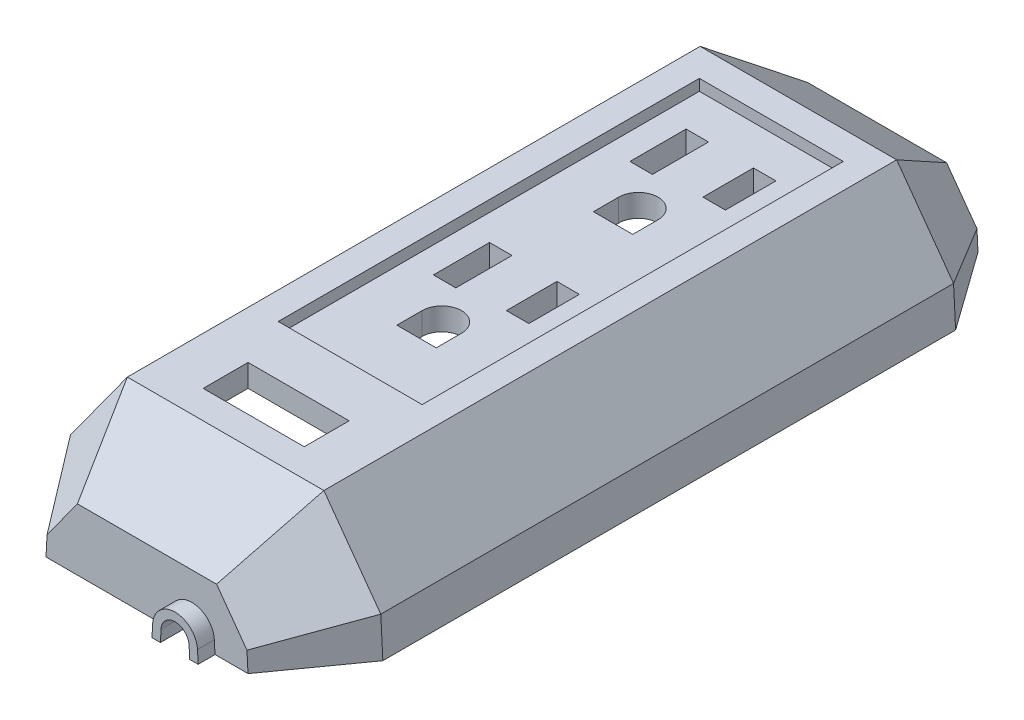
ISO-10303-21;
HEADER;
FILE_DESCRIPTION(('STEP AP214'),'2;1');
FILE_NAME('part.step','',(''),(''),'','','');
FILE_SCHEMA(('AUTOMOTIVE_DESIGN { 1 0 10303 214 1 1 1 1 }'));
ENDSEC;
DATA;
#1=APPLICATION_CONTEXT('core data for automotive mechanical design processes');
#2=APPLICATION_PROTOCOL_DEFINITION('international standard','automotive_design',2000,#1);
#3=PRODUCT_CONTEXT('',#1,'mechanical');
#4=PRODUCT('Part','Part','',(#3));
#5=PRODUCT_RELATED_PRODUCT_CATEGORY('part','',(#4));
#6=PRODUCT_DEFINITION_FORMATION('','',#4);
#7=PRODUCT_DEFINITION_CONTEXT('part definition',#1,'design');
#8=PRODUCT_DEFINITION('design','',#6,#7);
#9=PRODUCT_DEFINITION_SHAPE('','',#8);
#10=(LENGTH_UNIT() NAMED_UNIT(*) SI_UNIT(.MILLI.,.METRE.));
#11=(NAMED_UNIT(*) PLANE_ANGLE_UNIT() SI_UNIT($,.RADIAN.));
#12=(NAMED_UNIT(*) SI_UNIT($,.STERADIAN.) SOLID_ANGLE_UNIT());
#13=UNCERTAINTY_MEASURE_WITH_UNIT(LENGTH_MEASURE(1.E-05),#10,'distance_accuracy_value','');
#14=(GEOMETRIC_REPRESENTATION_CONTEXT(3) GLOBAL_UNCERTAINTY_ASSIGNED_CONTEXT((#13)) GLOBAL_UNIT_ASSIGNED_CONTEXT((#10,
#11,#12)) REPRESENTATION_CONTEXT('',''));
#15=CARTESIAN_POINT('',(0.,0.,0.));
#16=DIRECTION('',(0.,0.,1.));
#17=DIRECTION('',(1.,0.,0.));
#18=AXIS2_PLACEMENT_3D('',#15,#16,#17);
#19=CARTESIAN_POINT('',(27.6331455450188,7.,130.));
#20=DIRECTION('',(-0.998629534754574,-0.0523359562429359,0.));
#21=DIRECTION('',(0.052335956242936,-0.998629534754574,0.));
#22=AXIS2_PLACEMENT_3D('',#19,#20,#21);
#23=PLANE('',#22);
#24=DIRECTION('',(0.,0.,-1.));
#25=VECTOR('',#24,1.);
#26=CARTESIAN_POINT('',(28.,0.,130.));
#27=LINE('',#26,#25);
#28=CARTESIAN_POINT('',(28.,0.,116.));
#29=VERTEX_POINT('',#28);
#30=CARTESIAN_POINT('',(28.,0.,14.0000000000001));
#31=VERTEX_POINT('',#30);
#32=EDGE_CURVE('E1445',#29,#31,#27,.T.);
#33=ORIENTED_EDGE('',*,*,#32,.T.);
#34=DIRECTION('',(-0.052335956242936,0.998629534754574,0.));
#35=VECTOR('',#34,1.);
#36=CARTESIAN_POINT('',(27.6331455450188,7.,14.0000000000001));
#37=LINE('',#36,#35);
#38=CARTESIAN_POINT('',(27.6331455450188,7.,14.0000000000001));
#39=VERTEX_POINT('',#38);
#40=EDGE_CURVE('E1257',#31,#39,#37,.T.);
#41=ORIENTED_EDGE('',*,*,#40,.T.);
#42=DIRECTION('',(0.,0.,-1.));
#43=VECTOR('',#42,1.);
#44=CARTESIAN_POINT('',(27.6331455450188,7.,130.));
#45=LINE('',#44,#43);
#46=CARTESIAN_POINT('',(27.6331455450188,7.,116.));
#47=VERTEX_POINT('',#46);
#48=EDGE_CURVE('E1466',#47,#39,#45,.T.);
#49=ORIENTED_EDGE('',*,*,#48,.F.);
#50=DIRECTION('',(0.052335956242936,-0.998629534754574,0.));
#51=VECTOR('',#50,1.);
#52=CARTESIAN_POINT('',(28.,0.,116.));
#53=LINE('',#52,#51);
#54=EDGE_CURVE('E1480',#47,#29,#53,.T.);
#55=ORIENTED_EDGE('',*,*,#54,.T.);
#56=EDGE_LOOP('',(#33,#41,#49,#55));
#57=FACE_BOUND('',#56,.T.);
#58=ADVANCED_FACE('F40',(#57),#23,.F.);
#59=CARTESIAN_POINT('',(17.5,21.,130.));
#60=DIRECTION('',(-0.810073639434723,-0.586328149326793,0.));
#61=DIRECTION('',(0.586328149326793,-0.810073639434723,0.));
#62=AXIS2_PLACEMENT_3D('',#59,#60,#61);
#63=PLANE('',#62);
#64=ORIENTED_EDGE('',*,*,#48,.T.);
#65=DIRECTION('',(-0.586328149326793,0.810073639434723,0.));
#66=VECTOR('',#65,1.);
#67=CARTESIAN_POINT('',(17.5,21.,14.0000000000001));
#68=LINE('',#67,#66);
#69=CARTESIAN_POINT('',(17.5,21.,14.0000000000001));
#70=VERTEX_POINT('',#69);
#71=EDGE_CURVE('E1433',#39,#70,#68,.T.);
#72=ORIENTED_EDGE('',*,*,#71,.T.);
#73=DIRECTION('',(0.,0.,-1.));
#74=VECTOR('',#73,1.);
#75=CARTESIAN_POINT('',(17.5,21.,130.));
#76=LINE('',#75,#74);
#77=CARTESIAN_POINT('',(17.5,21.,116.));
#78=VERTEX_POINT('',#77);
#79=EDGE_CURVE('E1463',#78,#70,#76,.T.);
#80=ORIENTED_EDGE('',*,*,#79,.F.);
#81=DIRECTION('',(0.586328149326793,-0.810073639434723,0.));
#82=VECTOR('',#81,1.);
#83=CARTESIAN_POINT('',(27.6331455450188,7.,116.));
#84=LINE('',#83,#82);
#85=EDGE_CURVE('E1487',#78,#47,#84,.T.);
#86=ORIENTED_EDGE('',*,*,#85,.T.);
#87=EDGE_LOOP('',(#64,#72,#80,#86));
#88=FACE_BOUND('',#87,.T.);
#89=ADVANCED_FACE('F1374',(#88),#63,.F.);
#90=CARTESIAN_POINT('',(-17.5,21.,130.));
#91=DIRECTION('',(0.,-1.,0.));
#92=DIRECTION('',(0.,0.,-1.));
#93=AXIS2_PLACEMENT_3D('',#90,#91,#92);
#94=PLANE('',#93);
#95=DIRECTION('',(0.,0.,1.));
#96=VECTOR('',#95,1.);
#97=CARTESIAN_POINT('',(9.,21.,130.));
#98=LINE('',#97,#96);
#99=CARTESIAN_POINT('',(9.,21.,103.));
#100=VERTEX_POINT('',#99);
#101=CARTESIAN_POINT('',(9.,21.,111.));
#102=VERTEX_POINT('',#101);
#103=EDGE_CURVE('E48',#100,#102,#98,.T.);
#104=ORIENTED_EDGE('',*,*,#103,.T.);
#105=DIRECTION('',(-1.,0.,0.));
#106=VECTOR('',#105,1.);
#107=CARTESIAN_POINT('',(-17.5,21.,111.));
#108=LINE('',#107,#106);
#109=CARTESIAN_POINT('',(-9.,21.,111.));
#110=VERTEX_POINT('',#109);
#111=EDGE_CURVE('E13',#102,#110,#108,.T.);
#112=ORIENTED_EDGE('',*,*,#111,.T.);
#113=DIRECTION('',(0.,0.,-1.));
#114=VECTOR('',#113,1.);
#115=CARTESIAN_POINT('',(-9.,21.,130.));
#116=LINE('',#115,#114);
#117=CARTESIAN_POINT('',(-9.,21.,103.));
#118=VERTEX_POINT('',#117);
#119=EDGE_CURVE('E1338',#110,#118,#116,.T.);
#120=ORIENTED_EDGE('',*,*,#119,.T.);
#121=DIRECTION('',(1.,0.,0.));
#122=VECTOR('',#121,1.);
#123=CARTESIAN_POINT('',(-17.5,21.,103.));
#124=LINE('',#123,#122);
#125=EDGE_CURVE('E1341',#118,#100,#124,.T.);
#126=ORIENTED_EDGE('',*,*,#125,.T.);
#127=EDGE_LOOP('',(#104,#112,#120,#126));
#128=FACE_BOUND('',#127,.T.);
#129=DIRECTION('',(0.,0.,-1.));
#130=VECTOR('',#129,1.);
#131=CARTESIAN_POINT('',(-12.6331455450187,21.,130.));
#132=LINE('',#131,#130);
#133=CARTESIAN_POINT('',(-12.6331455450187,21.,94.0000000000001));
#134=VERTEX_POINT('',#133);
#135=CARTESIAN_POINT('',(-12.6331455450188,21.,19.0000000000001));
#136=VERTEX_POINT('',#135);
#137=EDGE_CURVE('E1260',#134,#136,#132,.T.);
#138=ORIENTED_EDGE('',*,*,#137,.T.);
#139=DIRECTION('',(1.,0.,0.));
#140=VECTOR('',#139,1.);
#141=CARTESIAN_POINT('',(-17.5,21.,19.0000000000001));
#142=LINE('',#141,#140);
#143=CARTESIAN_POINT('',(13.,21.,19.0000000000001));
#144=VERTEX_POINT('',#143);
#145=EDGE_CURVE('E1263',#136,#144,#142,.T.);
#146=ORIENTED_EDGE('',*,*,#145,.T.);
#147=DIRECTION('',(0.,0.,1.));
#148=VECTOR('',#147,1.);
#149=CARTESIAN_POINT('',(13.,21.,130.));
#150=LINE('',#149,#148);
#151=CARTESIAN_POINT('',(13.,21.,94.0000000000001));
#152=VERTEX_POINT('',#151);
#153=EDGE_CURVE('E1253',#144,#152,#150,.T.);
#154=ORIENTED_EDGE('',*,*,#153,.T.);
#155=DIRECTION('',(-1.,0.,0.));
#156=VECTOR('',#155,1.);
#157=CARTESIAN_POINT('',(-17.5,21.,94.0000000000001));
#158=LINE('',#157,#156);
#159=EDGE_CURVE('E1256',#152,#134,#158,.T.);
#160=ORIENTED_EDGE('',*,*,#159,.T.);
#161=EDGE_LOOP('',(#138,#146,#154,#160));
#162=FACE_BOUND('',#161,.T.);
#163=ORIENTED_EDGE('',*,*,#79,.T.);
#164=DIRECTION('',(-1.,0.,0.));
#165=VECTOR('',#164,1.);
#166=CARTESIAN_POINT('',(-17.5,21.,14.0000000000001));
#167=LINE('',#166,#165);
#168=CARTESIAN_POINT('',(-17.5,21.,14.0000000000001));
#169=VERTEX_POINT('',#168);
#170=EDGE_CURVE('E1520',#70,#169,#167,.T.);
#171=ORIENTED_EDGE('',*,*,#170,.T.);
#172=DIRECTION('',(0.,0.,-1.));
#173=VECTOR('',#172,1.);
#174=CARTESIAN_POINT('',(-17.5,21.,130.));
#175=LINE('',#174,#173);
#176=CARTESIAN_POINT('',(-17.5,21.,116.));
#177=VERTEX_POINT('',#176);
#178=EDGE_CURVE('E1460',#177,#169,#175,.T.);
#179=ORIENTED_EDGE('',*,*,#178,.F.);
#180=DIRECTION('',(1.,0.,0.));
#181=VECTOR('',#180,1.);
#182=CARTESIAN_POINT('',(17.5,21.,116.));
#183=LINE('',#182,#181);
#184=EDGE_CURVE('E1489',#177,#78,#183,.T.);
#185=ORIENTED_EDGE('',*,*,#184,.T.);
#186=EDGE_LOOP('',(#163,#171,#179,#185));
#187=FACE_BOUND('',#186,.T.);
#188=ADVANCED_FACE('F1345',(#128,#162,#187),#94,.F.);
#189=CARTESIAN_POINT('',(-27.6331455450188,7.,130.));
#190=DIRECTION('',(0.810073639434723,-0.586328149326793,0.));
#191=DIRECTION('',(0.586328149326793,0.810073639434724,0.));
#192=AXIS2_PLACEMENT_3D('',#189,#190,#191);
#193=PLANE('',#192);
#194=ORIENTED_EDGE('',*,*,#178,.T.);
#195=DIRECTION('',(-0.586328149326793,-0.810073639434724,0.));
#196=VECTOR('',#195,1.);
#197=CARTESIAN_POINT('',(-27.6331455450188,7.,14.0000000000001));
#198=LINE('',#197,#196);
#199=CARTESIAN_POINT('',(-27.6331455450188,7.,14.0000000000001));
#200=VERTEX_POINT('',#199);
#201=EDGE_CURVE('E1518',#169,#200,#198,.T.);
#202=ORIENTED_EDGE('',*,*,#201,.T.);
#203=DIRECTION('',(0.,0.,-1.));
#204=VECTOR('',#203,1.);
#205=CARTESIAN_POINT('',(-27.6331455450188,7.,130.));
#206=LINE('',#205,#204);
#207=CARTESIAN_POINT('',(-27.6331455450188,7.,116.));
#208=VERTEX_POINT('',#207);
#209=EDGE_CURVE('E1457',#208,#200,#206,.T.);
#210=ORIENTED_EDGE('',*,*,#209,.F.);
#211=DIRECTION('',(0.586328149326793,0.810073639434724,0.));
#212=VECTOR('',#211,1.);
#213=CARTESIAN_POINT('',(-17.5,21.,116.));
#214=LINE('',#213,#212);
#215=EDGE_CURVE('E1491',#208,#177,#214,.T.);
#216=ORIENTED_EDGE('',*,*,#215,.T.);
#217=EDGE_LOOP('',(#194,#202,#210,#216));
#218=FACE_BOUND('',#217,.T.);
#219=ADVANCED_FACE('F1551',(#218),#193,.F.);
#220=CARTESIAN_POINT('',(-27.6331455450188,7.,130.));
#221=DIRECTION('',(0.998629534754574,-0.0523359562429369,0.));
#222=DIRECTION('',(0.0523359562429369,0.998629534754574,0.));
#223=AXIS2_PLACEMENT_3D('',#220,#221,#222);
#224=PLANE('',#223);
#225=ORIENTED_EDGE('',*,*,#209,.T.);
#226=DIRECTION('',(-0.0523359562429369,-0.998629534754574,0.));
#227=VECTOR('',#226,1.);
#228=CARTESIAN_POINT('',(-27.6331455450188,7.,14.0000000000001));
#229=LINE('',#228,#227);
#230=CARTESIAN_POINT('',(-28.,0.,14.0000000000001));
#231=VERTEX_POINT('',#230);
#232=EDGE_CURVE('E1494',#200,#231,#229,.T.);
#233=ORIENTED_EDGE('',*,*,#232,.T.);
#234=DIRECTION('',(0.,0.,-1.));
#235=VECTOR('',#234,1.);
#236=CARTESIAN_POINT('',(-28.,0.,130.));
#237=LINE('',#236,#235);
#238=CARTESIAN_POINT('',(-28.,0.,116.));
#239=VERTEX_POINT('',#238);
#240=EDGE_CURVE('E1454',#239,#231,#237,.T.);
#241=ORIENTED_EDGE('',*,*,#240,.F.);
#242=DIRECTION('',(0.0523359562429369,0.998629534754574,0.));
#243=VECTOR('',#242,1.);
#244=CARTESIAN_POINT('',(-27.6331455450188,7.,116.));
#245=LINE('',#244,#243);
#246=EDGE_CURVE('E1493',#239,#208,#245,.T.);
#247=ORIENTED_EDGE('',*,*,#246,.T.);
#248=EDGE_LOOP('',(#225,#233,#241,#247));
#249=FACE_BOUND('',#248,.T.);
#250=ADVANCED_FACE('F1539',(#249),#224,.F.);
#251=CARTESIAN_POINT('',(-28.,0.,130.));
#252=DIRECTION('',(0.,1.,0.));
#253=DIRECTION('',(0.,0.,1.));
#254=AXIS2_PLACEMENT_3D('',#251,#252,#253);
#255=PLANE('',#254);
#256=DIRECTION('',(1.,0.,0.));
#257=VECTOR('',#256,1.);
#258=CARTESIAN_POINT('',(3.88969505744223,0.,132.999999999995));
#259=LINE('',#258,#257);
#260=CARTESIAN_POINT('',(10.6082464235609,0.,132.999999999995));
#261=VERTEX_POINT('',#260);
#262=CARTESIAN_POINT('',(12.1103049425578,0.,132.999999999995));
#263=VERTEX_POINT('',#262);
#264=EDGE_CURVE('E1218',#261,#263,#259,.T.);
#265=ORIENTED_EDGE('',*,*,#264,.F.);
#266=DIRECTION('',(0.,0.,-1.));
#267=VECTOR('',#266,1.);
#268=CARTESIAN_POINT('',(10.6082464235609,0.,132.999999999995));
#269=LINE('',#268,#267);
#270=CARTESIAN_POINT('',(10.6082464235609,0.,128.5));
#271=VERTEX_POINT('',#270);
#272=EDGE_CURVE('E55',#261,#271,#269,.T.);
#273=ORIENTED_EDGE('',*,*,#272,.T.);
#274=DIRECTION('',(1.,0.,0.));
#275=VECTOR('',#274,1.);
#276=CARTESIAN_POINT('',(-28.,0.,128.5));
#277=LINE('',#276,#275);
#278=CARTESIAN_POINT('',(17.2132903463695,0.,128.5));
#279=VERTEX_POINT('',#278);
#280=EDGE_CURVE('E982',#271,#279,#277,.T.);
#281=ORIENTED_EDGE('',*,*,#280,.T.);
#282=DIRECTION('',(-0.581766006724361,0.,0.813356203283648));
#283=VECTOR('',#282,1.);
#284=CARTESIAN_POINT('',(16.7744174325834,0.,129.113580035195));
#285=LINE('',#284,#283);
#286=CARTESIAN_POINT('',(26.4979414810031,0.,115.519302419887));
#287=VERTEX_POINT('',#286);
#288=EDGE_CURVE('E683',#287,#279,#285,.T.);
#289=ORIENTED_EDGE('',*,*,#288,.F.);
#290=DIRECTION('',(0.,0.,-1.));
#291=VECTOR('',#290,1.);
#292=CARTESIAN_POINT('',(26.4979414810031,0.,130.));
#293=LINE('',#292,#291);
#294=CARTESIAN_POINT('',(26.4979414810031,0.,14.4806975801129));
#295=VERTEX_POINT('',#294);
#296=EDGE_CURVE('E977',#287,#295,#293,.T.);
#297=ORIENTED_EDGE('',*,*,#296,.T.);
#298=DIRECTION('',(-0.581766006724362,0.,-0.813356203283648));
#299=VECTOR('',#298,1.);
#300=CARTESIAN_POINT('',(26.654695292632,0.,14.699852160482));
#301=LINE('',#300,#299);
#302=CARTESIAN_POINT('',(17.2132903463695,0.,1.5));
#303=VERTEX_POINT('',#302);
#304=EDGE_CURVE('E640',#303,#295,#301,.F.);
#305=ORIENTED_EDGE('',*,*,#304,.F.);
#306=DIRECTION('',(1.,0.,0.));
#307=VECTOR('',#306,1.);
#308=CARTESIAN_POINT('',(-28.,0.,1.5));
#309=LINE('',#308,#307);
#310=CARTESIAN_POINT('',(-17.2132903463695,0.,1.5));
#311=VERTEX_POINT('',#310);
#312=EDGE_CURVE('E730',#311,#303,#309,.T.);
#313=ORIENTED_EDGE('',*,*,#312,.F.);
#314=DIRECTION('',(-0.581766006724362,0.,0.813356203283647));
#315=VECTOR('',#314,1.);
#316=CARTESIAN_POINT('',(-26.654695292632,0.,14.699852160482));
#317=LINE('',#316,#315);
#318=CARTESIAN_POINT('',(-26.4979414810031,0.,14.4806975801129));
#319=VERTEX_POINT('',#318);
#320=EDGE_CURVE('E777',#319,#311,#317,.F.);
#321=ORIENTED_EDGE('',*,*,#320,.F.);
#322=DIRECTION('',(0.,0.,-1.));
#323=VECTOR('',#322,1.);
#324=CARTESIAN_POINT('',(-26.4979414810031,0.,130.));
#325=LINE('',#324,#323);
#326=CARTESIAN_POINT('',(-26.4979414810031,0.,115.519302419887));
#327=VERTEX_POINT('',#326);
#328=EDGE_CURVE('E719',#327,#319,#325,.T.);
#329=ORIENTED_EDGE('',*,*,#328,.F.);
#330=DIRECTION('',(-0.581766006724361,0.,-0.813356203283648));
#331=VECTOR('',#330,1.);
#332=CARTESIAN_POINT('',(-16.7225033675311,0.,129.186160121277));
#333=LINE('',#332,#331);
#334=CARTESIAN_POINT('',(-17.2132903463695,0.,128.5));
#335=VERTEX_POINT('',#334);
#336=EDGE_CURVE('E981',#335,#327,#333,.T.);
#337=ORIENTED_EDGE('',*,*,#336,.F.);
#338=DIRECTION('',(1.,0.,0.));
#339=VECTOR('',#338,1.);
#340=CARTESIAN_POINT('',(-28.,0.,128.5));
#341=LINE('',#340,#339);
#342=CARTESIAN_POINT('',(5.39175357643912,0.,128.5));
#343=VERTEX_POINT('',#342);
#344=EDGE_CURVE('E979',#335,#343,#341,.T.);
#345=ORIENTED_EDGE('',*,*,#344,.T.);
#346=DIRECTION('',(0.,0.,-1.));
#347=VECTOR('',#346,1.);
#348=CARTESIAN_POINT('',(5.39175357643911,0.,130.));
#349=LINE('',#348,#347);
#350=CARTESIAN_POINT('',(5.39175357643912,0.,132.999999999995));
#351=VERTEX_POINT('',#350);
#352=EDGE_CURVE('E760',#351,#343,#349,.T.);
#353=ORIENTED_EDGE('',*,*,#352,.F.);
#354=CARTESIAN_POINT('',(3.88969505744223,0.,132.999999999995));
#355=VERTEX_POINT('',#354);
#356=EDGE_CURVE('E1219',#355,#351,#259,.T.);
#357=ORIENTED_EDGE('',*,*,#356,.F.);
#358=DIRECTION('',(0.,0.,-1.));
#359=VECTOR('',#358,1.);
#360=CARTESIAN_POINT('',(3.88969505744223,0.,132.999999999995));
#361=LINE('',#360,#359);
#362=CARTESIAN_POINT('',(3.88969505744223,0.,129.999999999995));
#363=VERTEX_POINT('',#362);
#364=EDGE_CURVE('E1238',#355,#363,#361,.T.);
#365=ORIENTED_EDGE('',*,*,#364,.T.);
#366=DIRECTION('',(1.,0.,0.));
#367=VECTOR('',#366,1.);
#368=CARTESIAN_POINT('',(-28.,0.,130.));
#369=LINE('',#368,#367);
#370=CARTESIAN_POINT('',(-17.9862765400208,0.,130.));
#371=VERTEX_POINT('',#370);
#372=EDGE_CURVE('E1444',#371,#363,#369,.T.);
#373=ORIENTED_EDGE('',*,*,#372,.F.);
#374=DIRECTION('',(-0.581766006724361,0.,-0.813356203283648));
#375=VECTOR('',#374,1.);
#376=CARTESIAN_POINT('',(-17.9436455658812,0.,130.05960156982));
#377=LINE('',#376,#375);
#378=EDGE_CURVE('E1482',#371,#239,#377,.T.);
#379=ORIENTED_EDGE('',*,*,#378,.T.);
#380=ORIENTED_EDGE('',*,*,#240,.T.);
#381=DIRECTION('',(-0.581766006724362,0.,0.813356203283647));
#382=VECTOR('',#381,1.);
#383=CARTESIAN_POINT('',(-27.8758374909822,0.,13.8264107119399));
#384=LINE('',#383,#382);
#385=CARTESIAN_POINT('',(-17.9862765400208,0.,0.));
#386=VERTEX_POINT('',#385);
#387=EDGE_CURVE('E1507',#231,#386,#384,.F.);
#388=ORIENTED_EDGE('',*,*,#387,.T.);
#389=DIRECTION('',(1.,0.,0.));
#390=VECTOR('',#389,1.);
#391=CARTESIAN_POINT('',(-28.,0.,0.));
#392=LINE('',#391,#390);
#393=CARTESIAN_POINT('',(17.9862765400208,0.,0.));
#394=VERTEX_POINT('',#393);
#395=EDGE_CURVE('E1448',#386,#394,#392,.T.);
#396=ORIENTED_EDGE('',*,*,#395,.T.);
#397=DIRECTION('',(-0.581766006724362,0.,-0.813356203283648));
#398=VECTOR('',#397,1.);
#399=CARTESIAN_POINT('',(27.8758374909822,0.,13.8264107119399));
#400=LINE('',#399,#398);
#401=EDGE_CURVE('E1505',#394,#31,#400,.F.);
#402=ORIENTED_EDGE('',*,*,#401,.T.);
#403=ORIENTED_EDGE('',*,*,#32,.F.);
#404=DIRECTION('',(-0.581766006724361,0.,0.813356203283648));
#405=VECTOR('',#404,1.);
#406=CARTESIAN_POINT('',(17.9955596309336,0.,129.987021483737));
#407=LINE('',#406,#405);
#408=CARTESIAN_POINT('',(17.9862765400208,0.,130.));
#409=VERTEX_POINT('',#408);
#410=EDGE_CURVE('E1484',#29,#409,#407,.T.);
#411=ORIENTED_EDGE('',*,*,#410,.T.);
#412=CARTESIAN_POINT('',(12.1103049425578,0.,130.));
#413=VERTEX_POINT('',#412);
#414=EDGE_CURVE('E1235',#413,#409,#369,.T.);
#415=ORIENTED_EDGE('',*,*,#414,.F.);
#416=DIRECTION('',(0.,0.,-1.));
#417=VECTOR('',#416,1.);
#418=CARTESIAN_POINT('',(12.1103049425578,0.,132.999999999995));
#419=LINE('',#418,#417);
#420=EDGE_CURVE('E1242',#263,#413,#419,.T.);
#421=ORIENTED_EDGE('',*,*,#420,.F.);
#422=EDGE_LOOP('',(#265,#273,#281,#289,#297,#305,#313,#321,#329,#337,#345,#353,#357,#365,#373,
#379,#380,#388,#396,#402,#403,#411,#415,#421));
#423=FACE_BOUND('',#422,.T.);
#424=ADVANCED_FACE('F1544',(#423),#255,.F.);
#425=CARTESIAN_POINT('',(28.,0.,130.));
#426=DIRECTION('',(0.,0.,1.));
#427=DIRECTION('',(1.,0.,0.));
#428=AXIS2_PLACEMENT_3D('',#425,#426,#427);
#429=PLANE('',#428);
#430=DIRECTION('',(-0.0523359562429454,0.998629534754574,0.));
#431=VECTOR('',#430,1.);
#432=CARTESIAN_POINT('',(12.1103049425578,0.,129.999999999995));
#433=LINE('',#432,#431);
#434=CARTESIAN_POINT('',(11.9945181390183,2.20934382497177,129.999999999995));
#435=VERTEX_POINT('',#434);
#436=EDGE_CURVE('E1216',#413,#435,#433,.T.);
#437=ORIENTED_EDGE('',*,*,#436,.F.);
#438=ORIENTED_EDGE('',*,*,#414,.T.);
#439=DIRECTION('',(-0.0523359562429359,0.998629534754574,0.));
#440=VECTOR('',#439,1.);
#441=CARTESIAN_POINT('',(17.646850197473,6.47664043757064,130.));
#442=LINE('',#441,#440);
#443=CARTESIAN_POINT('',(17.8013641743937,3.52833812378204,130.));
#444=VERTEX_POINT('',#443);
#445=EDGE_CURVE('E1477',#409,#444,#442,.T.);
#446=ORIENTED_EDGE('',*,*,#445,.T.);
#447=DIRECTION('',(-0.586328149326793,0.810073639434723,0.));
#448=VECTOR('',#447,1.);
#449=CARTESIAN_POINT('',(9.39926360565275,15.1367185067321,130.));
#450=LINE('',#449,#448);
#451=CARTESIAN_POINT('',(12.3934043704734,11.,130.));
#452=VERTEX_POINT('',#451);
#453=EDGE_CURVE('E1475',#444,#452,#450,.T.);
#454=ORIENTED_EDGE('',*,*,#453,.T.);
#455=DIRECTION('',(-1.,0.,0.));
#456=VECTOR('',#455,1.);
#457=CARTESIAN_POINT('',(-17.5,11.,130.));
#458=LINE('',#457,#456);
#459=CARTESIAN_POINT('',(-12.3934043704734,11.,130.));
#460=VERTEX_POINT('',#459);
#461=EDGE_CURVE('E1473',#452,#460,#458,.T.);
#462=ORIENTED_EDGE('',*,*,#461,.T.);
#463=DIRECTION('',(-0.586328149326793,-0.810073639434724,0.));
#464=VECTOR('',#463,1.);
#465=CARTESIAN_POINT('',(-19.5324091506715,1.13671850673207,130.));
#466=LINE('',#465,#464);
#467=CARTESIAN_POINT('',(-17.8013641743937,3.52833812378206,130.));
#468=VERTEX_POINT('',#467);
#469=EDGE_CURVE('E1471',#460,#468,#466,.T.);
#470=ORIENTED_EDGE('',*,*,#469,.T.);
#471=DIRECTION('',(-0.0523359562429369,-0.998629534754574,0.));
#472=VECTOR('',#471,1.);
#473=CARTESIAN_POINT('',(-18.0137046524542,-0.52335956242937,130.));
#474=LINE('',#473,#472);
#475=EDGE_CURVE('E1469',#468,#371,#474,.T.);
#476=ORIENTED_EDGE('',*,*,#475,.T.);
#477=ORIENTED_EDGE('',*,*,#372,.T.);
#478=DIRECTION('',(-0.0523359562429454,-0.998629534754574,0.));
#479=VECTOR('',#478,1.);
#480=CARTESIAN_POINT('',(3.88969505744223,0.,129.999999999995));
#481=LINE('',#480,#479);
#482=CARTESIAN_POINT('',(4.00548186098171,2.20934382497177,129.999999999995));
#483=VERTEX_POINT('',#482);
#484=EDGE_CURVE('E1227',#483,#363,#481,.T.);
#485=ORIENTED_EDGE('',*,*,#484,.F.);
#486=CARTESIAN_POINT('',(8.,2.,129.999999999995));
#487=DIRECTION('',(0.,0.,1.));
#488=DIRECTION('',(1.,0.,0.));
#489=AXIS2_PLACEMENT_3D('',#486,#487,#488);
#490=CIRCLE('',#489,4.);
#491=EDGE_CURVE('E1211',#435,#483,#490,.T.);
#492=ORIENTED_EDGE('',*,*,#491,.F.);
#493=EDGE_LOOP('',(#437,#438,#446,#454,#462,#470,#476,#477,#485,#492));
#494=FACE_BOUND('',#493,.T.);
#495=ADVANCED_FACE('F1624',(#494),#429,.T.);
#496=CARTESIAN_POINT('',(28.,0.,0.));
#497=DIRECTION('',(0.,0.,1.));
#498=DIRECTION('',(1.,0.,0.));
#499=AXIS2_PLACEMENT_3D('',#496,#497,#498);
#500=PLANE('',#499);
#501=ORIENTED_EDGE('',*,*,#395,.F.);
#502=DIRECTION('',(0.0523359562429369,0.998629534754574,0.));
#503=VECTOR('',#502,1.);
#504=CARTESIAN_POINT('',(-17.8603177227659,2.40343740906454,0.));
#505=LINE('',#504,#503);
#506=CARTESIAN_POINT('',(-17.8013641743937,3.52833812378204,0.));
#507=VERTEX_POINT('',#506);
#508=EDGE_CURVE('E1516',#386,#507,#505,.T.);
#509=ORIENTED_EDGE('',*,*,#508,.T.);
#510=DIRECTION('',(0.586328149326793,0.810073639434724,0.));
#511=VECTOR('',#510,1.);
#512=CARTESIAN_POINT('',(-3.73159034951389,22.9672016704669,0.));
#513=LINE('',#512,#511);
#514=CARTESIAN_POINT('',(-12.3934043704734,11.,0.));
#515=VERTEX_POINT('',#514);
#516=EDGE_CURVE('E1514',#507,#515,#513,.T.);
#517=ORIENTED_EDGE('',*,*,#516,.T.);
#518=DIRECTION('',(1.,0.,0.));
#519=VECTOR('',#518,1.);
#520=CARTESIAN_POINT('',(28.,11.,0.));
#521=LINE('',#520,#519);
#522=CARTESIAN_POINT('',(12.3934043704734,11.,0.));
#523=VERTEX_POINT('',#522);
#524=EDGE_CURVE('E1512',#515,#523,#521,.T.);
#525=ORIENTED_EDGE('',*,*,#524,.T.);
#526=DIRECTION('',(0.586328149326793,-0.810073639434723,0.));
#527=VECTOR('',#526,1.);
#528=CARTESIAN_POINT('',(22.9833094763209,-3.63106108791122,0.));
#529=LINE('',#528,#527);
#530=CARTESIAN_POINT('',(17.8013641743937,3.52833812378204,0.));
#531=VERTEX_POINT('',#530);
#532=EDGE_CURVE('E1431',#523,#531,#529,.T.);
#533=ORIENTED_EDGE('',*,*,#532,.T.);
#534=DIRECTION('',(0.0523359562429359,-0.998629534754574,0.));
#535=VECTOR('',#534,1.);
#536=CARTESIAN_POINT('',(18.0137046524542,-0.523359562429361,0.));
#537=LINE('',#536,#535);
#538=EDGE_CURVE('E1509',#531,#394,#537,.T.);
#539=ORIENTED_EDGE('',*,*,#538,.T.);
#540=EDGE_LOOP('',(#501,#509,#517,#525,#533,#539));
#541=FACE_BOUND('',#540,.T.);
#542=ADVANCED_FACE('F1404',(#541),#500,.F.);
#543=CARTESIAN_POINT('',(-17.8603177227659,2.40343740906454,130.));
#544=DIRECTION('',(-0.812618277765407,0.0425875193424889,0.581238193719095));
#545=DIRECTION('',(0.581766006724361,0.,0.813356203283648));
#546=AXIS2_PLACEMENT_3D('',#543,#544,#545);
#547=PLANE('',#546);
#548=ORIENTED_EDGE('',*,*,#378,.F.);
#549=ORIENTED_EDGE('',*,*,#475,.F.);
#550=DIRECTION('',(-0.563228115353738,0.198879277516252,-0.802010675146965));
#551=VECTOR('',#550,1.);
#552=CARTESIAN_POINT('',(-17.6940606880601,3.49044860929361,130.15279518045));
#553=LINE('',#552,#551);
#554=EDGE_CURVE('E1452',#208,#468,#553,.F.);
#555=ORIENTED_EDGE('',*,*,#554,.F.);
#556=ORIENTED_EDGE('',*,*,#246,.F.);
#557=EDGE_LOOP('',(#548,#549,#555,#556));
#558=FACE_BOUND('',#557,.T.);
#559=ADVANCED_FACE('F1400',(#558),#547,.T.);
#560=CARTESIAN_POINT('',(-3.73159034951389,22.9672016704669,130.));
#561=DIRECTION('',(-0.659184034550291,0.477114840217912,0.581238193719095));
#562=DIRECTION('',(0.661369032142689,0.,0.750060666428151));
#563=AXIS2_PLACEMENT_3D('',#560,#561,#562);
#564=PLANE('',#563);
#565=ORIENTED_EDGE('',*,*,#554,.T.);
#566=ORIENTED_EDGE('',*,*,#469,.F.);
#567=DIRECTION('',(-0.284545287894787,0.557211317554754,-0.780095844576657));
#568=VECTOR('',#567,1.);
#569=CARTESIAN_POINT('',(-13.5895137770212,13.3422833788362,126.720803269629));
#570=LINE('',#569,#568);
#571=EDGE_CURVE('E1498',#177,#460,#570,.F.);
#572=ORIENTED_EDGE('',*,*,#571,.F.);
#573=ORIENTED_EDGE('',*,*,#215,.F.);
#574=EDGE_LOOP('',(#565,#566,#572,#573));
#575=FACE_BOUND('',#574,.T.);
#576=ADVANCED_FACE('F1396',(#575),#564,.T.);
#577=CARTESIAN_POINT('',(28.,11.,130.));
#578=DIRECTION('',(0.,0.813733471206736,0.581238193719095));
#579=DIRECTION('',(0.,-0.581238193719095,0.813733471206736));
#580=AXIS2_PLACEMENT_3D('',#577,#578,#579);
#581=PLANE('',#580);
#582=ORIENTED_EDGE('',*,*,#571,.T.);
#583=ORIENTED_EDGE('',*,*,#461,.F.);
#584=DIRECTION('',(0.284545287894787,0.557211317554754,-0.780095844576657));
#585=VECTOR('',#584,1.);
#586=CARTESIAN_POINT('',(13.657008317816,13.4744546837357,126.53576344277));
#587=LINE('',#586,#585);
#588=EDGE_CURVE('E1439',#78,#452,#587,.F.);
#589=ORIENTED_EDGE('',*,*,#588,.F.);
#590=ORIENTED_EDGE('',*,*,#184,.F.);
#591=EDGE_LOOP('',(#582,#583,#589,#590));
#592=FACE_BOUND('',#591,.T.);
#593=ADVANCED_FACE('F1392',(#592),#581,.T.);
#594=CARTESIAN_POINT('',(22.9833094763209,-3.63106108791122,130.));
#595=DIRECTION('',(0.659184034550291,0.477114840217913,0.581238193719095));
#596=DIRECTION('',(0.66136903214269,0.,-0.750060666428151));
#597=AXIS2_PLACEMENT_3D('',#594,#595,#596);
#598=PLANE('',#597);
#599=ORIENTED_EDGE('',*,*,#588,.T.);
#600=ORIENTED_EDGE('',*,*,#453,.F.);
#601=DIRECTION('',(0.563228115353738,0.198879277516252,-0.802010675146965));
#602=VECTOR('',#601,1.);
#603=CARTESIAN_POINT('',(18.6432556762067,3.82561514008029,128.801185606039));
#604=LINE('',#603,#602);
#605=EDGE_CURVE('E1436',#47,#444,#604,.F.);
#606=ORIENTED_EDGE('',*,*,#605,.F.);
#607=ORIENTED_EDGE('',*,*,#85,.F.);
#608=EDGE_LOOP('',(#599,#600,#606,#607));
#609=FACE_BOUND('',#608,.T.);
#610=ADVANCED_FACE('F1388',(#609),#598,.T.);
#611=CARTESIAN_POINT('',(18.0137046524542,-0.52335956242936,130.));
#612=DIRECTION('',(0.812618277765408,0.0425875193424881,0.581238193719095));
#613=DIRECTION('',(0.581766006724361,0.,-0.813356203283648));
#614=AXIS2_PLACEMENT_3D('',#611,#612,#613);
#615=PLANE('',#614);
#616=ORIENTED_EDGE('',*,*,#410,.F.);
#617=ORIENTED_EDGE('',*,*,#54,.F.);
#618=ORIENTED_EDGE('',*,*,#605,.T.);
#619=ORIENTED_EDGE('',*,*,#445,.F.);
#620=EDGE_LOOP('',(#616,#617,#618,#619));
#621=FACE_BOUND('',#620,.T.);
#622=ADVANCED_FACE('F1385',(#621),#615,.T.);
#623=CARTESIAN_POINT('',(27.6331455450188,7.,14.0000000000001));
#624=DIRECTION('',(-0.812618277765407,-0.0425875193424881,0.581238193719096));
#625=DIRECTION('',(0.581766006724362,0.,0.813356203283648));
#626=AXIS2_PLACEMENT_3D('',#623,#624,#625);
#627=PLANE('',#626);
#628=ORIENTED_EDGE('',*,*,#401,.F.);
#629=ORIENTED_EDGE('',*,*,#538,.F.);
#630=DIRECTION('',(0.563228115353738,0.198879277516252,0.802010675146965));
#631=VECTOR('',#630,1.);
#632=CARTESIAN_POINT('',(27.6331455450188,7.,14.0000000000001));
#633=LINE('',#632,#631);
#634=EDGE_CURVE('E1429',#39,#531,#633,.F.);
#635=ORIENTED_EDGE('',*,*,#634,.F.);
#636=ORIENTED_EDGE('',*,*,#40,.F.);
#637=EDGE_LOOP('',(#628,#629,#635,#636));
#638=FACE_BOUND('',#637,.T.);
#639=ADVANCED_FACE('F42',(#638),#627,.F.);
#640=CARTESIAN_POINT('',(17.5,21.,14.0000000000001));
#641=DIRECTION('',(-0.659184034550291,-0.477114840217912,0.581238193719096));
#642=DIRECTION('',(0.66136903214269,0.,0.750060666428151));
#643=AXIS2_PLACEMENT_3D('',#640,#641,#642);
#644=PLANE('',#643);
#645=ORIENTED_EDGE('',*,*,#634,.T.);
#646=ORIENTED_EDGE('',*,*,#532,.F.);
#647=DIRECTION('',(0.284545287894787,0.557211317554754,0.780095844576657));
#648=VECTOR('',#647,1.);
#649=CARTESIAN_POINT('',(17.5,21.,14.0000000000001));
#650=LINE('',#649,#648);
#651=EDGE_CURVE('E1437',#70,#523,#650,.F.);
#652=ORIENTED_EDGE('',*,*,#651,.F.);
#653=ORIENTED_EDGE('',*,*,#71,.F.);
#654=EDGE_LOOP('',(#645,#646,#652,#653));
#655=FACE_BOUND('',#654,.T.);
#656=ADVANCED_FACE('F1417',(#655),#644,.F.);
#657=CARTESIAN_POINT('',(-17.5,21.,14.0000000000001));
#658=DIRECTION('',(0.,-0.813733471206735,0.581238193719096));
#659=DIRECTION('',(0.,-0.581238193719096,-0.813733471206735));
#660=AXIS2_PLACEMENT_3D('',#657,#658,#659);
#661=PLANE('',#660);
#662=ORIENTED_EDGE('',*,*,#651,.T.);
#663=ORIENTED_EDGE('',*,*,#524,.F.);
#664=DIRECTION('',(-0.284545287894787,0.557211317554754,0.780095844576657));
#665=VECTOR('',#664,1.);
#666=CARTESIAN_POINT('',(-17.5,21.,14.0000000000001));
#667=LINE('',#666,#665);
#668=EDGE_CURVE('E1441',#169,#515,#667,.F.);
#669=ORIENTED_EDGE('',*,*,#668,.F.);
#670=ORIENTED_EDGE('',*,*,#170,.F.);
#671=EDGE_LOOP('',(#662,#663,#669,#670));
#672=FACE_BOUND('',#671,.T.);
#673=ADVANCED_FACE('F1414',(#672),#661,.F.);
#674=CARTESIAN_POINT('',(-27.6331455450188,7.,14.0000000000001));
#675=DIRECTION('',(0.659184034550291,-0.477114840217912,0.581238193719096));
#676=DIRECTION('',(0.66136903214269,0.,-0.750060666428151));
#677=AXIS2_PLACEMENT_3D('',#674,#675,#676);
#678=PLANE('',#677);
#679=ORIENTED_EDGE('',*,*,#668,.T.);
#680=ORIENTED_EDGE('',*,*,#516,.F.);
#681=DIRECTION('',(-0.563228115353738,0.198879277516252,0.802010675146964));
#682=VECTOR('',#681,1.);
#683=CARTESIAN_POINT('',(-27.6331455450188,7.,14.0000000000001));
#684=LINE('',#683,#682);
#685=EDGE_CURVE('E1524',#200,#507,#684,.F.);
#686=ORIENTED_EDGE('',*,*,#685,.F.);
#687=ORIENTED_EDGE('',*,*,#201,.F.);
#688=EDGE_LOOP('',(#679,#680,#686,#687));
#689=FACE_BOUND('',#688,.T.);
#690=ADVANCED_FACE('F1410',(#689),#678,.F.);
#691=CARTESIAN_POINT('',(-27.6331455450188,7.,14.0000000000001));
#692=DIRECTION('',(0.812618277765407,-0.0425875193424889,0.581238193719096));
#693=DIRECTION('',(0.581766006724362,0.,-0.813356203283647));
#694=AXIS2_PLACEMENT_3D('',#691,#692,#693);
#695=PLANE('',#694);
#696=ORIENTED_EDGE('',*,*,#685,.T.);
#697=ORIENTED_EDGE('',*,*,#508,.F.);
#698=ORIENTED_EDGE('',*,*,#387,.F.);
#699=ORIENTED_EDGE('',*,*,#232,.F.);
#700=EDGE_LOOP('',(#696,#697,#698,#699));
#701=FACE_BOUND('',#700,.T.);
#702=ADVANCED_FACE('F1406',(#701),#695,.F.);
#703=CARTESIAN_POINT('',(8.,2.,132.999999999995));
#704=DIRECTION('',(0.,0.,-1.));
#705=DIRECTION('',(-1.,0.,0.));
#706=AXIS2_PLACEMENT_3D('',#703,#704,#705);
#707=CYLINDRICAL_SURFACE('',#706,4.);
#708=ORIENTED_EDGE('',*,*,#491,.T.);
#709=DIRECTION('',(0.,0.,-1.));
#710=VECTOR('',#709,1.);
#711=CARTESIAN_POINT('',(4.00548186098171,2.20934382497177,132.999999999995));
#712=LINE('',#711,#710);
#713=CARTESIAN_POINT('',(4.00548186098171,2.20934382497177,132.999999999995));
#714=VERTEX_POINT('',#713);
#715=EDGE_CURVE('E1241',#714,#483,#712,.T.);
#716=ORIENTED_EDGE('',*,*,#715,.F.);
#717=CARTESIAN_POINT('',(8.,2.,132.999999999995));
#718=DIRECTION('',(0.,0.,1.));
#719=DIRECTION('',(1.,0.,0.));
#720=AXIS2_PLACEMENT_3D('',#717,#718,#719);
#721=CIRCLE('',#720,4.);
#722=CARTESIAN_POINT('',(11.9945181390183,2.20934382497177,132.999999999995));
#723=VERTEX_POINT('',#722);
#724=EDGE_CURVE('E1212',#723,#714,#721,.T.);
#725=ORIENTED_EDGE('',*,*,#724,.F.);
#726=DIRECTION('',(0.,0.,-1.));
#727=VECTOR('',#726,1.);
#728=CARTESIAN_POINT('',(11.9945181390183,2.20934382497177,132.999999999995));
#729=LINE('',#728,#727);
#730=EDGE_CURVE('E1224',#723,#435,#729,.T.);
#731=ORIENTED_EDGE('',*,*,#730,.T.);
#732=EDGE_LOOP('',(#708,#716,#725,#731));
#733=FACE_BOUND('',#732,.T.);
#734=ADVANCED_FACE('F1409',(#733),#707,.T.);
#735=CARTESIAN_POINT('',(3.88969505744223,0.,132.999999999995));
#736=DIRECTION('',(0.998629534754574,-0.0523359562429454,0.));
#737=DIRECTION('',(0.0523359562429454,0.998629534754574,0.));
#738=AXIS2_PLACEMENT_3D('',#735,#736,#737);
#739=PLANE('',#738);
#740=ORIENTED_EDGE('',*,*,#484,.T.);
#741=ORIENTED_EDGE('',*,*,#364,.F.);
#742=DIRECTION('',(-0.0523359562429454,-0.998629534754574,0.));
#743=VECTOR('',#742,1.);
#744=CARTESIAN_POINT('',(3.88969505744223,0.,132.999999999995));
#745=LINE('',#744,#743);
#746=EDGE_CURVE('E1215',#714,#355,#745,.T.);
#747=ORIENTED_EDGE('',*,*,#746,.F.);
#748=ORIENTED_EDGE('',*,*,#715,.T.);
#749=EDGE_LOOP('',(#740,#741,#747,#748));
#750=FACE_BOUND('',#749,.T.);
#751=ADVANCED_FACE('F1623',(#750),#739,.F.);
#752=CARTESIAN_POINT('',(12.1103049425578,0.,132.999999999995));
#753=DIRECTION('',(-0.998629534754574,-0.0523359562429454,0.));
#754=DIRECTION('',(0.0523359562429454,-0.998629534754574,0.));
#755=AXIS2_PLACEMENT_3D('',#752,#753,#754);
#756=PLANE('',#755);
#757=ORIENTED_EDGE('',*,*,#436,.T.);
#758=ORIENTED_EDGE('',*,*,#730,.F.);
#759=DIRECTION('',(-0.0523359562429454,0.998629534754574,0.));
#760=VECTOR('',#759,1.);
#761=CARTESIAN_POINT('',(12.1103049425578,0.,132.999999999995));
#762=LINE('',#761,#760);
#763=EDGE_CURVE('E1222',#263,#723,#762,.T.);
#764=ORIENTED_EDGE('',*,*,#763,.F.);
#765=ORIENTED_EDGE('',*,*,#420,.T.);
#766=EDGE_LOOP('',(#757,#758,#764,#765));
#767=FACE_BOUND('',#766,.T.);
#768=ADVANCED_FACE('F1574',(#767),#756,.F.);
#769=CARTESIAN_POINT('',(8.,2.,132.999999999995));
#770=DIRECTION('',(0.,0.,1.));
#771=DIRECTION('',(1.,0.,0.));
#772=AXIS2_PLACEMENT_3D('',#769,#770,#771);
#773=PLANE('',#772);
#774=DIRECTION('',(-0.0523359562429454,-0.998629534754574,0.));
#775=VECTOR('',#774,1.);
#776=CARTESIAN_POINT('',(5.3876393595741,-0.0785039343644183,132.999999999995));
#777=LINE('',#776,#775);
#778=CARTESIAN_POINT('',(5.50342616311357,2.13083989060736,132.999999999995));
#779=VERTEX_POINT('',#778);
#780=EDGE_CURVE('E987',#779,#351,#777,.T.);
#781=ORIENTED_EDGE('',*,*,#780,.F.);
#782=CARTESIAN_POINT('',(8.,2.,132.999999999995));
#783=DIRECTION('',(0.,0.,1.));
#784=DIRECTION('',(1.,0.,0.));
#785=AXIS2_PLACEMENT_3D('',#782,#783,#784);
#786=CIRCLE('',#785,2.5);
#787=CARTESIAN_POINT('',(10.4965738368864,2.13083989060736,132.999999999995));
#788=VERTEX_POINT('',#787);
#789=EDGE_CURVE('E735',#788,#779,#786,.T.);
#790=ORIENTED_EDGE('',*,*,#789,.F.);
#791=DIRECTION('',(-0.0523359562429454,0.998629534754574,0.));
#792=VECTOR('',#791,1.);
#793=CARTESIAN_POINT('',(10.6123606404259,-0.0785039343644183,132.999999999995));
#794=LINE('',#793,#792);
#795=EDGE_CURVE('E764',#261,#788,#794,.T.);
#796=ORIENTED_EDGE('',*,*,#795,.F.);
#797=ORIENTED_EDGE('',*,*,#264,.T.);
#798=ORIENTED_EDGE('',*,*,#763,.T.);
#799=ORIENTED_EDGE('',*,*,#724,.T.);
#800=ORIENTED_EDGE('',*,*,#746,.T.);
#801=ORIENTED_EDGE('',*,*,#356,.T.);
#802=EDGE_LOOP('',(#781,#790,#796,#797,#798,#799,#800,#801));
#803=FACE_BOUND('',#802,.T.);
#804=ADVANCED_FACE('F1580',(#803),#773,.T.);
#805=CARTESIAN_POINT('',(13.,-62.2594357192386,19.0000000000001));
#806=DIRECTION('',(0.,0.,-1.));
#807=DIRECTION('',(-1.,0.,0.));
#808=AXIS2_PLACEMENT_3D('',#805,#806,#807);
#809=PLANE('',#808);
#810=DIRECTION('',(0.,1.,0.));
#811=VECTOR('',#810,1.);
#812=CARTESIAN_POINT('',(-12.6331455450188,-62.2594357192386,19.0000000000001));
#813=LINE('',#812,#811);
#814=CARTESIAN_POINT('',(-12.6331455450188,19.,19.0000000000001));
#815=VERTEX_POINT('',#814);
#816=EDGE_CURVE('E1191',#815,#136,#813,.T.);
#817=ORIENTED_EDGE('',*,*,#816,.F.);
#818=DIRECTION('',(-1.,0.,0.));
#819=VECTOR('',#818,1.);
#820=CARTESIAN_POINT('',(13.,19.,19.0000000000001));
#821=LINE('',#820,#819);
#822=CARTESIAN_POINT('',(13.,19.,19.0000000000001));
#823=VERTEX_POINT('',#822);
#824=EDGE_CURVE('E1188',#823,#815,#821,.T.);
#825=ORIENTED_EDGE('',*,*,#824,.F.);
#826=DIRECTION('',(0.,1.,0.));
#827=VECTOR('',#826,1.);
#828=CARTESIAN_POINT('',(13.,-62.2594357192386,19.0000000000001));
#829=LINE('',#828,#827);
#830=EDGE_CURVE('E1195',#823,#144,#829,.T.);
#831=ORIENTED_EDGE('',*,*,#830,.T.);
#832=ORIENTED_EDGE('',*,*,#145,.F.);
#833=EDGE_LOOP('',(#817,#825,#831,#832));
#834=FACE_BOUND('',#833,.T.);
#835=ADVANCED_FACE('F1746',(#834),#809,.F.);
#836=CARTESIAN_POINT('',(-12.6331455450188,-62.2594357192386,19.0000000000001));
#837=DIRECTION('',(-1.,0.,0.));
#838=DIRECTION('',(0.,0.,1.));
#839=AXIS2_PLACEMENT_3D('',#836,#837,#838);
#840=PLANE('',#839);
#841=DIRECTION('',(0.,1.,0.));
#842=VECTOR('',#841,1.);
#843=CARTESIAN_POINT('',(-12.6331455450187,-62.2594357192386,94.0000000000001));
#844=LINE('',#843,#842);
#845=CARTESIAN_POINT('',(-12.6331455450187,19.,94.0000000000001));
#846=VERTEX_POINT('',#845);
#847=EDGE_CURVE('E1200',#846,#134,#844,.T.);
#848=ORIENTED_EDGE('',*,*,#847,.F.);
#849=DIRECTION('',(0.,0.,1.));
#850=VECTOR('',#849,1.);
#851=CARTESIAN_POINT('',(-12.6331455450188,19.,19.0000000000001));
#852=LINE('',#851,#850);
#853=EDGE_CURVE('E1201',#815,#846,#852,.T.);
#854=ORIENTED_EDGE('',*,*,#853,.F.);
#855=ORIENTED_EDGE('',*,*,#816,.T.);
#856=ORIENTED_EDGE('',*,*,#137,.F.);
#857=EDGE_LOOP('',(#848,#854,#855,#856));
#858=FACE_BOUND('',#857,.T.);
#859=ADVANCED_FACE('F1754',(#858),#840,.F.);
#860=CARTESIAN_POINT('',(13.,-62.2594357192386,94.0000000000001));
#861=DIRECTION('',(0.,0.,1.));
#862=DIRECTION('',(1.,0.,0.));
#863=AXIS2_PLACEMENT_3D('',#860,#861,#862);
#864=PLANE('',#863);
#865=DIRECTION('',(0.,1.,0.));
#866=VECTOR('',#865,1.);
#867=CARTESIAN_POINT('',(13.,-62.2594357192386,94.0000000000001));
#868=LINE('',#867,#866);
#869=CARTESIAN_POINT('',(13.,19.,94.0000000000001));
#870=VERTEX_POINT('',#869);
#871=EDGE_CURVE('E1196',#870,#152,#868,.T.);
#872=ORIENTED_EDGE('',*,*,#871,.F.);
#873=DIRECTION('',(1.,0.,0.));
#874=VECTOR('',#873,1.);
#875=CARTESIAN_POINT('',(13.,19.,94.0000000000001));
#876=LINE('',#875,#874);
#877=EDGE_CURVE('E1197',#846,#870,#876,.T.);
#878=ORIENTED_EDGE('',*,*,#877,.F.);
#879=ORIENTED_EDGE('',*,*,#847,.T.);
#880=ORIENTED_EDGE('',*,*,#159,.F.);
#881=EDGE_LOOP('',(#872,#878,#879,#880));
#882=FACE_BOUND('',#881,.T.);
#883=ADVANCED_FACE('F1763',(#882),#864,.F.);
#884=CARTESIAN_POINT('',(13.,-62.2594357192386,19.0000000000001));
#885=DIRECTION('',(1.,0.,0.));
#886=DIRECTION('',(0.,0.,-1.));
#887=AXIS2_PLACEMENT_3D('',#884,#885,#886);
#888=PLANE('',#887);
#889=ORIENTED_EDGE('',*,*,#830,.F.);
#890=DIRECTION('',(0.,0.,-1.));
#891=VECTOR('',#890,1.);
#892=CARTESIAN_POINT('',(13.,19.,19.0000000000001));
#893=LINE('',#892,#891);
#894=EDGE_CURVE('E1192',#870,#823,#893,.T.);
#895=ORIENTED_EDGE('',*,*,#894,.F.);
#896=ORIENTED_EDGE('',*,*,#871,.T.);
#897=ORIENTED_EDGE('',*,*,#153,.F.);
#898=EDGE_LOOP('',(#889,#895,#896,#897));
#899=FACE_BOUND('',#898,.T.);
#900=ADVANCED_FACE('F1772',(#899),#888,.F.);
#901=CARTESIAN_POINT('',(-17.5,19.,130.));
#902=DIRECTION('',(0.,-1.,0.));
#903=DIRECTION('',(0.,0.,-1.));
#904=AXIS2_PLACEMENT_3D('',#901,#902,#903);
#905=PLANE('',#904);
#906=DIRECTION('',(-1.,0.,0.));
#907=VECTOR('',#906,1.);
#908=CARTESIAN_POINT('',(-17.5,19.,82.0000000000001));
#909=LINE('',#908,#907);
#910=CARTESIAN_POINT('',(3.49999999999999,19.,82.0000000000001));
#911=VERTEX_POINT('',#910);
#912=CARTESIAN_POINT('',(-3.50000000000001,19.,82.0000000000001));
#913=VERTEX_POINT('',#912);
#914=EDGE_CURVE('E1332',#911,#913,#909,.T.);
#915=ORIENTED_EDGE('',*,*,#914,.T.);
#916=DIRECTION('',(0.,0.,-1.));
#917=VECTOR('',#916,1.);
#918=CARTESIAN_POINT('',(-3.50000000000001,19.,130.));
#919=LINE('',#918,#917);
#920=CARTESIAN_POINT('',(-3.50000000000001,19.,77.5000000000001));
#921=VERTEX_POINT('',#920);
#922=EDGE_CURVE('E1335',#913,#921,#919,.T.);
#923=ORIENTED_EDGE('',*,*,#922,.T.);
#924=CARTESIAN_POINT('',(0.,19.,77.5000000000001));
#925=DIRECTION('',(0.,-1.,0.));
#926=DIRECTION('',(0.,0.,-1.));
#927=AXIS2_PLACEMENT_3D('',#924,#925,#926);
#928=CIRCLE('',#927,3.5);
#929=CARTESIAN_POINT('',(3.49999999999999,19.,77.5000000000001));
#930=VERTEX_POINT('',#929);
#931=EDGE_CURVE('E1326',#921,#930,#928,.T.);
#932=ORIENTED_EDGE('',*,*,#931,.T.);
#933=DIRECTION('',(0.,0.,1.));
#934=VECTOR('',#933,1.);
#935=CARTESIAN_POINT('',(3.49999999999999,19.,130.));
#936=LINE('',#935,#934);
#937=EDGE_CURVE('E1329',#930,#911,#936,.T.);
#938=ORIENTED_EDGE('',*,*,#937,.T.);
#939=EDGE_LOOP('',(#915,#923,#932,#938));
#940=FACE_BOUND('',#939,.T.);
#941=DIRECTION('',(1.,0.,0.));
#942=VECTOR('',#941,1.);
#943=CARTESIAN_POINT('',(-17.5,19.,61.0000000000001));
#944=LINE('',#943,#942);
#945=CARTESIAN_POINT('',(-8.00000000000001,19.,61.0000000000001));
#946=VERTEX_POINT('',#945);
#947=CARTESIAN_POINT('',(-4.00000000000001,19.,61.0000000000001));
#948=VERTEX_POINT('',#947);
#949=EDGE_CURVE('E1320',#946,#948,#944,.T.);
#950=ORIENTED_EDGE('',*,*,#949,.T.);
#951=DIRECTION('',(0.,0.,1.));
#952=VECTOR('',#951,1.);
#953=CARTESIAN_POINT('',(-4.,19.,130.));
#954=LINE('',#953,#952);
#955=CARTESIAN_POINT('',(-4.00000000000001,19.,71.0000000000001));
#956=VERTEX_POINT('',#955);
#957=EDGE_CURVE('E1323',#948,#956,#954,.T.);
#958=ORIENTED_EDGE('',*,*,#957,.T.);
#959=DIRECTION('',(-1.,0.,0.));
#960=VECTOR('',#959,1.);
#961=CARTESIAN_POINT('',(-17.5,19.,71.0000000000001));
#962=LINE('',#961,#960);
#963=CARTESIAN_POINT('',(-8.00000000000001,19.,71.0000000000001));
#964=VERTEX_POINT('',#963);
#965=EDGE_CURVE('E1314',#956,#964,#962,.T.);
#966=ORIENTED_EDGE('',*,*,#965,.T.);
#967=DIRECTION('',(0.,0.,-1.));
#968=VECTOR('',#967,1.);
#969=CARTESIAN_POINT('',(-8.00000000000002,19.,130.));
#970=LINE('',#969,#968);
#971=EDGE_CURVE('E1317',#964,#946,#970,.T.);
#972=ORIENTED_EDGE('',*,*,#971,.T.);
#973=EDGE_LOOP('',(#950,#958,#966,#972));
#974=FACE_BOUND('',#973,.T.);
#975=DIRECTION('',(1.,0.,0.));
#976=VECTOR('',#975,1.);
#977=CARTESIAN_POINT('',(-17.5,19.,61.0000000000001));
#978=LINE('',#977,#976);
#979=CARTESIAN_POINT('',(3.99999999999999,19.,61.0000000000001));
#980=VERTEX_POINT('',#979);
#981=CARTESIAN_POINT('',(7.99999999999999,19.,61.0000000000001));
#982=VERTEX_POINT('',#981);
#983=EDGE_CURVE('E1308',#980,#982,#978,.T.);
#984=ORIENTED_EDGE('',*,*,#983,.T.);
#985=DIRECTION('',(0.,0.,1.));
#986=VECTOR('',#985,1.);
#987=CARTESIAN_POINT('',(8.,19.,130.));
#988=LINE('',#987,#986);
#989=CARTESIAN_POINT('',(7.99999999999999,19.,70.0000000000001));
#990=VERTEX_POINT('',#989);
#991=EDGE_CURVE('E1311',#982,#990,#988,.T.);
#992=ORIENTED_EDGE('',*,*,#991,.T.);
#993=DIRECTION('',(-1.,0.,0.));
#994=VECTOR('',#993,1.);
#995=CARTESIAN_POINT('',(-17.5,19.,70.0000000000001));
#996=LINE('',#995,#994);
#997=CARTESIAN_POINT('',(4.,19.,70.0000000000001));
#998=VERTEX_POINT('',#997);
#999=EDGE_CURVE('E1302',#990,#998,#996,.T.);
#1000=ORIENTED_EDGE('',*,*,#999,.T.);
#1001=DIRECTION('',(0.,0.,-1.));
#1002=VECTOR('',#1001,1.);
#1003=CARTESIAN_POINT('',(4.,19.,130.));
#1004=LINE('',#1003,#1002);
#1005=EDGE_CURVE('E1305',#998,#980,#1004,.T.);
#1006=ORIENTED_EDGE('',*,*,#1005,.T.);
#1007=EDGE_LOOP('',(#984,#992,#1000,#1006));
#1008=FACE_BOUND('',#1007,.T.);
#1009=DIRECTION('',(-1.,0.,0.));
#1010=VECTOR('',#1009,1.);
#1011=CARTESIAN_POINT('',(-17.5,19.,47.0000000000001));
#1012=LINE('',#1011,#1010);
#1013=CARTESIAN_POINT('',(3.5,19.,47.0000000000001));
#1014=VERTEX_POINT('',#1013);
#1015=CARTESIAN_POINT('',(-3.5,19.,47.0000000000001));
#1016=VERTEX_POINT('',#1015);
#1017=EDGE_CURVE('E1296',#1014,#1016,#1012,.T.);
#1018=ORIENTED_EDGE('',*,*,#1017,.T.);
#1019=DIRECTION('',(0.,0.,-1.));
#1020=VECTOR('',#1019,1.);
#1021=CARTESIAN_POINT('',(-3.5,19.,130.));
#1022=LINE('',#1021,#1020);
#1023=CARTESIAN_POINT('',(-3.5,19.,42.5000000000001));
#1024=VERTEX_POINT('',#1023);
#1025=EDGE_CURVE('E1299',#1016,#1024,#1022,.T.);
#1026=ORIENTED_EDGE('',*,*,#1025,.T.);
#1027=CARTESIAN_POINT('',(0.,19.,42.5000000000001));
#1028=DIRECTION('',(0.,-1.,0.));
#1029=DIRECTION('',(0.,0.,-1.));
#1030=AXIS2_PLACEMENT_3D('',#1027,#1028,#1029);
#1031=CIRCLE('',#1030,3.5);
#1032=CARTESIAN_POINT('',(3.5,19.,42.5000000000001));
#1033=VERTEX_POINT('',#1032);
#1034=EDGE_CURVE('E1290',#1024,#1033,#1031,.T.);
#1035=ORIENTED_EDGE('',*,*,#1034,.T.);
#1036=DIRECTION('',(0.,0.,1.));
#1037=VECTOR('',#1036,1.);
#1038=CARTESIAN_POINT('',(3.5,19.,130.));
#1039=LINE('',#1038,#1037);
#1040=EDGE_CURVE('E1293',#1033,#1014,#1039,.T.);
#1041=ORIENTED_EDGE('',*,*,#1040,.T.);
#1042=EDGE_LOOP('',(#1018,#1026,#1035,#1041));
#1043=FACE_BOUND('',#1042,.T.);
#1044=DIRECTION('',(1.,0.,0.));
#1045=VECTOR('',#1044,1.);
#1046=CARTESIAN_POINT('',(-17.5,19.,26.0000000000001));
#1047=LINE('',#1046,#1045);
#1048=CARTESIAN_POINT('',(-8.,19.,26.0000000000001));
#1049=VERTEX_POINT('',#1048);
#1050=CARTESIAN_POINT('',(-4.,19.,26.0000000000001));
#1051=VERTEX_POINT('',#1050);
#1052=EDGE_CURVE('E1284',#1049,#1051,#1047,.T.);
#1053=ORIENTED_EDGE('',*,*,#1052,.T.);
#1054=DIRECTION('',(0.,0.,1.));
#1055=VECTOR('',#1054,1.);
#1056=CARTESIAN_POINT('',(-3.99999999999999,19.,130.));
#1057=LINE('',#1056,#1055);
#1058=CARTESIAN_POINT('',(-4.,19.,36.0000000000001));
#1059=VERTEX_POINT('',#1058);
#1060=EDGE_CURVE('E1287',#1051,#1059,#1057,.T.);
#1061=ORIENTED_EDGE('',*,*,#1060,.T.);
#1062=DIRECTION('',(-1.,0.,0.));
#1063=VECTOR('',#1062,1.);
#1064=CARTESIAN_POINT('',(-17.5,19.,36.0000000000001));
#1065=LINE('',#1064,#1063);
#1066=CARTESIAN_POINT('',(-8.,19.,36.0000000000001));
#1067=VERTEX_POINT('',#1066);
#1068=EDGE_CURVE('E1278',#1059,#1067,#1065,.T.);
#1069=ORIENTED_EDGE('',*,*,#1068,.T.);
#1070=DIRECTION('',(0.,0.,-1.));
#1071=VECTOR('',#1070,1.);
#1072=CARTESIAN_POINT('',(-8.00000000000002,19.,130.));
#1073=LINE('',#1072,#1071);
#1074=EDGE_CURVE('E1281',#1067,#1049,#1073,.T.);
#1075=ORIENTED_EDGE('',*,*,#1074,.T.);
#1076=EDGE_LOOP('',(#1053,#1061,#1069,#1075));
#1077=FACE_BOUND('',#1076,.T.);
#1078=DIRECTION('',(1.,0.,0.));
#1079=VECTOR('',#1078,1.);
#1080=CARTESIAN_POINT('',(-17.5,19.,26.0000000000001));
#1081=LINE('',#1080,#1079);
#1082=CARTESIAN_POINT('',(4.,19.,26.0000000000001));
#1083=VERTEX_POINT('',#1082);
#1084=CARTESIAN_POINT('',(8.,19.,26.0000000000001));
#1085=VERTEX_POINT('',#1084);
#1086=EDGE_CURVE('E1272',#1083,#1085,#1081,.T.);
#1087=ORIENTED_EDGE('',*,*,#1086,.T.);
#1088=DIRECTION('',(0.,0.,1.));
#1089=VECTOR('',#1088,1.);
#1090=CARTESIAN_POINT('',(8.00000000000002,19.,130.));
#1091=LINE('',#1090,#1089);
#1092=CARTESIAN_POINT('',(8.,19.,35.0000000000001));
#1093=VERTEX_POINT('',#1092);
#1094=EDGE_CURVE('E1275',#1085,#1093,#1091,.T.);
#1095=ORIENTED_EDGE('',*,*,#1094,.T.);
#1096=DIRECTION('',(-1.,0.,0.));
#1097=VECTOR('',#1096,1.);
#1098=CARTESIAN_POINT('',(-17.5,19.,35.0000000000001));
#1099=LINE('',#1098,#1097);
#1100=CARTESIAN_POINT('',(4.,19.,35.0000000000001));
#1101=VERTEX_POINT('',#1100);
#1102=EDGE_CURVE('E1266',#1093,#1101,#1099,.T.);
#1103=ORIENTED_EDGE('',*,*,#1102,.T.);
#1104=DIRECTION('',(0.,0.,-1.));
#1105=VECTOR('',#1104,1.);
#1106=CARTESIAN_POINT('',(4.00000000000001,19.,130.));
#1107=LINE('',#1106,#1105);
#1108=EDGE_CURVE('E1269',#1101,#1083,#1107,.T.);
#1109=ORIENTED_EDGE('',*,*,#1108,.T.);
#1110=EDGE_LOOP('',(#1087,#1095,#1103,#1109));
#1111=FACE_BOUND('',#1110,.T.);
#1112=ORIENTED_EDGE('',*,*,#894,.T.);
#1113=ORIENTED_EDGE('',*,*,#824,.T.);
#1114=ORIENTED_EDGE('',*,*,#853,.T.);
#1115=ORIENTED_EDGE('',*,*,#877,.T.);
#1116=EDGE_LOOP('',(#1112,#1113,#1114,#1115));
#1117=FACE_BOUND('',#1116,.T.);
#1118=ADVANCED_FACE('F1781',(#940,#974,#1008,#1043,#1077,#1111,#1117),#905,.F.);
#1119=CARTESIAN_POINT('',(8.,-1.77032961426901,35.0000000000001));
#1120=DIRECTION('',(1.,0.,0.));
#1121=DIRECTION('',(0.,0.,-1.));
#1122=AXIS2_PLACEMENT_3D('',#1119,#1120,#1121);
#1123=PLANE('',#1122);
#1124=DIRECTION('',(0.,1.,0.));
#1125=VECTOR('',#1124,1.);
#1126=CARTESIAN_POINT('',(8.,-1.77032961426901,26.0000000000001));
#1127=LINE('',#1126,#1125);
#1128=CARTESIAN_POINT('',(8.,15.,26.0000000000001));
#1129=VERTEX_POINT('',#1128);
#1130=EDGE_CURVE('E1171',#1129,#1085,#1127,.T.);
#1131=ORIENTED_EDGE('',*,*,#1130,.F.);
#1132=DIRECTION('',(0.,0.,-1.));
#1133=VECTOR('',#1132,1.);
#1134=CARTESIAN_POINT('',(8.,15.,35.0000000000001));
#1135=LINE('',#1134,#1133);
#1136=CARTESIAN_POINT('',(8.,15.,35.0000000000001));
#1137=VERTEX_POINT('',#1136);
#1138=EDGE_CURVE('E1169',#1137,#1129,#1135,.T.);
#1139=ORIENTED_EDGE('',*,*,#1138,.F.);
#1140=DIRECTION('',(0.,1.,0.));
#1141=VECTOR('',#1140,1.);
#1142=CARTESIAN_POINT('',(8.,-1.77032961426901,35.0000000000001));
#1143=LINE('',#1142,#1141);
#1144=EDGE_CURVE('E1174',#1137,#1093,#1143,.T.);
#1145=ORIENTED_EDGE('',*,*,#1144,.T.);
#1146=ORIENTED_EDGE('',*,*,#1094,.F.);
#1147=EDGE_LOOP('',(#1131,#1139,#1145,#1146));
#1148=FACE_BOUND('',#1147,.T.);
#1149=ADVANCED_FACE('F1789',(#1148),#1123,.F.);
#1150=CARTESIAN_POINT('',(8.,-1.77032961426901,26.0000000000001));
#1151=DIRECTION('',(0.,0.,-1.));
#1152=DIRECTION('',(-1.,0.,0.));
#1153=AXIS2_PLACEMENT_3D('',#1150,#1151,#1152);
#1154=PLANE('',#1153);
#1155=DIRECTION('',(0.,1.,0.));
#1156=VECTOR('',#1155,1.);
#1157=CARTESIAN_POINT('',(4.,-1.77032961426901,26.0000000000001));
#1158=LINE('',#1157,#1156);
#1159=CARTESIAN_POINT('',(4.,15.,26.0000000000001));
#1160=VERTEX_POINT('',#1159);
#1161=EDGE_CURVE('E1178',#1160,#1083,#1158,.T.);
#1162=ORIENTED_EDGE('',*,*,#1161,.F.);
#1163=DIRECTION('',(-1.,0.,0.));
#1164=VECTOR('',#1163,1.);
#1165=CARTESIAN_POINT('',(8.,15.,26.0000000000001));
#1166=LINE('',#1165,#1164);
#1167=EDGE_CURVE('E1179',#1129,#1160,#1166,.T.);
#1168=ORIENTED_EDGE('',*,*,#1167,.F.);
#1169=ORIENTED_EDGE('',*,*,#1130,.T.);
#1170=ORIENTED_EDGE('',*,*,#1086,.F.);
#1171=EDGE_LOOP('',(#1162,#1168,#1169,#1170));
#1172=FACE_BOUND('',#1171,.T.);
#1173=ADVANCED_FACE('F1797',(#1172),#1154,.F.);
#1174=CARTESIAN_POINT('',(4.,-1.77032961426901,26.0000000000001));
#1175=DIRECTION('',(-1.,0.,0.));
#1176=DIRECTION('',(0.,0.,1.));
#1177=AXIS2_PLACEMENT_3D('',#1174,#1175,#1176);
#1178=PLANE('',#1177);
#1179=DIRECTION('',(0.,1.,0.));
#1180=VECTOR('',#1179,1.);
#1181=CARTESIAN_POINT('',(4.,-1.77032961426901,35.0000000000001));
#1182=LINE('',#1181,#1180);
#1183=CARTESIAN_POINT('',(4.,15.,35.0000000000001));
#1184=VERTEX_POINT('',#1183);
#1185=EDGE_CURVE('E1175',#1184,#1101,#1182,.T.);
#1186=ORIENTED_EDGE('',*,*,#1185,.F.);
#1187=DIRECTION('',(0.,0.,1.));
#1188=VECTOR('',#1187,1.);
#1189=CARTESIAN_POINT('',(4.,15.,26.0000000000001));
#1190=LINE('',#1189,#1188);
#1191=EDGE_CURVE('E1176',#1160,#1184,#1190,.T.);
#1192=ORIENTED_EDGE('',*,*,#1191,.F.);
#1193=ORIENTED_EDGE('',*,*,#1161,.T.);
#1194=ORIENTED_EDGE('',*,*,#1108,.F.);
#1195=EDGE_LOOP('',(#1186,#1192,#1193,#1194));
#1196=FACE_BOUND('',#1195,.T.);
#1197=ADVANCED_FACE('F1806',(#1196),#1178,.F.);
#1198=CARTESIAN_POINT('',(4.,-1.77032961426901,35.0000000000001));
#1199=DIRECTION('',(0.,0.,1.));
#1200=DIRECTION('',(1.,0.,0.));
#1201=AXIS2_PLACEMENT_3D('',#1198,#1199,#1200);
#1202=PLANE('',#1201);
#1203=ORIENTED_EDGE('',*,*,#1144,.F.);
#1204=DIRECTION('',(1.,0.,0.));
#1205=VECTOR('',#1204,1.);
#1206=CARTESIAN_POINT('',(4.,15.,35.0000000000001));
#1207=LINE('',#1206,#1205);
#1208=EDGE_CURVE('E1172',#1184,#1137,#1207,.T.);
#1209=ORIENTED_EDGE('',*,*,#1208,.F.);
#1210=ORIENTED_EDGE('',*,*,#1185,.T.);
#1211=ORIENTED_EDGE('',*,*,#1102,.F.);
#1212=EDGE_LOOP('',(#1203,#1209,#1210,#1211));
#1213=FACE_BOUND('',#1212,.T.);
#1214=ADVANCED_FACE('F1815',(#1213),#1202,.F.);
#1215=CARTESIAN_POINT('',(-4.,-1.77032961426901,36.0000000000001));
#1216=DIRECTION('',(1.,0.,0.));
#1217=DIRECTION('',(0.,0.,-1.));
#1218=AXIS2_PLACEMENT_3D('',#1215,#1216,#1217);
#1219=PLANE('',#1218);
#1220=DIRECTION('',(0.,1.,0.));
#1221=VECTOR('',#1220,1.);
#1222=CARTESIAN_POINT('',(-4.,-1.77032961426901,26.0000000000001));
#1223=LINE('',#1222,#1221);
#1224=CARTESIAN_POINT('',(-4.,15.,26.0000000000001));
#1225=VERTEX_POINT('',#1224);
#1226=EDGE_CURVE('E1152',#1225,#1051,#1223,.T.);
#1227=ORIENTED_EDGE('',*,*,#1226,.F.);
#1228=DIRECTION('',(0.,0.,-1.));
#1229=VECTOR('',#1228,1.);
#1230=CARTESIAN_POINT('',(-4.,15.,36.0000000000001));
#1231=LINE('',#1230,#1229);
#1232=CARTESIAN_POINT('',(-4.,15.,36.0000000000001));
#1233=VERTEX_POINT('',#1232);
#1234=EDGE_CURVE('E1150',#1233,#1225,#1231,.T.);
#1235=ORIENTED_EDGE('',*,*,#1234,.F.);
#1236=DIRECTION('',(0.,1.,0.));
#1237=VECTOR('',#1236,1.);
#1238=CARTESIAN_POINT('',(-4.,-1.77032961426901,36.0000000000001));
#1239=LINE('',#1238,#1237);
#1240=EDGE_CURVE('E1155',#1233,#1059,#1239,.T.);
#1241=ORIENTED_EDGE('',*,*,#1240,.T.);
#1242=ORIENTED_EDGE('',*,*,#1060,.F.);
#1243=EDGE_LOOP('',(#1227,#1235,#1241,#1242));
#1244=FACE_BOUND('',#1243,.T.);
#1245=ADVANCED_FACE('F1824',(#1244),#1219,.F.);
#1246=CARTESIAN_POINT('',(-4.,-1.77032961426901,26.0000000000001));
#1247=DIRECTION('',(0.,0.,-1.));
#1248=DIRECTION('',(-1.,0.,0.));
#1249=AXIS2_PLACEMENT_3D('',#1246,#1247,#1248);
#1250=PLANE('',#1249);
#1251=DIRECTION('',(0.,1.,0.));
#1252=VECTOR('',#1251,1.);
#1253=CARTESIAN_POINT('',(-8.,-1.77032961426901,26.0000000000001));
#1254=LINE('',#1253,#1252);
#1255=CARTESIAN_POINT('',(-8.,15.,26.0000000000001));
#1256=VERTEX_POINT('',#1255);
#1257=EDGE_CURVE('E1159',#1256,#1049,#1254,.T.);
#1258=ORIENTED_EDGE('',*,*,#1257,.F.);
#1259=DIRECTION('',(-1.,0.,0.));
#1260=VECTOR('',#1259,1.);
#1261=CARTESIAN_POINT('',(-4.,15.,26.0000000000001));
#1262=LINE('',#1261,#1260);
#1263=EDGE_CURVE('E1160',#1225,#1256,#1262,.T.);
#1264=ORIENTED_EDGE('',*,*,#1263,.F.);
#1265=ORIENTED_EDGE('',*,*,#1226,.T.);
#1266=ORIENTED_EDGE('',*,*,#1052,.F.);
#1267=EDGE_LOOP('',(#1258,#1264,#1265,#1266));
#1268=FACE_BOUND('',#1267,.T.);
#1269=ADVANCED_FACE('F1833',(#1268),#1250,.F.);
#1270=CARTESIAN_POINT('',(-8.,-1.77032961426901,26.0000000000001));
#1271=DIRECTION('',(-1.,0.,0.));
#1272=DIRECTION('',(0.,0.,1.));
#1273=AXIS2_PLACEMENT_3D('',#1270,#1271,#1272);
#1274=PLANE('',#1273);
#1275=DIRECTION('',(0.,1.,0.));
#1276=VECTOR('',#1275,1.);
#1277=CARTESIAN_POINT('',(-8.,-1.77032961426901,36.0000000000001));
#1278=LINE('',#1277,#1276);
#1279=CARTESIAN_POINT('',(-8.,15.,36.0000000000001));
#1280=VERTEX_POINT('',#1279);
#1281=EDGE_CURVE('E1156',#1280,#1067,#1278,.T.);
#1282=ORIENTED_EDGE('',*,*,#1281,.F.);
#1283=DIRECTION('',(0.,0.,1.));
#1284=VECTOR('',#1283,1.);
#1285=CARTESIAN_POINT('',(-8.,15.,26.0000000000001));
#1286=LINE('',#1285,#1284);
#1287=EDGE_CURVE('E1157',#1256,#1280,#1286,.T.);
#1288=ORIENTED_EDGE('',*,*,#1287,.F.);
#1289=ORIENTED_EDGE('',*,*,#1257,.T.);
#1290=ORIENTED_EDGE('',*,*,#1074,.F.);
#1291=EDGE_LOOP('',(#1282,#1288,#1289,#1290));
#1292=FACE_BOUND('',#1291,.T.);
#1293=ADVANCED_FACE('F1842',(#1292),#1274,.F.);
#1294=CARTESIAN_POINT('',(-8.,-1.77032961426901,36.0000000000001));
#1295=DIRECTION('',(0.,0.,1.));
#1296=DIRECTION('',(1.,0.,0.));
#1297=AXIS2_PLACEMENT_3D('',#1294,#1295,#1296);
#1298=PLANE('',#1297);
#1299=ORIENTED_EDGE('',*,*,#1240,.F.);
#1300=DIRECTION('',(1.,0.,0.));
#1301=VECTOR('',#1300,1.);
#1302=CARTESIAN_POINT('',(-8.,15.,36.0000000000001));
#1303=LINE('',#1302,#1301);
#1304=EDGE_CURVE('E1153',#1280,#1233,#1303,.T.);
#1305=ORIENTED_EDGE('',*,*,#1304,.F.);
#1306=ORIENTED_EDGE('',*,*,#1281,.T.);
#1307=ORIENTED_EDGE('',*,*,#1068,.F.);
#1308=EDGE_LOOP('',(#1299,#1305,#1306,#1307));
#1309=FACE_BOUND('',#1308,.T.);
#1310=ADVANCED_FACE('F1851',(#1309),#1298,.F.);
#1311=CARTESIAN_POINT('',(-3.5,-1.77032961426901,42.5000000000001));
#1312=DIRECTION('',(-1.,0.,0.));
#1313=DIRECTION('',(0.,0.,1.));
#1314=AXIS2_PLACEMENT_3D('',#1311,#1312,#1313);
#1315=PLANE('',#1314);
#1316=DIRECTION('',(0.,1.,0.));
#1317=VECTOR('',#1316,1.);
#1318=CARTESIAN_POINT('',(-3.5,-1.77032961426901,47.0000000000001));
#1319=LINE('',#1318,#1317);
#1320=CARTESIAN_POINT('',(-3.5,15.,47.0000000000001));
#1321=VERTEX_POINT('',#1320);
#1322=EDGE_CURVE('E1133',#1321,#1016,#1319,.T.);
#1323=ORIENTED_EDGE('',*,*,#1322,.F.);
#1324=DIRECTION('',(0.,0.,1.));
#1325=VECTOR('',#1324,1.);
#1326=CARTESIAN_POINT('',(-3.5,15.,42.5000000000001));
#1327=LINE('',#1326,#1325);
#1328=CARTESIAN_POINT('',(-3.5,15.,42.5000000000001));
#1329=VERTEX_POINT('',#1328);
#1330=EDGE_CURVE('E1131',#1329,#1321,#1327,.T.);
#1331=ORIENTED_EDGE('',*,*,#1330,.F.);
#1332=DIRECTION('',(0.,1.,0.));
#1333=VECTOR('',#1332,1.);
#1334=CARTESIAN_POINT('',(-3.5,-1.77032961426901,42.5000000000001));
#1335=LINE('',#1334,#1333);
#1336=EDGE_CURVE('E1136',#1329,#1024,#1335,.T.);
#1337=ORIENTED_EDGE('',*,*,#1336,.T.);
#1338=ORIENTED_EDGE('',*,*,#1025,.F.);
#1339=EDGE_LOOP('',(#1323,#1331,#1337,#1338));
#1340=FACE_BOUND('',#1339,.T.);
#1341=ADVANCED_FACE('F1860',(#1340),#1315,.F.);
#1342=CARTESIAN_POINT('',(-3.5,-1.77032961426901,47.0000000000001));
#1343=DIRECTION('',(0.,0.,1.));
#1344=DIRECTION('',(1.,0.,0.));
#1345=AXIS2_PLACEMENT_3D('',#1342,#1343,#1344);
#1346=PLANE('',#1345);
#1347=DIRECTION('',(0.,1.,0.));
#1348=VECTOR('',#1347,1.);
#1349=CARTESIAN_POINT('',(3.5,-1.77032961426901,47.0000000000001));
#1350=LINE('',#1349,#1348);
#1351=CARTESIAN_POINT('',(3.5,15.,47.0000000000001));
#1352=VERTEX_POINT('',#1351);
#1353=EDGE_CURVE('E1140',#1352,#1014,#1350,.T.);
#1354=ORIENTED_EDGE('',*,*,#1353,.F.);
#1355=DIRECTION('',(1.,0.,0.));
#1356=VECTOR('',#1355,1.);
#1357=CARTESIAN_POINT('',(-3.5,15.,47.0000000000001));
#1358=LINE('',#1357,#1356);
#1359=EDGE_CURVE('E1141',#1321,#1352,#1358,.T.);
#1360=ORIENTED_EDGE('',*,*,#1359,.F.);
#1361=ORIENTED_EDGE('',*,*,#1322,.T.);
#1362=ORIENTED_EDGE('',*,*,#1017,.F.);
#1363=EDGE_LOOP('',(#1354,#1360,#1361,#1362));
#1364=FACE_BOUND('',#1363,.T.);
#1365=ADVANCED_FACE('F1869',(#1364),#1346,.F.);
#1366=CARTESIAN_POINT('',(3.5,-1.77032961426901,47.0000000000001));
#1367=DIRECTION('',(1.,0.,0.));
#1368=DIRECTION('',(0.,0.,-1.));
#1369=AXIS2_PLACEMENT_3D('',#1366,#1367,#1368);
#1370=PLANE('',#1369);
#1371=DIRECTION('',(0.,1.,0.));
#1372=VECTOR('',#1371,1.);
#1373=CARTESIAN_POINT('',(3.5,-1.77032961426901,42.5000000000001));
#1374=LINE('',#1373,#1372);
#1375=CARTESIAN_POINT('',(3.5,15.,42.5000000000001));
#1376=VERTEX_POINT('',#1375);
#1377=EDGE_CURVE('E1137',#1376,#1033,#1374,.T.);
#1378=ORIENTED_EDGE('',*,*,#1377,.F.);
#1379=DIRECTION('',(0.,0.,-1.));
#1380=VECTOR('',#1379,1.);
#1381=CARTESIAN_POINT('',(3.5,15.,47.0000000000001));
#1382=LINE('',#1381,#1380);
#1383=EDGE_CURVE('E1138',#1352,#1376,#1382,.T.);
#1384=ORIENTED_EDGE('',*,*,#1383,.F.);
#1385=ORIENTED_EDGE('',*,*,#1353,.T.);
#1386=ORIENTED_EDGE('',*,*,#1040,.F.);
#1387=EDGE_LOOP('',(#1378,#1384,#1385,#1386));
#1388=FACE_BOUND('',#1387,.T.);
#1389=ADVANCED_FACE('F1878',(#1388),#1370,.F.);
#1390=CARTESIAN_POINT('',(0.,-1.77032961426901,42.5000000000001));
#1391=DIRECTION('',(0.,1.,0.));
#1392=DIRECTION('',(0.,0.,1.));
#1393=AXIS2_PLACEMENT_3D('',#1390,#1391,#1392);
#1394=CYLINDRICAL_SURFACE('',#1393,3.5);
#1395=ORIENTED_EDGE('',*,*,#1336,.F.);
#1396=CARTESIAN_POINT('',(0.,15.,42.5000000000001));
#1397=DIRECTION('',(0.,-1.,0.));
#1398=DIRECTION('',(0.,0.,-1.));
#1399=AXIS2_PLACEMENT_3D('',#1396,#1397,#1398);
#1400=CIRCLE('',#1399,3.5);
#1401=EDGE_CURVE('E1134',#1376,#1329,#1400,.F.);
#1402=ORIENTED_EDGE('',*,*,#1401,.F.);
#1403=ORIENTED_EDGE('',*,*,#1377,.T.);
#1404=ORIENTED_EDGE('',*,*,#1034,.F.);
#1405=EDGE_LOOP('',(#1395,#1402,#1403,#1404));
#1406=FACE_BOUND('',#1405,.T.);
#1407=ADVANCED_FACE('F1887',(#1406),#1394,.F.);
#1408=CARTESIAN_POINT('',(7.99999999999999,-1.77032961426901,70.0000000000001));
#1409=DIRECTION('',(1.,0.,0.));
#1410=DIRECTION('',(0.,0.,-1.));
#1411=AXIS2_PLACEMENT_3D('',#1408,#1409,#1410);
#1412=PLANE('',#1411);
#1413=DIRECTION('',(0.,1.,0.));
#1414=VECTOR('',#1413,1.);
#1415=CARTESIAN_POINT('',(7.99999999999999,-1.77032961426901,61.0000000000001));
#1416=LINE('',#1415,#1414);
#1417=CARTESIAN_POINT('',(7.99999999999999,15.,61.0000000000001));
#1418=VERTEX_POINT('',#1417);
#1419=EDGE_CURVE('E1114',#1418,#982,#1416,.T.);
#1420=ORIENTED_EDGE('',*,*,#1419,.F.);
#1421=DIRECTION('',(0.,0.,-1.));
#1422=VECTOR('',#1421,1.);
#1423=CARTESIAN_POINT('',(7.99999999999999,15.,70.0000000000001));
#1424=LINE('',#1423,#1422);
#1425=CARTESIAN_POINT('',(7.99999999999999,15.,70.0000000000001));
#1426=VERTEX_POINT('',#1425);
#1427=EDGE_CURVE('E1112',#1426,#1418,#1424,.T.);
#1428=ORIENTED_EDGE('',*,*,#1427,.F.);
#1429=DIRECTION('',(0.,1.,0.));
#1430=VECTOR('',#1429,1.);
#1431=CARTESIAN_POINT('',(7.99999999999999,-1.77032961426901,70.0000000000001));
#1432=LINE('',#1431,#1430);
#1433=EDGE_CURVE('E1117',#1426,#990,#1432,.T.);
#1434=ORIENTED_EDGE('',*,*,#1433,.T.);
#1435=ORIENTED_EDGE('',*,*,#991,.F.);
#1436=EDGE_LOOP('',(#1420,#1428,#1434,#1435));
#1437=FACE_BOUND('',#1436,.T.);
#1438=ADVANCED_FACE('F1896',(#1437),#1412,.F.);
#1439=CARTESIAN_POINT('',(7.99999999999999,-1.77032961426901,61.0000000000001));
#1440=DIRECTION('',(0.,0.,-1.));
#1441=DIRECTION('',(-1.,0.,0.));
#1442=AXIS2_PLACEMENT_3D('',#1439,#1440,#1441);
#1443=PLANE('',#1442);
#1444=DIRECTION('',(0.,1.,0.));
#1445=VECTOR('',#1444,1.);
#1446=CARTESIAN_POINT('',(3.99999999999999,-1.77032961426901,61.0000000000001));
#1447=LINE('',#1446,#1445);
#1448=CARTESIAN_POINT('',(3.99999999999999,15.,61.0000000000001));
#1449=VERTEX_POINT('',#1448);
#1450=EDGE_CURVE('E1121',#1449,#980,#1447,.T.);
#1451=ORIENTED_EDGE('',*,*,#1450,.F.);
#1452=DIRECTION('',(-1.,0.,0.));
#1453=VECTOR('',#1452,1.);
#1454=CARTESIAN_POINT('',(7.99999999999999,15.,61.0000000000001));
#1455=LINE('',#1454,#1453);
#1456=EDGE_CURVE('E1122',#1418,#1449,#1455,.T.);
#1457=ORIENTED_EDGE('',*,*,#1456,.F.);
#1458=ORIENTED_EDGE('',*,*,#1419,.T.);
#1459=ORIENTED_EDGE('',*,*,#983,.F.);
#1460=EDGE_LOOP('',(#1451,#1457,#1458,#1459));
#1461=FACE_BOUND('',#1460,.T.);
#1462=ADVANCED_FACE('F1905',(#1461),#1443,.F.);
#1463=CARTESIAN_POINT('',(3.99999999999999,-1.77032961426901,61.0000000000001));
#1464=DIRECTION('',(-1.,0.,0.));
#1465=DIRECTION('',(0.,0.,1.));
#1466=AXIS2_PLACEMENT_3D('',#1463,#1464,#1465);
#1467=PLANE('',#1466);
#1468=DIRECTION('',(0.,1.,0.));
#1469=VECTOR('',#1468,1.);
#1470=CARTESIAN_POINT('',(3.99999999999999,-1.77032961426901,70.0000000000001));
#1471=LINE('',#1470,#1469);
#1472=CARTESIAN_POINT('',(3.99999999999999,15.,70.0000000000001));
#1473=VERTEX_POINT('',#1472);
#1474=EDGE_CURVE('E1118',#1473,#998,#1471,.T.);
#1475=ORIENTED_EDGE('',*,*,#1474,.F.);
#1476=DIRECTION('',(0.,0.,1.));
#1477=VECTOR('',#1476,1.);
#1478=CARTESIAN_POINT('',(3.99999999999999,15.,61.0000000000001));
#1479=LINE('',#1478,#1477);
#1480=EDGE_CURVE('E1119',#1449,#1473,#1479,.T.);
#1481=ORIENTED_EDGE('',*,*,#1480,.F.);
#1482=ORIENTED_EDGE('',*,*,#1450,.T.);
#1483=ORIENTED_EDGE('',*,*,#1005,.F.);
#1484=EDGE_LOOP('',(#1475,#1481,#1482,#1483));
#1485=FACE_BOUND('',#1484,.T.);
#1486=ADVANCED_FACE('F1915',(#1485),#1467,.F.);
#1487=CARTESIAN_POINT('',(3.99999999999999,-1.77032961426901,70.0000000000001));
#1488=DIRECTION('',(0.,0.,1.));
#1489=DIRECTION('',(1.,0.,0.));
#1490=AXIS2_PLACEMENT_3D('',#1487,#1488,#1489);
#1491=PLANE('',#1490);
#1492=ORIENTED_EDGE('',*,*,#1433,.F.);
#1493=DIRECTION('',(1.,0.,0.));
#1494=VECTOR('',#1493,1.);
#1495=CARTESIAN_POINT('',(3.99999999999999,15.,70.0000000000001));
#1496=LINE('',#1495,#1494);
#1497=EDGE_CURVE('E1115',#1473,#1426,#1496,.T.);
#1498=ORIENTED_EDGE('',*,*,#1497,.F.);
#1499=ORIENTED_EDGE('',*,*,#1474,.T.);
#1500=ORIENTED_EDGE('',*,*,#999,.F.);
#1501=EDGE_LOOP('',(#1492,#1498,#1499,#1500));
#1502=FACE_BOUND('',#1501,.T.);
#1503=ADVANCED_FACE('F1925',(#1502),#1491,.F.);
#1504=CARTESIAN_POINT('',(-4.00000000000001,-1.77032961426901,71.0000000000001));
#1505=DIRECTION('',(1.,0.,0.));
#1506=DIRECTION('',(0.,0.,-1.));
#1507=AXIS2_PLACEMENT_3D('',#1504,#1505,#1506);
#1508=PLANE('',#1507);
#1509=DIRECTION('',(0.,1.,0.));
#1510=VECTOR('',#1509,1.);
#1511=CARTESIAN_POINT('',(-4.00000000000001,-1.77032961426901,61.0000000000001));
#1512=LINE('',#1511,#1510);
#1513=CARTESIAN_POINT('',(-4.00000000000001,15.,61.0000000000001));
#1514=VERTEX_POINT('',#1513);
#1515=EDGE_CURVE('E1095',#1514,#948,#1512,.T.);
#1516=ORIENTED_EDGE('',*,*,#1515,.F.);
#1517=DIRECTION('',(0.,0.,-1.));
#1518=VECTOR('',#1517,1.);
#1519=CARTESIAN_POINT('',(-4.00000000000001,15.,71.0000000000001));
#1520=LINE('',#1519,#1518);
#1521=CARTESIAN_POINT('',(-4.00000000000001,15.,71.0000000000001));
#1522=VERTEX_POINT('',#1521);
#1523=EDGE_CURVE('E1093',#1522,#1514,#1520,.T.);
#1524=ORIENTED_EDGE('',*,*,#1523,.F.);
#1525=DIRECTION('',(0.,1.,0.));
#1526=VECTOR('',#1525,1.);
#1527=CARTESIAN_POINT('',(-4.00000000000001,-1.77032961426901,71.0000000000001));
#1528=LINE('',#1527,#1526);
#1529=EDGE_CURVE('E1098',#1522,#956,#1528,.T.);
#1530=ORIENTED_EDGE('',*,*,#1529,.T.);
#1531=ORIENTED_EDGE('',*,*,#957,.F.);
#1532=EDGE_LOOP('',(#1516,#1524,#1530,#1531));
#1533=FACE_BOUND('',#1532,.T.);
#1534=ADVANCED_FACE('F1935',(#1533),#1508,.F.);
#1535=CARTESIAN_POINT('',(-4.00000000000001,-1.77032961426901,61.0000000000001));
#1536=DIRECTION('',(0.,0.,-1.));
#1537=DIRECTION('',(-1.,0.,0.));
#1538=AXIS2_PLACEMENT_3D('',#1535,#1536,#1537);
#1539=PLANE('',#1538);
#1540=DIRECTION('',(0.,1.,0.));
#1541=VECTOR('',#1540,1.);
#1542=CARTESIAN_POINT('',(-8.00000000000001,-1.77032961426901,61.0000000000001));
#1543=LINE('',#1542,#1541);
#1544=CARTESIAN_POINT('',(-8.00000000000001,15.,61.0000000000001));
#1545=VERTEX_POINT('',#1544);
#1546=EDGE_CURVE('E1102',#1545,#946,#1543,.T.);
#1547=ORIENTED_EDGE('',*,*,#1546,.F.);
#1548=DIRECTION('',(-1.,0.,0.));
#1549=VECTOR('',#1548,1.);
#1550=CARTESIAN_POINT('',(-4.00000000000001,15.,61.0000000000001));
#1551=LINE('',#1550,#1549);
#1552=EDGE_CURVE('E1103',#1514,#1545,#1551,.T.);
#1553=ORIENTED_EDGE('',*,*,#1552,.F.);
#1554=ORIENTED_EDGE('',*,*,#1515,.T.);
#1555=ORIENTED_EDGE('',*,*,#949,.F.);
#1556=EDGE_LOOP('',(#1547,#1553,#1554,#1555));
#1557=FACE_BOUND('',#1556,.T.);
#1558=ADVANCED_FACE('F1945',(#1557),#1539,.F.);
#1559=CARTESIAN_POINT('',(-8.00000000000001,-1.77032961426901,61.0000000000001));
#1560=DIRECTION('',(-1.,0.,0.));
#1561=DIRECTION('',(0.,0.,1.));
#1562=AXIS2_PLACEMENT_3D('',#1559,#1560,#1561);
#1563=PLANE('',#1562);
#1564=DIRECTION('',(0.,1.,0.));
#1565=VECTOR('',#1564,1.);
#1566=CARTESIAN_POINT('',(-8.00000000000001,-1.77032961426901,71.0000000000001));
#1567=LINE('',#1566,#1565);
#1568=CARTESIAN_POINT('',(-8.00000000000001,15.,71.0000000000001));
#1569=VERTEX_POINT('',#1568);
#1570=EDGE_CURVE('E1099',#1569,#964,#1567,.T.);
#1571=ORIENTED_EDGE('',*,*,#1570,.F.);
#1572=DIRECTION('',(0.,0.,1.));
#1573=VECTOR('',#1572,1.);
#1574=CARTESIAN_POINT('',(-8.00000000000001,15.,61.0000000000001));
#1575=LINE('',#1574,#1573);
#1576=EDGE_CURVE('E1100',#1545,#1569,#1575,.T.);
#1577=ORIENTED_EDGE('',*,*,#1576,.F.);
#1578=ORIENTED_EDGE('',*,*,#1546,.T.);
#1579=ORIENTED_EDGE('',*,*,#971,.F.);
#1580=EDGE_LOOP('',(#1571,#1577,#1578,#1579));
#1581=FACE_BOUND('',#1580,.T.);
#1582=ADVANCED_FACE('F1955',(#1581),#1563,.F.);
#1583=CARTESIAN_POINT('',(-8.00000000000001,-1.77032961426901,71.0000000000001));
#1584=DIRECTION('',(0.,0.,1.));
#1585=DIRECTION('',(1.,0.,0.));
#1586=AXIS2_PLACEMENT_3D('',#1583,#1584,#1585);
#1587=PLANE('',#1586);
#1588=ORIENTED_EDGE('',*,*,#1529,.F.);
#1589=DIRECTION('',(1.,0.,0.));
#1590=VECTOR('',#1589,1.);
#1591=CARTESIAN_POINT('',(-8.00000000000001,15.,71.0000000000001));
#1592=LINE('',#1591,#1590);
#1593=EDGE_CURVE('E1096',#1569,#1522,#1592,.T.);
#1594=ORIENTED_EDGE('',*,*,#1593,.F.);
#1595=ORIENTED_EDGE('',*,*,#1570,.T.);
#1596=ORIENTED_EDGE('',*,*,#965,.F.);
#1597=EDGE_LOOP('',(#1588,#1594,#1595,#1596));
#1598=FACE_BOUND('',#1597,.T.);
#1599=ADVANCED_FACE('F1965',(#1598),#1587,.F.);
#1600=CARTESIAN_POINT('',(-3.50000000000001,-1.77032961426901,77.5000000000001));
#1601=DIRECTION('',(-1.,0.,0.));
#1602=DIRECTION('',(0.,0.,1.));
#1603=AXIS2_PLACEMENT_3D('',#1600,#1601,#1602);
#1604=PLANE('',#1603);
#1605=DIRECTION('',(0.,1.,0.));
#1606=VECTOR('',#1605,1.);
#1607=CARTESIAN_POINT('',(-3.50000000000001,-1.77032961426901,82.0000000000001));
#1608=LINE('',#1607,#1606);
#1609=CARTESIAN_POINT('',(-3.50000000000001,15.,82.0000000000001));
#1610=VERTEX_POINT('',#1609);
#1611=EDGE_CURVE('E1076',#1610,#913,#1608,.T.);
#1612=ORIENTED_EDGE('',*,*,#1611,.F.);
#1613=DIRECTION('',(0.,0.,1.));
#1614=VECTOR('',#1613,1.);
#1615=CARTESIAN_POINT('',(-3.50000000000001,15.,77.5000000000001));
#1616=LINE('',#1615,#1614);
#1617=CARTESIAN_POINT('',(-3.50000000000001,15.,77.5000000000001));
#1618=VERTEX_POINT('',#1617);
#1619=EDGE_CURVE('E1074',#1618,#1610,#1616,.T.);
#1620=ORIENTED_EDGE('',*,*,#1619,.F.);
#1621=DIRECTION('',(0.,1.,0.));
#1622=VECTOR('',#1621,1.);
#1623=CARTESIAN_POINT('',(-3.50000000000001,-1.77032961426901,77.5000000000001));
#1624=LINE('',#1623,#1622);
#1625=EDGE_CURVE('E1079',#1618,#921,#1624,.T.);
#1626=ORIENTED_EDGE('',*,*,#1625,.T.);
#1627=ORIENTED_EDGE('',*,*,#922,.F.);
#1628=EDGE_LOOP('',(#1612,#1620,#1626,#1627));
#1629=FACE_BOUND('',#1628,.T.);
#1630=ADVANCED_FACE('F1975',(#1629),#1604,.F.);
#1631=CARTESIAN_POINT('',(-3.50000000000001,-1.77032961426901,82.0000000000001));
#1632=DIRECTION('',(0.,0.,1.));
#1633=DIRECTION('',(1.,0.,0.));
#1634=AXIS2_PLACEMENT_3D('',#1631,#1632,#1633);
#1635=PLANE('',#1634);
#1636=DIRECTION('',(0.,1.,0.));
#1637=VECTOR('',#1636,1.);
#1638=CARTESIAN_POINT('',(3.49999999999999,-1.77032961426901,82.0000000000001));
#1639=LINE('',#1638,#1637);
#1640=CARTESIAN_POINT('',(3.49999999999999,15.,82.0000000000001));
#1641=VERTEX_POINT('',#1640);
#1642=EDGE_CURVE('E1083',#1641,#911,#1639,.T.);
#1643=ORIENTED_EDGE('',*,*,#1642,.F.);
#1644=DIRECTION('',(1.,0.,0.));
#1645=VECTOR('',#1644,1.);
#1646=CARTESIAN_POINT('',(-3.50000000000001,15.,82.0000000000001));
#1647=LINE('',#1646,#1645);
#1648=EDGE_CURVE('E1084',#1610,#1641,#1647,.T.);
#1649=ORIENTED_EDGE('',*,*,#1648,.F.);
#1650=ORIENTED_EDGE('',*,*,#1611,.T.);
#1651=ORIENTED_EDGE('',*,*,#914,.F.);
#1652=EDGE_LOOP('',(#1643,#1649,#1650,#1651));
#1653=FACE_BOUND('',#1652,.T.);
#1654=ADVANCED_FACE('F1985',(#1653),#1635,.F.);
#1655=CARTESIAN_POINT('',(3.49999999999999,-1.77032961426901,82.0000000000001));
#1656=DIRECTION('',(1.,0.,0.));
#1657=DIRECTION('',(0.,0.,-1.));
#1658=AXIS2_PLACEMENT_3D('',#1655,#1656,#1657);
#1659=PLANE('',#1658);
#1660=DIRECTION('',(0.,1.,0.));
#1661=VECTOR('',#1660,1.);
#1662=CARTESIAN_POINT('',(3.49999999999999,-1.77032961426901,77.5000000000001));
#1663=LINE('',#1662,#1661);
#1664=CARTESIAN_POINT('',(3.49999999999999,15.,77.5000000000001));
#1665=VERTEX_POINT('',#1664);
#1666=EDGE_CURVE('E1080',#1665,#930,#1663,.T.);
#1667=ORIENTED_EDGE('',*,*,#1666,.F.);
#1668=DIRECTION('',(0.,0.,-1.));
#1669=VECTOR('',#1668,1.);
#1670=CARTESIAN_POINT('',(3.49999999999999,15.,82.0000000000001));
#1671=LINE('',#1670,#1669);
#1672=EDGE_CURVE('E1081',#1641,#1665,#1671,.T.);
#1673=ORIENTED_EDGE('',*,*,#1672,.F.);
#1674=ORIENTED_EDGE('',*,*,#1642,.T.);
#1675=ORIENTED_EDGE('',*,*,#937,.F.);
#1676=EDGE_LOOP('',(#1667,#1673,#1674,#1675));
#1677=FACE_BOUND('',#1676,.T.);
#1678=ADVANCED_FACE('F1370',(#1677),#1659,.F.);
#1679=CARTESIAN_POINT('',(0.,-1.77032961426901,77.5000000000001));
#1680=DIRECTION('',(0.,1.,0.));
#1681=DIRECTION('',(0.,0.,1.));
#1682=AXIS2_PLACEMENT_3D('',#1679,#1680,#1681);
#1683=CYLINDRICAL_SURFACE('',#1682,3.5);
#1684=ORIENTED_EDGE('',*,*,#1625,.F.);
#1685=CARTESIAN_POINT('',(0.,15.,77.5000000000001));
#1686=DIRECTION('',(0.,-1.,0.));
#1687=DIRECTION('',(0.,0.,-1.));
#1688=AXIS2_PLACEMENT_3D('',#1685,#1686,#1687);
#1689=CIRCLE('',#1688,3.5);
#1690=EDGE_CURVE('E1077',#1665,#1618,#1689,.F.);
#1691=ORIENTED_EDGE('',*,*,#1690,.F.);
#1692=ORIENTED_EDGE('',*,*,#1666,.T.);
#1693=ORIENTED_EDGE('',*,*,#931,.F.);
#1694=EDGE_LOOP('',(#1684,#1691,#1692,#1693));
#1695=FACE_BOUND('',#1694,.T.);
#1696=ADVANCED_FACE('F1363',(#1695),#1683,.F.);
#1697=CARTESIAN_POINT('',(-9.,-6.69771560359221,111.));
#1698=DIRECTION('',(0.,0.,1.));
#1699=DIRECTION('',(1.,0.,0.));
#1700=AXIS2_PLACEMENT_3D('',#1697,#1698,#1699);
#1701=PLANE('',#1700);
#1702=DIRECTION('',(0.,1.,0.));
#1703=VECTOR('',#1702,1.);
#1704=CARTESIAN_POINT('',(9.,-6.69771560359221,111.));
#1705=LINE('',#1704,#1703);
#1706=CARTESIAN_POINT('',(9.,17.,111.));
#1707=VERTEX_POINT('',#1706);
#1708=EDGE_CURVE('E1058',#1707,#102,#1705,.T.);
#1709=ORIENTED_EDGE('',*,*,#1708,.F.);
#1710=DIRECTION('',(1.,0.,0.));
#1711=VECTOR('',#1710,1.);
#1712=CARTESIAN_POINT('',(-9.,17.,111.));
#1713=LINE('',#1712,#1711);
#1714=CARTESIAN_POINT('',(-9.,17.,111.));
#1715=VERTEX_POINT('',#1714);
#1716=EDGE_CURVE('E691',#1715,#1707,#1713,.T.);
#1717=ORIENTED_EDGE('',*,*,#1716,.F.);
#1718=DIRECTION('',(0.,1.,0.));
#1719=VECTOR('',#1718,1.);
#1720=CARTESIAN_POINT('',(-9.,-6.69771560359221,111.));
#1721=LINE('',#1720,#1719);
#1722=EDGE_CURVE('E1061',#1715,#110,#1721,.T.);
#1723=ORIENTED_EDGE('',*,*,#1722,.T.);
#1724=ORIENTED_EDGE('',*,*,#111,.F.);
#1725=EDGE_LOOP('',(#1709,#1717,#1723,#1724));
#1726=FACE_BOUND('',#1725,.T.);
#1727=ADVANCED_FACE('F1361',(#1726),#1701,.F.);
#1728=CARTESIAN_POINT('',(9.,-6.69771560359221,111.));
#1729=DIRECTION('',(1.,0.,0.));
#1730=DIRECTION('',(0.,0.,-1.));
#1731=AXIS2_PLACEMENT_3D('',#1728,#1729,#1730);
#1732=PLANE('',#1731);
#1733=DIRECTION('',(0.,1.,0.));
#1734=VECTOR('',#1733,1.);
#1735=CARTESIAN_POINT('',(9.,-6.69771560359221,103.));
#1736=LINE('',#1735,#1734);
#1737=CARTESIAN_POINT('',(9.,17.,103.));
#1738=VERTEX_POINT('',#1737);
#1739=EDGE_CURVE('E1064',#1738,#100,#1736,.T.);
#1740=ORIENTED_EDGE('',*,*,#1739,.F.);
#1741=DIRECTION('',(0.,0.,-1.));
#1742=VECTOR('',#1741,1.);
#1743=CARTESIAN_POINT('',(9.,17.,111.));
#1744=LINE('',#1743,#1742);
#1745=EDGE_CURVE('E1065',#1707,#1738,#1744,.T.);
#1746=ORIENTED_EDGE('',*,*,#1745,.F.);
#1747=ORIENTED_EDGE('',*,*,#1708,.T.);
#1748=ORIENTED_EDGE('',*,*,#103,.F.);
#1749=EDGE_LOOP('',(#1740,#1746,#1747,#1748));
#1750=FACE_BOUND('',#1749,.T.);
#1751=ADVANCED_FACE('F1349',(#1750),#1732,.F.);
#1752=CARTESIAN_POINT('',(-9.,-6.69771560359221,103.));
#1753=DIRECTION('',(0.,0.,-1.));
#1754=DIRECTION('',(-1.,0.,0.));
#1755=AXIS2_PLACEMENT_3D('',#1752,#1753,#1754);
#1756=PLANE('',#1755);
#1757=DIRECTION('',(0.,1.,0.));
#1758=VECTOR('',#1757,1.);
#1759=CARTESIAN_POINT('',(-9.,-6.69771560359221,103.));
#1760=LINE('',#1759,#1758);
#1761=CARTESIAN_POINT('',(-9.,17.,103.));
#1762=VERTEX_POINT('',#1761);
#1763=EDGE_CURVE('E63',#1762,#118,#1760,.T.);
#1764=ORIENTED_EDGE('',*,*,#1763,.F.);
#1765=DIRECTION('',(-1.,0.,0.));
#1766=VECTOR('',#1765,1.);
#1767=CARTESIAN_POINT('',(-9.,17.,103.));
#1768=LINE('',#1767,#1766);
#1769=EDGE_CURVE('E1062',#1738,#1762,#1768,.T.);
#1770=ORIENTED_EDGE('',*,*,#1769,.F.);
#1771=ORIENTED_EDGE('',*,*,#1739,.T.);
#1772=ORIENTED_EDGE('',*,*,#125,.F.);
#1773=EDGE_LOOP('',(#1764,#1770,#1771,#1772));
#1774=FACE_BOUND('',#1773,.T.);
#1775=ADVANCED_FACE('F1354',(#1774),#1756,.F.);
#1776=CARTESIAN_POINT('',(-9.,-6.69771560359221,111.));
#1777=DIRECTION('',(-1.,0.,0.));
#1778=DIRECTION('',(0.,0.,1.));
#1779=AXIS2_PLACEMENT_3D('',#1776,#1777,#1778);
#1780=PLANE('',#1779);
#1781=ORIENTED_EDGE('',*,*,#1722,.F.);
#1782=DIRECTION('',(0.,0.,1.));
#1783=VECTOR('',#1782,1.);
#1784=CARTESIAN_POINT('',(-9.,17.,111.));
#1785=LINE('',#1784,#1783);
#1786=EDGE_CURVE('E1059',#1762,#1715,#1785,.T.);
#1787=ORIENTED_EDGE('',*,*,#1786,.F.);
#1788=ORIENTED_EDGE('',*,*,#1763,.T.);
#1789=ORIENTED_EDGE('',*,*,#119,.F.);
#1790=EDGE_LOOP('',(#1781,#1787,#1788,#1789));
#1791=FACE_BOUND('',#1790,.T.);
#1792=ADVANCED_FACE('F1359',(#1791),#1780,.F.);
#1793=CARTESIAN_POINT('',(-17.5,15.,130.));
#1794=DIRECTION('',(0.,-1.,0.));
#1795=DIRECTION('',(0.,0.,-1.));
#1796=AXIS2_PLACEMENT_3D('',#1793,#1794,#1795);
#1797=PLANE('',#1796);
#1798=DIRECTION('',(1.,0.,0.));
#1799=VECTOR('',#1798,1.);
#1800=CARTESIAN_POINT('',(4.,15.,36.5000000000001));
#1801=LINE('',#1800,#1799);
#1802=CARTESIAN_POINT('',(2.5,15.,36.5000000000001));
#1803=VERTEX_POINT('',#1802);
#1804=CARTESIAN_POINT('',(9.5,15.,36.5000000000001));
#1805=VERTEX_POINT('',#1804);
#1806=EDGE_CURVE('E880',#1803,#1805,#1801,.T.);
#1807=ORIENTED_EDGE('',*,*,#1806,.F.);
#1808=DIRECTION('',(0.,0.,1.));
#1809=VECTOR('',#1808,1.);
#1810=CARTESIAN_POINT('',(2.5,15.,26.0000000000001));
#1811=LINE('',#1810,#1809);
#1812=CARTESIAN_POINT('',(2.5,15.,24.5000000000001));
#1813=VERTEX_POINT('',#1812);
#1814=EDGE_CURVE('E884',#1813,#1803,#1811,.T.);
#1815=ORIENTED_EDGE('',*,*,#1814,.F.);
#1816=DIRECTION('',(-1.,0.,0.));
#1817=VECTOR('',#1816,1.);
#1818=CARTESIAN_POINT('',(8.,15.,24.5000000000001));
#1819=LINE('',#1818,#1817);
#1820=CARTESIAN_POINT('',(9.5,15.,24.5000000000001));
#1821=VERTEX_POINT('',#1820);
#1822=EDGE_CURVE('E876',#1821,#1813,#1819,.T.);
#1823=ORIENTED_EDGE('',*,*,#1822,.F.);
#1824=DIRECTION('',(0.,0.,-1.));
#1825=VECTOR('',#1824,1.);
#1826=CARTESIAN_POINT('',(9.5,15.,35.0000000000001));
#1827=LINE('',#1826,#1825);
#1828=EDGE_CURVE('E877',#1805,#1821,#1827,.T.);
#1829=ORIENTED_EDGE('',*,*,#1828,.F.);
#1830=EDGE_LOOP('',(#1807,#1815,#1823,#1829));
#1831=FACE_BOUND('',#1830,.T.);
#1832=ORIENTED_EDGE('',*,*,#1208,.T.);
#1833=ORIENTED_EDGE('',*,*,#1138,.T.);
#1834=ORIENTED_EDGE('',*,*,#1167,.T.);
#1835=ORIENTED_EDGE('',*,*,#1191,.T.);
#1836=EDGE_LOOP('',(#1832,#1833,#1834,#1835));
#1837=FACE_BOUND('',#1836,.T.);
#1838=ADVANCED_FACE('F2035',(#1831,#1837),#1797,.T.);
#1839=CARTESIAN_POINT('',(-17.5,15.,130.));
#1840=DIRECTION('',(0.,-1.,0.));
#1841=DIRECTION('',(0.,0.,-1.));
#1842=AXIS2_PLACEMENT_3D('',#1839,#1840,#1841);
#1843=PLANE('',#1842);
#1844=DIRECTION('',(1.,0.,0.));
#1845=VECTOR('',#1844,1.);
#1846=CARTESIAN_POINT('',(-8.,15.,37.5000000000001));
#1847=LINE('',#1846,#1845);
#1848=CARTESIAN_POINT('',(-9.5,15.,37.5000000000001));
#1849=VERTEX_POINT('',#1848);
#1850=CARTESIAN_POINT('',(-2.5,15.,37.5000000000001));
#1851=VERTEX_POINT('',#1850);
#1852=EDGE_CURVE('E895',#1849,#1851,#1847,.T.);
#1853=ORIENTED_EDGE('',*,*,#1852,.F.);
#1854=DIRECTION('',(0.,0.,1.));
#1855=VECTOR('',#1854,1.);
#1856=CARTESIAN_POINT('',(-9.5,15.,26.0000000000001));
#1857=LINE('',#1856,#1855);
#1858=CARTESIAN_POINT('',(-9.5,15.,24.5000000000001));
#1859=VERTEX_POINT('',#1858);
#1860=EDGE_CURVE('E899',#1859,#1849,#1857,.T.);
#1861=ORIENTED_EDGE('',*,*,#1860,.F.);
#1862=DIRECTION('',(-1.,0.,0.));
#1863=VECTOR('',#1862,1.);
#1864=CARTESIAN_POINT('',(-4.,15.,24.5000000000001));
#1865=LINE('',#1864,#1863);
#1866=CARTESIAN_POINT('',(-2.5,15.,24.5000000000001));
#1867=VERTEX_POINT('',#1866);
#1868=EDGE_CURVE('E890',#1867,#1859,#1865,.T.);
#1869=ORIENTED_EDGE('',*,*,#1868,.F.);
#1870=DIRECTION('',(0.,0.,-1.));
#1871=VECTOR('',#1870,1.);
#1872=CARTESIAN_POINT('',(-2.5,15.,36.0000000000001));
#1873=LINE('',#1872,#1871);
#1874=EDGE_CURVE('E891',#1851,#1867,#1873,.T.);
#1875=ORIENTED_EDGE('',*,*,#1874,.F.);
#1876=EDGE_LOOP('',(#1853,#1861,#1869,#1875));
#1877=FACE_BOUND('',#1876,.T.);
#1878=ORIENTED_EDGE('',*,*,#1304,.T.);
#1879=ORIENTED_EDGE('',*,*,#1234,.T.);
#1880=ORIENTED_EDGE('',*,*,#1263,.T.);
#1881=ORIENTED_EDGE('',*,*,#1287,.T.);
#1882=EDGE_LOOP('',(#1878,#1879,#1880,#1881));
#1883=FACE_BOUND('',#1882,.T.);
#1884=ADVANCED_FACE('F2043',(#1877,#1883),#1843,.T.);
#1885=CARTESIAN_POINT('',(-17.5,15.,130.));
#1886=DIRECTION('',(0.,-1.,0.));
#1887=DIRECTION('',(0.,0.,-1.));
#1888=AXIS2_PLACEMENT_3D('',#1885,#1886,#1887);
#1889=PLANE('',#1888);
#1890=CARTESIAN_POINT('',(0.,15.,42.5000000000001));
#1891=DIRECTION('',(0.,-1.,0.));
#1892=DIRECTION('',(0.,0.,-1.));
#1893=AXIS2_PLACEMENT_3D('',#1890,#1891,#1892);
#1894=CIRCLE('',#1893,5.);
#1895=CARTESIAN_POINT('',(5.,15.,42.5000000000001));
#1896=VERTEX_POINT('',#1895);
#1897=CARTESIAN_POINT('',(-5.,15.,42.5000000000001));
#1898=VERTEX_POINT('',#1897);
#1899=EDGE_CURVE('E910',#1896,#1898,#1894,.F.);
#1900=ORIENTED_EDGE('',*,*,#1899,.F.);
#1901=DIRECTION('',(0.,0.,-1.));
#1902=VECTOR('',#1901,1.);
#1903=CARTESIAN_POINT('',(5.,15.,47.0000000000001));
#1904=LINE('',#1903,#1902);
#1905=CARTESIAN_POINT('',(5.,15.,48.5000000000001));
#1906=VERTEX_POINT('',#1905);
#1907=EDGE_CURVE('E914',#1906,#1896,#1904,.T.);
#1908=ORIENTED_EDGE('',*,*,#1907,.F.);
#1909=DIRECTION('',(1.,0.,0.));
#1910=VECTOR('',#1909,1.);
#1911=CARTESIAN_POINT('',(-3.5,15.,48.5000000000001));
#1912=LINE('',#1911,#1910);
#1913=CARTESIAN_POINT('',(-5.,15.,48.5000000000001));
#1914=VERTEX_POINT('',#1913);
#1915=EDGE_CURVE('E905',#1914,#1906,#1912,.T.);
#1916=ORIENTED_EDGE('',*,*,#1915,.F.);
#1917=DIRECTION('',(0.,0.,1.));
#1918=VECTOR('',#1917,1.);
#1919=CARTESIAN_POINT('',(-5.,15.,42.5000000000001));
#1920=LINE('',#1919,#1918);
#1921=EDGE_CURVE('E906',#1898,#1914,#1920,.T.);
#1922=ORIENTED_EDGE('',*,*,#1921,.F.);
#1923=EDGE_LOOP('',(#1900,#1908,#1916,#1922));
#1924=FACE_BOUND('',#1923,.T.);
#1925=ORIENTED_EDGE('',*,*,#1401,.T.);
#1926=ORIENTED_EDGE('',*,*,#1330,.T.);
#1927=ORIENTED_EDGE('',*,*,#1359,.T.);
#1928=ORIENTED_EDGE('',*,*,#1383,.T.);
#1929=EDGE_LOOP('',(#1925,#1926,#1927,#1928));
#1930=FACE_BOUND('',#1929,.T.);
#1931=ADVANCED_FACE('F2052',(#1924,#1930),#1889,.T.);
#1932=CARTESIAN_POINT('',(-17.5,15.,130.));
#1933=DIRECTION('',(0.,-1.,0.));
#1934=DIRECTION('',(0.,0.,-1.));
#1935=AXIS2_PLACEMENT_3D('',#1932,#1933,#1934);
#1936=PLANE('',#1935);
#1937=DIRECTION('',(1.,0.,0.));
#1938=VECTOR('',#1937,1.);
#1939=CARTESIAN_POINT('',(3.99999999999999,15.,71.5000000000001));
#1940=LINE('',#1939,#1938);
#1941=CARTESIAN_POINT('',(2.49999999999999,15.,71.5000000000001));
#1942=VERTEX_POINT('',#1941);
#1943=CARTESIAN_POINT('',(9.49999999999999,15.,71.5000000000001));
#1944=VERTEX_POINT('',#1943);
#1945=EDGE_CURVE('E925',#1942,#1944,#1940,.T.);
#1946=ORIENTED_EDGE('',*,*,#1945,.F.);
#1947=DIRECTION('',(0.,0.,1.));
#1948=VECTOR('',#1947,1.);
#1949=CARTESIAN_POINT('',(2.49999999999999,15.,61.0000000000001));
#1950=LINE('',#1949,#1948);
#1951=CARTESIAN_POINT('',(2.49999999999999,15.,59.5000000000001));
#1952=VERTEX_POINT('',#1951);
#1953=EDGE_CURVE('E929',#1952,#1942,#1950,.T.);
#1954=ORIENTED_EDGE('',*,*,#1953,.F.);
#1955=DIRECTION('',(-1.,0.,0.));
#1956=VECTOR('',#1955,1.);
#1957=CARTESIAN_POINT('',(7.99999999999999,15.,59.5000000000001));
#1958=LINE('',#1957,#1956);
#1959=CARTESIAN_POINT('',(9.49999999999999,15.,59.5000000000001));
#1960=VERTEX_POINT('',#1959);
#1961=EDGE_CURVE('E920',#1960,#1952,#1958,.T.);
#1962=ORIENTED_EDGE('',*,*,#1961,.F.);
#1963=DIRECTION('',(0.,0.,-1.));
#1964=VECTOR('',#1963,1.);
#1965=CARTESIAN_POINT('',(9.49999999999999,15.,70.0000000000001));
#1966=LINE('',#1965,#1964);
#1967=EDGE_CURVE('E921',#1944,#1960,#1966,.T.);
#1968=ORIENTED_EDGE('',*,*,#1967,.F.);
#1969=EDGE_LOOP('',(#1946,#1954,#1962,#1968));
#1970=FACE_BOUND('',#1969,.T.);
#1971=ORIENTED_EDGE('',*,*,#1497,.T.);
#1972=ORIENTED_EDGE('',*,*,#1427,.T.);
#1973=ORIENTED_EDGE('',*,*,#1456,.T.);
#1974=ORIENTED_EDGE('',*,*,#1480,.T.);
#1975=EDGE_LOOP('',(#1971,#1972,#1973,#1974));
#1976=FACE_BOUND('',#1975,.T.);
#1977=ADVANCED_FACE('F2061',(#1970,#1976),#1936,.T.);
#1978=CARTESIAN_POINT('',(-17.5,15.,130.));
#1979=DIRECTION('',(0.,-1.,0.));
#1980=DIRECTION('',(0.,0.,-1.));
#1981=AXIS2_PLACEMENT_3D('',#1978,#1979,#1980);
#1982=PLANE('',#1981);
#1983=DIRECTION('',(1.,0.,0.));
#1984=VECTOR('',#1983,1.);
#1985=CARTESIAN_POINT('',(-8.00000000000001,15.,72.5000000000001));
#1986=LINE('',#1985,#1984);
#1987=CARTESIAN_POINT('',(-9.50000000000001,15.,72.5000000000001));
#1988=VERTEX_POINT('',#1987);
#1989=CARTESIAN_POINT('',(-2.50000000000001,15.,72.5000000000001));
#1990=VERTEX_POINT('',#1989);
#1991=EDGE_CURVE('E940',#1988,#1990,#1986,.T.);
#1992=ORIENTED_EDGE('',*,*,#1991,.F.);
#1993=DIRECTION('',(0.,0.,1.));
#1994=VECTOR('',#1993,1.);
#1995=CARTESIAN_POINT('',(-9.50000000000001,15.,61.0000000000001));
#1996=LINE('',#1995,#1994);
#1997=CARTESIAN_POINT('',(-9.50000000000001,15.,59.5000000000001));
#1998=VERTEX_POINT('',#1997);
#1999=EDGE_CURVE('E944',#1998,#1988,#1996,.T.);
#2000=ORIENTED_EDGE('',*,*,#1999,.F.);
#2001=DIRECTION('',(-1.,0.,0.));
#2002=VECTOR('',#2001,1.);
#2003=CARTESIAN_POINT('',(-4.00000000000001,15.,59.5000000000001));
#2004=LINE('',#2003,#2002);
#2005=CARTESIAN_POINT('',(-2.50000000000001,15.,59.5000000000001));
#2006=VERTEX_POINT('',#2005);
#2007=EDGE_CURVE('E935',#2006,#1998,#2004,.T.);
#2008=ORIENTED_EDGE('',*,*,#2007,.F.);
#2009=DIRECTION('',(0.,0.,-1.));
#2010=VECTOR('',#2009,1.);
#2011=CARTESIAN_POINT('',(-2.50000000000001,15.,71.0000000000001));
#2012=LINE('',#2011,#2010);
#2013=EDGE_CURVE('E936',#1990,#2006,#2012,.T.);
#2014=ORIENTED_EDGE('',*,*,#2013,.F.);
#2015=EDGE_LOOP('',(#1992,#2000,#2008,#2014));
#2016=FACE_BOUND('',#2015,.T.);
#2017=ORIENTED_EDGE('',*,*,#1593,.T.);
#2018=ORIENTED_EDGE('',*,*,#1523,.T.);
#2019=ORIENTED_EDGE('',*,*,#1552,.T.);
#2020=ORIENTED_EDGE('',*,*,#1576,.T.);
#2021=EDGE_LOOP('',(#2017,#2018,#2019,#2020));
#2022=FACE_BOUND('',#2021,.T.);
#2023=ADVANCED_FACE('F2070',(#2016,#2022),#1982,.T.);
#2024=CARTESIAN_POINT('',(-17.5,15.,130.));
#2025=DIRECTION('',(0.,-1.,0.));
#2026=DIRECTION('',(0.,0.,-1.));
#2027=AXIS2_PLACEMENT_3D('',#2024,#2025,#2026);
#2028=PLANE('',#2027);
#2029=CARTESIAN_POINT('',(0.,15.,77.5000000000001));
#2030=DIRECTION('',(0.,-1.,0.));
#2031=DIRECTION('',(0.,0.,-1.));
#2032=AXIS2_PLACEMENT_3D('',#2029,#2030,#2031);
#2033=CIRCLE('',#2032,5.);
#2034=CARTESIAN_POINT('',(4.99999999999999,15.,77.5000000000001));
#2035=VERTEX_POINT('',#2034);
#2036=CARTESIAN_POINT('',(-5.00000000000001,15.,77.5000000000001));
#2037=VERTEX_POINT('',#2036);
#2038=EDGE_CURVE('E955',#2035,#2037,#2033,.F.);
#2039=ORIENTED_EDGE('',*,*,#2038,.F.);
#2040=DIRECTION('',(0.,0.,-1.));
#2041=VECTOR('',#2040,1.);
#2042=CARTESIAN_POINT('',(4.99999999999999,15.,82.0000000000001));
#2043=LINE('',#2042,#2041);
#2044=CARTESIAN_POINT('',(4.99999999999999,15.,83.5000000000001));
#2045=VERTEX_POINT('',#2044);
#2046=EDGE_CURVE('E959',#2045,#2035,#2043,.T.);
#2047=ORIENTED_EDGE('',*,*,#2046,.F.);
#2048=DIRECTION('',(1.,0.,0.));
#2049=VECTOR('',#2048,1.);
#2050=CARTESIAN_POINT('',(-3.50000000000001,15.,83.5000000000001));
#2051=LINE('',#2050,#2049);
#2052=CARTESIAN_POINT('',(-5.00000000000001,15.,83.5000000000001));
#2053=VERTEX_POINT('',#2052);
#2054=EDGE_CURVE('E950',#2053,#2045,#2051,.T.);
#2055=ORIENTED_EDGE('',*,*,#2054,.F.);
#2056=DIRECTION('',(0.,0.,1.));
#2057=VECTOR('',#2056,1.);
#2058=CARTESIAN_POINT('',(-5.00000000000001,15.,77.5000000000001));
#2059=LINE('',#2058,#2057);
#2060=EDGE_CURVE('E951',#2037,#2053,#2059,.T.);
#2061=ORIENTED_EDGE('',*,*,#2060,.F.);
#2062=EDGE_LOOP('',(#2039,#2047,#2055,#2061));
#2063=FACE_BOUND('',#2062,.T.);
#2064=ORIENTED_EDGE('',*,*,#1690,.T.);
#2065=ORIENTED_EDGE('',*,*,#1619,.T.);
#2066=ORIENTED_EDGE('',*,*,#1648,.T.);
#2067=ORIENTED_EDGE('',*,*,#1672,.T.);
#2068=EDGE_LOOP('',(#2064,#2065,#2066,#2067));
#2069=FACE_BOUND('',#2068,.T.);
#2070=ADVANCED_FACE('F2080',(#2063,#2069),#2028,.T.);
#2071=CARTESIAN_POINT('',(-17.5,17.,130.));
#2072=DIRECTION('',(0.,-1.,0.));
#2073=DIRECTION('',(0.,0.,-1.));
#2074=AXIS2_PLACEMENT_3D('',#2071,#2072,#2073);
#2075=PLANE('',#2074);
#2076=DIRECTION('',(0.,0.,1.));
#2077=VECTOR('',#2076,1.);
#2078=CARTESIAN_POINT('',(-10.5,17.,111.));
#2079=LINE('',#2078,#2077);
#2080=CARTESIAN_POINT('',(-10.5,17.,101.5));
#2081=VERTEX_POINT('',#2080);
#2082=CARTESIAN_POINT('',(-10.5,17.,112.5));
#2083=VERTEX_POINT('',#2082);
#2084=EDGE_CURVE('E970',#2081,#2083,#2079,.T.);
#2085=ORIENTED_EDGE('',*,*,#2084,.F.);
#2086=DIRECTION('',(-1.,0.,0.));
#2087=VECTOR('',#2086,1.);
#2088=CARTESIAN_POINT('',(-9.,17.,101.5));
#2089=LINE('',#2088,#2087);
#2090=CARTESIAN_POINT('',(10.5,17.,101.5));
#2091=VERTEX_POINT('',#2090);
#2092=EDGE_CURVE('E974',#2091,#2081,#2089,.T.);
#2093=ORIENTED_EDGE('',*,*,#2092,.F.);
#2094=DIRECTION('',(0.,0.,-1.));
#2095=VECTOR('',#2094,1.);
#2096=CARTESIAN_POINT('',(10.5,17.,111.));
#2097=LINE('',#2096,#2095);
#2098=CARTESIAN_POINT('',(10.5,17.,112.5));
#2099=VERTEX_POINT('',#2098);
#2100=EDGE_CURVE('E965',#2099,#2091,#2097,.T.);
#2101=ORIENTED_EDGE('',*,*,#2100,.F.);
#2102=DIRECTION('',(1.,0.,0.));
#2103=VECTOR('',#2102,1.);
#2104=CARTESIAN_POINT('',(-9.,17.,112.5));
#2105=LINE('',#2104,#2103);
#2106=EDGE_CURVE('E966',#2083,#2099,#2105,.T.);
#2107=ORIENTED_EDGE('',*,*,#2106,.F.);
#2108=EDGE_LOOP('',(#2085,#2093,#2101,#2107));
#2109=FACE_BOUND('',#2108,.T.);
#2110=ORIENTED_EDGE('',*,*,#1786,.T.);
#2111=ORIENTED_EDGE('',*,*,#1716,.T.);
#2112=ORIENTED_EDGE('',*,*,#1745,.T.);
#2113=ORIENTED_EDGE('',*,*,#1769,.T.);
#2114=EDGE_LOOP('',(#2110,#2111,#2112,#2113));
#2115=FACE_BOUND('',#2114,.T.);
#2116=ADVANCED_FACE('F1356',(#2109,#2115),#2075,.T.);
#2117=CARTESIAN_POINT('',(26.1352012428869,6.9214960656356,130.));
#2118=DIRECTION('',(-0.998629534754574,-0.0523359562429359,0.));
#2119=DIRECTION('',(0.052335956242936,-0.998629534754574,0.));
#2120=AXIS2_PLACEMENT_3D('',#2117,#2118,#2119);
#2121=PLANE('',#2120);
#2122=ORIENTED_EDGE('',*,*,#296,.F.);
#2123=DIRECTION('',(0.0523359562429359,-0.998629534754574,0.));
#2124=VECTOR('',#2123,1.);
#2125=CARTESIAN_POINT('',(26.5020556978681,-0.0785039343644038,115.519302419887));
#2126=LINE('',#2125,#2124);
#2127=CARTESIAN_POINT('',(26.158378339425,6.4792507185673,115.519302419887));
#2128=VERTEX_POINT('',#2127);
#2129=EDGE_CURVE('E651',#2128,#287,#2126,.T.);
#2130=ORIENTED_EDGE('',*,*,#2129,.F.);
#2131=DIRECTION('',(0.,0.,-1.));
#2132=VECTOR('',#2131,1.);
#2133=CARTESIAN_POINT('',(26.158378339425,6.4792507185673,130.));
#2134=LINE('',#2133,#2132);
#2135=CARTESIAN_POINT('',(26.158378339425,6.4792507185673,14.4806975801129));
#2136=VERTEX_POINT('',#2135);
#2137=EDGE_CURVE('E649',#2128,#2136,#2134,.T.);
#2138=ORIENTED_EDGE('',*,*,#2137,.T.);
#2139=DIRECTION('',(0.0523359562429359,-0.998629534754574,0.));
#2140=VECTOR('',#2139,1.);
#2141=CARTESIAN_POINT('',(26.1352012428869,6.9214960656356,14.4806975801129));
#2142=LINE('',#2141,#2140);
#2143=EDGE_CURVE('E634',#295,#2136,#2142,.F.);
#2144=ORIENTED_EDGE('',*,*,#2143,.F.);
#2145=EDGE_LOOP('',(#2122,#2130,#2138,#2144));
#2146=FACE_BOUND('',#2145,.T.);
#2147=ADVANCED_FACE('F650',(#2146),#2121,.T.);
#2148=CARTESIAN_POINT('',(16.2848895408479,20.1205077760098,130.));
#2149=DIRECTION('',(-0.810073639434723,-0.586328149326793,0.));
#2150=DIRECTION('',(0.586328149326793,-0.810073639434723,0.));
#2151=AXIS2_PLACEMENT_3D('',#2148,#2149,#2150);
#2152=PLANE('',#2151);
#2153=ORIENTED_EDGE('',*,*,#2137,.F.);
#2154=DIRECTION('',(0.586328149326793,-0.810073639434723,0.));
#2155=VECTOR('',#2154,1.);
#2156=CARTESIAN_POINT('',(29.868935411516,1.35272818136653,115.519302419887));
#2157=LINE('',#2156,#2155);
#2158=CARTESIAN_POINT('',(16.734010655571,19.5,115.519302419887));
#2159=VERTEX_POINT('',#2158);
#2160=EDGE_CURVE('E680',#2159,#2128,#2157,.T.);
#2161=ORIENTED_EDGE('',*,*,#2160,.F.);
#2162=DIRECTION('',(0.,0.,-1.));
#2163=VECTOR('',#2162,1.);
#2164=CARTESIAN_POINT('',(16.734010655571,19.5,130.));
#2165=LINE('',#2164,#2163);
#2166=CARTESIAN_POINT('',(16.734010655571,19.5,14.4806975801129));
#2167=VERTEX_POINT('',#2166);
#2168=EDGE_CURVE('E657',#2159,#2167,#2165,.T.);
#2169=ORIENTED_EDGE('',*,*,#2168,.T.);
#2170=DIRECTION('',(0.586328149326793,-0.810073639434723,0.));
#2171=VECTOR('',#2170,1.);
#2172=CARTESIAN_POINT('',(16.2848895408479,20.1205077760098,14.4806975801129));
#2173=LINE('',#2172,#2171);
#2174=EDGE_CURVE('E645',#2136,#2167,#2173,.F.);
#2175=ORIENTED_EDGE('',*,*,#2174,.F.);
#2176=EDGE_LOOP('',(#2153,#2161,#2169,#2175));
#2177=FACE_BOUND('',#2176,.T.);
#2178=ADVANCED_FACE('F669',(#2177),#2152,.T.);
#2179=CARTESIAN_POINT('',(-17.5,19.5,130.));
#2180=DIRECTION('',(0.,-1.,0.));
#2181=DIRECTION('',(0.,0.,-1.));
#2182=AXIS2_PLACEMENT_3D('',#2179,#2180,#2181);
#2183=PLANE('',#2182);
#2184=DIRECTION('',(0.,0.,1.));
#2185=VECTOR('',#2184,1.);
#2186=CARTESIAN_POINT('',(10.5,19.5,130.));
#2187=LINE('',#2186,#2185);
#2188=CARTESIAN_POINT('',(10.5,19.5,101.5));
#2189=VERTEX_POINT('',#2188);
#2190=CARTESIAN_POINT('',(10.5,19.5,112.5));
#2191=VERTEX_POINT('',#2190);
#2192=EDGE_CURVE('E684',#2189,#2191,#2187,.T.);
#2193=ORIENTED_EDGE('',*,*,#2192,.F.);
#2194=DIRECTION('',(1.,0.,0.));
#2195=VECTOR('',#2194,1.);
#2196=CARTESIAN_POINT('',(-17.5,19.5,101.5));
#2197=LINE('',#2196,#2195);
#2198=CARTESIAN_POINT('',(-10.5,19.5,101.5));
#2199=VERTEX_POINT('',#2198);
#2200=EDGE_CURVE('E688',#2199,#2189,#2197,.T.);
#2201=ORIENTED_EDGE('',*,*,#2200,.F.);
#2202=DIRECTION('',(0.,0.,-1.));
#2203=VECTOR('',#2202,1.);
#2204=CARTESIAN_POINT('',(-10.5,19.5,130.));
#2205=LINE('',#2204,#2203);
#2206=CARTESIAN_POINT('',(-10.5,19.5,112.5));
#2207=VERTEX_POINT('',#2206);
#2208=EDGE_CURVE('E692',#2207,#2199,#2205,.T.);
#2209=ORIENTED_EDGE('',*,*,#2208,.F.);
#2210=DIRECTION('',(-1.,0.,0.));
#2211=VECTOR('',#2210,1.);
#2212=CARTESIAN_POINT('',(-17.5,19.5,112.5));
#2213=LINE('',#2212,#2211);
#2214=EDGE_CURVE('E687',#2191,#2207,#2213,.T.);
#2215=ORIENTED_EDGE('',*,*,#2214,.F.);
#2216=EDGE_LOOP('',(#2193,#2201,#2209,#2215));
#2217=FACE_BOUND('',#2216,.T.);
#2218=DIRECTION('',(0.,0.,-1.));
#2219=VECTOR('',#2218,1.);
#2220=CARTESIAN_POINT('',(-14.1331455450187,19.5,130.));
#2221=LINE('',#2220,#2219);
#2222=CARTESIAN_POINT('',(-14.1331455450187,19.5,95.5000000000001));
#2223=VERTEX_POINT('',#2222);
#2224=CARTESIAN_POINT('',(-14.1331455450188,19.5,17.5000000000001));
#2225=VERTEX_POINT('',#2224);
#2226=EDGE_CURVE('E698',#2223,#2225,#2221,.T.);
#2227=ORIENTED_EDGE('',*,*,#2226,.F.);
#2228=DIRECTION('',(-1.,0.,0.));
#2229=VECTOR('',#2228,1.);
#2230=CARTESIAN_POINT('',(-17.5,19.5,95.5000000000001));
#2231=LINE('',#2230,#2229);
#2232=CARTESIAN_POINT('',(14.5,19.5,95.5000000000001));
#2233=VERTEX_POINT('',#2232);
#2234=EDGE_CURVE('E702',#2233,#2223,#2231,.T.);
#2235=ORIENTED_EDGE('',*,*,#2234,.F.);
#2236=DIRECTION('',(0.,0.,1.));
#2237=VECTOR('',#2236,1.);
#2238=CARTESIAN_POINT('',(14.5,19.5,130.));
#2239=LINE('',#2238,#2237);
#2240=CARTESIAN_POINT('',(14.5,19.5,17.5000000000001));
#2241=VERTEX_POINT('',#2240);
#2242=EDGE_CURVE('E644',#2241,#2233,#2239,.T.);
#2243=ORIENTED_EDGE('',*,*,#2242,.F.);
#2244=DIRECTION('',(1.,0.,0.));
#2245=VECTOR('',#2244,1.);
#2246=CARTESIAN_POINT('',(-17.5,19.5,17.5000000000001));
#2247=LINE('',#2246,#2245);
#2248=EDGE_CURVE('E701',#2225,#2241,#2247,.T.);
#2249=ORIENTED_EDGE('',*,*,#2248,.F.);
#2250=EDGE_LOOP('',(#2227,#2235,#2243,#2249));
#2251=FACE_BOUND('',#2250,.T.);
#2252=ORIENTED_EDGE('',*,*,#2168,.F.);
#2253=DIRECTION('',(1.,0.,0.));
#2254=VECTOR('',#2253,1.);
#2255=CARTESIAN_POINT('',(28.,19.5,115.519302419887));
#2256=LINE('',#2255,#2254);
#2257=CARTESIAN_POINT('',(-16.734010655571,19.5,115.519302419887));
#2258=VERTEX_POINT('',#2257);
#2259=EDGE_CURVE('E682',#2258,#2159,#2256,.T.);
#2260=ORIENTED_EDGE('',*,*,#2259,.F.);
#2261=DIRECTION('',(0.,0.,-1.));
#2262=VECTOR('',#2261,1.);
#2263=CARTESIAN_POINT('',(-16.734010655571,19.5,130.));
#2264=LINE('',#2263,#2262);
#2265=CARTESIAN_POINT('',(-16.734010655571,19.5,14.4806975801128));
#2266=VERTEX_POINT('',#2265);
#2267=EDGE_CURVE('E679',#2258,#2266,#2264,.T.);
#2268=ORIENTED_EDGE('',*,*,#2267,.T.);
#2269=DIRECTION('',(1.,0.,0.));
#2270=VECTOR('',#2269,1.);
#2271=CARTESIAN_POINT('',(-17.5,19.5,14.4806975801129));
#2272=LINE('',#2271,#2270);
#2273=EDGE_CURVE('E672',#2167,#2266,#2272,.F.);
#2274=ORIENTED_EDGE('',*,*,#2273,.F.);
#2275=EDGE_LOOP('',(#2252,#2260,#2268,#2274));
#2276=FACE_BOUND('',#2275,.T.);
#2277=ADVANCED_FACE('F2114',(#2217,#2251,#2276),#2183,.T.);
#2278=CARTESIAN_POINT('',(-26.4180350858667,6.12050777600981,130.));
#2279=DIRECTION('',(0.810073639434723,-0.586328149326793,0.));
#2280=DIRECTION('',(0.586328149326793,0.810073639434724,0.));
#2281=AXIS2_PLACEMENT_3D('',#2278,#2279,#2280);
#2282=PLANE('',#2281);
#2283=ORIENTED_EDGE('',*,*,#2267,.F.);
#2284=DIRECTION('',(0.586328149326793,0.810073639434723,0.));
#2285=VECTOR('',#2284,1.);
#2286=CARTESIAN_POINT('',(-10.6172162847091,27.9509909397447,115.519302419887));
#2287=LINE('',#2286,#2285);
#2288=CARTESIAN_POINT('',(-26.158378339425,6.47925071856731,115.519302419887));
#2289=VERTEX_POINT('',#2288);
#2290=EDGE_CURVE('E714',#2289,#2258,#2287,.T.);
#2291=ORIENTED_EDGE('',*,*,#2290,.F.);
#2292=DIRECTION('',(0.,0.,-1.));
#2293=VECTOR('',#2292,1.);
#2294=CARTESIAN_POINT('',(-26.158378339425,6.47925071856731,130.));
#2295=LINE('',#2294,#2293);
#2296=CARTESIAN_POINT('',(-26.158378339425,6.47925071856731,14.4806975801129));
#2297=VERTEX_POINT('',#2296);
#2298=EDGE_CURVE('E712',#2289,#2297,#2295,.T.);
#2299=ORIENTED_EDGE('',*,*,#2298,.T.);
#2300=DIRECTION('',(0.586328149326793,0.810073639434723,0.));
#2301=VECTOR('',#2300,1.);
#2302=CARTESIAN_POINT('',(-26.4180350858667,6.12050777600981,14.4806975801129));
#2303=LINE('',#2302,#2301);
#2304=EDGE_CURVE('E674',#2266,#2297,#2303,.F.);
#2305=ORIENTED_EDGE('',*,*,#2304,.F.);
#2306=EDGE_LOOP('',(#2283,#2291,#2299,#2305));
#2307=FACE_BOUND('',#2306,.T.);
#2308=ADVANCED_FACE('F2122',(#2307),#2282,.T.);
#2309=CARTESIAN_POINT('',(-26.1352012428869,6.9214960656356,130.));
#2310=DIRECTION('',(0.998629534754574,-0.0523359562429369,0.));
#2311=DIRECTION('',(0.0523359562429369,0.998629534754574,0.));
#2312=AXIS2_PLACEMENT_3D('',#2309,#2310,#2311);
#2313=PLANE('',#2312);
#2314=ORIENTED_EDGE('',*,*,#2298,.F.);
#2315=DIRECTION('',(0.0523359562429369,0.998629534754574,0.));
#2316=VECTOR('',#2315,1.);
#2317=CARTESIAN_POINT('',(-26.3486687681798,2.84829303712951,115.519302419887));
#2318=LINE('',#2317,#2316);
#2319=EDGE_CURVE('E721',#327,#2289,#2318,.T.);
#2320=ORIENTED_EDGE('',*,*,#2319,.F.);
#2321=ORIENTED_EDGE('',*,*,#328,.T.);
#2322=DIRECTION('',(0.0523359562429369,0.998629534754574,0.));
#2323=VECTOR('',#2322,1.);
#2324=CARTESIAN_POINT('',(-26.1352012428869,6.9214960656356,14.4806975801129));
#2325=LINE('',#2324,#2323);
#2326=EDGE_CURVE('E722',#2297,#319,#2325,.F.);
#2327=ORIENTED_EDGE('',*,*,#2326,.F.);
#2328=EDGE_LOOP('',(#2314,#2320,#2321,#2327));
#2329=FACE_BOUND('',#2328,.T.);
#2330=ADVANCED_FACE('F1607',(#2329),#2313,.T.);
#2331=CARTESIAN_POINT('',(28.,0.,128.5));
#2332=DIRECTION('',(0.,0.,1.));
#2333=DIRECTION('',(1.,0.,0.));
#2334=AXIS2_PLACEMENT_3D('',#2331,#2332,#2333);
#2335=PLANE('',#2334);
#2336=DIRECTION('',(-0.0523359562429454,0.998629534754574,0.));
#2337=VECTOR('',#2336,1.);
#2338=CARTESIAN_POINT('',(10.6123606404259,-0.0785039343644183,128.5));
#2339=LINE('',#2338,#2337);
#2340=CARTESIAN_POINT('',(10.4965738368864,2.13083989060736,128.5));
#2341=VERTEX_POINT('',#2340);
#2342=EDGE_CURVE('E732',#271,#2341,#2339,.T.);
#2343=ORIENTED_EDGE('',*,*,#2342,.T.);
#2344=CARTESIAN_POINT('',(8.,2.,128.5));
#2345=DIRECTION('',(0.,0.,1.));
#2346=DIRECTION('',(1.,0.,0.));
#2347=AXIS2_PLACEMENT_3D('',#2344,#2345,#2346);
#2348=CIRCLE('',#2347,2.5);
#2349=CARTESIAN_POINT('',(5.50342616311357,2.13083989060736,128.5));
#2350=VERTEX_POINT('',#2349);
#2351=EDGE_CURVE('E746',#2341,#2350,#2348,.T.);
#2352=ORIENTED_EDGE('',*,*,#2351,.T.);
#2353=DIRECTION('',(-0.0523359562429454,-0.998629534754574,0.));
#2354=VECTOR('',#2353,1.);
#2355=CARTESIAN_POINT('',(5.3876393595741,-0.0785039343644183,128.5));
#2356=LINE('',#2355,#2354);
#2357=EDGE_CURVE('E736',#2350,#343,#2356,.T.);
#2358=ORIENTED_EDGE('',*,*,#2357,.T.);
#2359=ORIENTED_EDGE('',*,*,#344,.F.);
#2360=DIRECTION('',(-0.0523359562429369,-0.998629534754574,0.));
#2361=VECTOR('',#2360,1.);
#2362=CARTESIAN_POINT('',(-17.0894487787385,2.3630378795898,128.5));
#2363=LINE('',#2362,#2361);
#2364=CARTESIAN_POINT('',(-17.0424225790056,3.26035122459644,128.5));
#2365=VERTEX_POINT('',#2364);
#2366=EDGE_CURVE('E656',#2365,#335,#2363,.T.);
#2367=ORIENTED_EDGE('',*,*,#2366,.F.);
#2368=DIRECTION('',(-0.586328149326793,-0.810073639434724,0.));
#2369=VECTOR('',#2368,1.);
#2370=CARTESIAN_POINT('',(-3.10627276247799,22.5145992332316,128.5));
#2371=LINE('',#2370,#2369);
#2372=CARTESIAN_POINT('',(-11.9992125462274,10.2280731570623,128.5));
#2373=VERTEX_POINT('',#2372);
#2374=EDGE_CURVE('E726',#2373,#2365,#2371,.T.);
#2375=ORIENTED_EDGE('',*,*,#2374,.F.);
#2376=DIRECTION('',(-1.,0.,0.));
#2377=VECTOR('',#2376,1.);
#2378=CARTESIAN_POINT('',(28.,10.2280731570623,128.5));
#2379=LINE('',#2378,#2377);
#2380=CARTESIAN_POINT('',(11.9992125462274,10.2280731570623,128.5));
#2381=VERTEX_POINT('',#2380);
#2382=EDGE_CURVE('E742',#2381,#2373,#2379,.T.);
#2383=ORIENTED_EDGE('',*,*,#2382,.F.);
#2384=DIRECTION('',(-0.586328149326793,0.810073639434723,0.));
#2385=VECTOR('',#2384,1.);
#2386=CARTESIAN_POINT('',(22.357991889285,-4.08366352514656,128.5));
#2387=LINE('',#2386,#2385);
#2388=CARTESIAN_POINT('',(17.0424225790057,3.26035122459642,128.5));
#2389=VERTEX_POINT('',#2388);
#2390=EDGE_CURVE('E740',#2389,#2381,#2387,.T.);
#2391=ORIENTED_EDGE('',*,*,#2390,.F.);
#2392=DIRECTION('',(-0.0523359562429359,0.998629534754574,0.));
#2393=VECTOR('',#2392,1.);
#2394=CARTESIAN_POINT('',(17.2428357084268,-0.563759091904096,128.5));
#2395=LINE('',#2394,#2393);
#2396=EDGE_CURVE('E737',#279,#2389,#2395,.T.);
#2397=ORIENTED_EDGE('',*,*,#2396,.F.);
#2398=ORIENTED_EDGE('',*,*,#280,.F.);
#2399=EDGE_LOOP('',(#2343,#2352,#2358,#2359,#2367,#2375,#2383,#2391,#2397,#2398));
#2400=FACE_BOUND('',#2399,.T.);
#2401=ADVANCED_FACE('F1587',(#2400),#2335,.F.);
#2402=CARTESIAN_POINT('',(28.,0.,1.5));
#2403=DIRECTION('',(0.,0.,1.));
#2404=DIRECTION('',(1.,0.,0.));
#2405=AXIS2_PLACEMENT_3D('',#2402,#2403,#2404);
#2406=PLANE('',#2405);
#2407=ORIENTED_EDGE('',*,*,#312,.T.);
#2408=DIRECTION('',(-0.052335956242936,0.998629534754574,0.));
#2409=VECTOR('',#2408,1.);
#2410=CARTESIAN_POINT('',(16.8759812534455,6.4362409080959,1.5));
#2411=LINE('',#2410,#2409);
#2412=CARTESIAN_POINT('',(17.0424225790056,3.26035122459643,1.5));
#2413=VERTEX_POINT('',#2412);
#2414=EDGE_CURVE('E776',#2413,#303,#2411,.F.);
#2415=ORIENTED_EDGE('',*,*,#2414,.F.);
#2416=DIRECTION('',(-0.586328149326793,0.810073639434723,0.));
#2417=VECTOR('',#2416,1.);
#2418=CARTESIAN_POINT('',(8.77394601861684,14.6841160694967,1.5));
#2419=LINE('',#2418,#2417);
#2420=CARTESIAN_POINT('',(11.9992125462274,10.2280731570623,1.5));
#2421=VERTEX_POINT('',#2420);
#2422=EDGE_CURVE('E664',#2421,#2413,#2419,.F.);
#2423=ORIENTED_EDGE('',*,*,#2422,.F.);
#2424=DIRECTION('',(-1.,0.,0.));
#2425=VECTOR('',#2424,1.);
#2426=CARTESIAN_POINT('',(-17.5,10.2280731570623,1.5));
#2427=LINE('',#2426,#2425);
#2428=CARTESIAN_POINT('',(-11.9992125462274,10.2280731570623,1.5));
#2429=VERTEX_POINT('',#2428);
#2430=EDGE_CURVE('E770',#2429,#2421,#2427,.F.);
#2431=ORIENTED_EDGE('',*,*,#2430,.F.);
#2432=DIRECTION('',(-0.586328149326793,-0.810073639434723,0.));
#2433=VECTOR('',#2432,1.);
#2434=CARTESIAN_POINT('',(-18.9070915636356,0.684116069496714,1.5));
#2435=LINE('',#2434,#2433);
#2436=CARTESIAN_POINT('',(-17.0424225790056,3.26035122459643,1.5));
#2437=VERTEX_POINT('',#2436);
#2438=EDGE_CURVE('E768',#2437,#2429,#2435,.F.);
#2439=ORIENTED_EDGE('',*,*,#2438,.F.);
#2440=DIRECTION('',(-0.0523359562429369,-0.998629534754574,0.));
#2441=VECTOR('',#2440,1.);
#2442=CARTESIAN_POINT('',(-16.8759812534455,6.43624090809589,1.5));
#2443=LINE('',#2442,#2441);
#2444=EDGE_CURVE('E716',#311,#2437,#2443,.F.);
#2445=ORIENTED_EDGE('',*,*,#2444,.F.);
#2446=EDGE_LOOP('',(#2407,#2415,#2423,#2431,#2439,#2445));
#2447=FACE_BOUND('',#2446,.T.);
#2448=ADVANCED_FACE('F1597',(#2447),#2406,.T.);
#2449=CARTESIAN_POINT('',(-16.6413903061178,2.33955613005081,129.128142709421));
#2450=DIRECTION('',(-0.812618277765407,0.0425875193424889,0.581238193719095));
#2451=DIRECTION('',(0.581766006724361,0.,0.813356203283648));
#2452=AXIS2_PLACEMENT_3D('',#2449,#2450,#2451);
#2453=PLANE('',#2452);
#2454=ORIENTED_EDGE('',*,*,#336,.T.);
#2455=ORIENTED_EDGE('',*,*,#2319,.T.);
#2456=DIRECTION('',(0.563228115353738,-0.198879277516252,0.802010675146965));
#2457=VECTOR('',#2456,1.);
#2458=CARTESIAN_POINT('',(-14.349760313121,2.30955578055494,132.334225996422));
#2459=LINE('',#2458,#2457);
#2460=EDGE_CURVE('E727',#2289,#2365,#2459,.T.);
#2461=ORIENTED_EDGE('',*,*,#2460,.T.);
#2462=ORIENTED_EDGE('',*,*,#2366,.T.);
#2463=EDGE_LOOP('',(#2454,#2455,#2461,#2462));
#2464=FACE_BOUND('',#2463,.T.);
#2465=ADVANCED_FACE('F1612',(#2464),#2453,.F.);
#2466=CARTESIAN_POINT('',(-2.74281429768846,22.25152941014,129.128142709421));
#2467=DIRECTION('',(-0.659184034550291,0.477114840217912,0.581238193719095));
#2468=DIRECTION('',(0.661369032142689,0.,0.750060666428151));
#2469=AXIS2_PLACEMENT_3D('',#2466,#2467,#2468);
#2470=PLANE('',#2469);
#2471=ORIENTED_EDGE('',*,*,#2460,.F.);
#2472=ORIENTED_EDGE('',*,*,#2290,.T.);
#2473=DIRECTION('',(0.284545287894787,-0.557211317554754,0.780095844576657));
#2474=VECTOR('',#2473,1.);
#2475=CARTESIAN_POINT('',(-8.55006700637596,3.47377775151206,137.95601356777));
#2476=LINE('',#2475,#2474);
#2477=EDGE_CURVE('E731',#2258,#2373,#2476,.T.);
#2478=ORIENTED_EDGE('',*,*,#2477,.T.);
#2479=ORIENTED_EDGE('',*,*,#2374,.T.);
#2480=EDGE_LOOP('',(#2471,#2472,#2478,#2479));
#2481=FACE_BOUND('',#2480,.T.);
#2482=ADVANCED_FACE('F2160',(#2481),#2470,.F.);
#2483=CARTESIAN_POINT('',(28.,9.77939979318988,129.128142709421));
#2484=DIRECTION('',(0.,0.813733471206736,0.581238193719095));
#2485=DIRECTION('',(0.,-0.581238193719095,0.813733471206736));
#2486=AXIS2_PLACEMENT_3D('',#2483,#2484,#2485);
#2487=PLANE('',#2486);
#2488=ORIENTED_EDGE('',*,*,#2477,.F.);
#2489=ORIENTED_EDGE('',*,*,#2259,.T.);
#2490=DIRECTION('',(-0.284545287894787,-0.557211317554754,0.780095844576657));
#2491=VECTOR('',#2490,1.);
#2492=CARTESIAN_POINT('',(10.3582008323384,7.01455904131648,132.998919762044));
#2493=LINE('',#2492,#2491);
#2494=EDGE_CURVE('E752',#2159,#2381,#2493,.T.);
#2495=ORIENTED_EDGE('',*,*,#2494,.T.);
#2496=ORIENTED_EDGE('',*,*,#2382,.T.);
#2497=EDGE_LOOP('',(#2488,#2489,#2495,#2496));
#2498=FACE_BOUND('',#2497,.T.);
#2499=ADVANCED_FACE('F2168',(#2498),#2487,.F.);
#2500=CARTESIAN_POINT('',(21.9945334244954,-4.34673334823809,129.128142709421));
#2501=DIRECTION('',(0.659184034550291,0.477114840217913,0.581238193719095));
#2502=DIRECTION('',(0.66136903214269,0.,-0.750060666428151));
#2503=AXIS2_PLACEMENT_3D('',#2500,#2501,#2502);
#2504=PLANE('',#2503);
#2505=ORIENTED_EDGE('',*,*,#2494,.F.);
#2506=ORIENTED_EDGE('',*,*,#2160,.T.);
#2507=DIRECTION('',(-0.563228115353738,-0.198879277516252,0.802010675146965));
#2508=VECTOR('',#2507,1.);
#2509=CARTESIAN_POINT('',(16.2491358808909,2.98023686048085,129.629603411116));
#2510=LINE('',#2509,#2508);
#2511=EDGE_CURVE('E666',#2128,#2389,#2510,.T.);
#2512=ORIENTED_EDGE('',*,*,#2511,.T.);
#2513=ORIENTED_EDGE('',*,*,#2390,.T.);
#2514=EDGE_LOOP('',(#2505,#2506,#2512,#2513));
#2515=FACE_BOUND('',#2514,.T.);
#2516=ADVANCED_FACE('F2177',(#2515),#2504,.F.);
#2517=CARTESIAN_POINT('',(16.7947772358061,-0.587240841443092,129.128142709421));
#2518=DIRECTION('',(0.812618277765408,0.0425875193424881,0.581238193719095));
#2519=DIRECTION('',(0.581766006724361,0.,-0.813356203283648));
#2520=AXIS2_PLACEMENT_3D('',#2517,#2518,#2519);
#2521=PLANE('',#2520);
#2522=ORIENTED_EDGE('',*,*,#288,.T.);
#2523=ORIENTED_EDGE('',*,*,#2396,.T.);
#2524=ORIENTED_EDGE('',*,*,#2511,.F.);
#2525=ORIENTED_EDGE('',*,*,#2129,.T.);
#2526=EDGE_LOOP('',(#2522,#2523,#2524,#2525));
#2527=FACE_BOUND('',#2526,.T.);
#2528=ADVANCED_FACE('F1591',(#2527),#2521,.F.);
#2529=CARTESIAN_POINT('',(26.4142181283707,6.93611872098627,14.8718572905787));
#2530=DIRECTION('',(-0.812618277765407,-0.0425875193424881,0.581238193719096));
#2531=DIRECTION('',(0.581766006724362,0.,0.813356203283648));
#2532=AXIS2_PLACEMENT_3D('',#2529,#2530,#2531);
#2533=PLANE('',#2532);
#2534=ORIENTED_EDGE('',*,*,#304,.T.);
#2535=ORIENTED_EDGE('',*,*,#2143,.T.);
#2536=DIRECTION('',(-0.563228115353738,-0.198879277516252,-0.802010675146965));
#2537=VECTOR('',#2536,1.);
#2538=CARTESIAN_POINT('',(24.8211111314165,6.00705352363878,12.5764911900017));
#2539=LINE('',#2538,#2537);
#2540=EDGE_CURVE('E638',#2136,#2413,#2539,.T.);
#2541=ORIENTED_EDGE('',*,*,#2540,.T.);
#2542=ORIENTED_EDGE('',*,*,#2414,.T.);
#2543=EDGE_LOOP('',(#2534,#2535,#2541,#2542));
#2544=FACE_BOUND('',#2543,.T.);
#2545=ADVANCED_FACE('F636',(#2544),#2533,.T.);
#2546=CARTESIAN_POINT('',(16.5112239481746,20.2843277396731,14.8718572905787));
#2547=DIRECTION('',(-0.659184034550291,-0.477114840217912,0.581238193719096));
#2548=DIRECTION('',(0.66136903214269,0.,0.750060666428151));
#2549=AXIS2_PLACEMENT_3D('',#2546,#2547,#2548);
#2550=PLANE('',#2549);
#2551=ORIENTED_EDGE('',*,*,#2540,.F.);
#2552=ORIENTED_EDGE('',*,*,#2174,.T.);
#2553=DIRECTION('',(-0.284545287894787,-0.557211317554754,-0.780095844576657));
#2554=VECTOR('',#2553,1.);
#2555=CARTESIAN_POINT('',(14.0933451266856,14.3289120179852,7.24117440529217));
#2556=LINE('',#2555,#2554);
#2557=EDGE_CURVE('E667',#2167,#2421,#2556,.T.);
#2558=ORIENTED_EDGE('',*,*,#2557,.T.);
#2559=ORIENTED_EDGE('',*,*,#2422,.T.);
#2560=EDGE_LOOP('',(#2551,#2552,#2558,#2559));
#2561=FACE_BOUND('',#2560,.T.);
#2562=ADVANCED_FACE('F660',(#2561),#2550,.T.);
#2563=CARTESIAN_POINT('',(-17.5,19.7793997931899,14.8718572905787));
#2564=DIRECTION('',(0.,-0.813733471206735,0.581238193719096));
#2565=DIRECTION('',(0.,-0.581238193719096,-0.813733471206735));
#2566=AXIS2_PLACEMENT_3D('',#2563,#2564,#2565);
#2567=PLANE('',#2566);
#2568=ORIENTED_EDGE('',*,*,#2557,.F.);
#2569=ORIENTED_EDGE('',*,*,#2273,.T.);
#2570=DIRECTION('',(0.284545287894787,-0.557211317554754,-0.780095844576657));
#2571=VECTOR('',#2570,1.);
#2572=CARTESIAN_POINT('',(-15.5278703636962,17.1380736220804,11.1740006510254));
#2573=LINE('',#2572,#2571);
#2574=EDGE_CURVE('E765',#2266,#2429,#2573,.T.);
#2575=ORIENTED_EDGE('',*,*,#2574,.T.);
#2576=ORIENTED_EDGE('',*,*,#2430,.T.);
#2577=EDGE_LOOP('',(#2568,#2569,#2575,#2576));
#2578=FACE_BOUND('',#2577,.T.);
#2579=ADVANCED_FACE('F2208',(#2578),#2567,.T.);
#2580=CARTESIAN_POINT('',(-26.6443694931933,6.28432773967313,14.8718572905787));
#2581=DIRECTION('',(0.659184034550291,-0.477114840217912,0.581238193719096));
#2582=DIRECTION('',(0.66136903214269,0.,-0.750060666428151));
#2583=AXIS2_PLACEMENT_3D('',#2580,#2581,#2582);
#2584=PLANE('',#2583);
#2585=ORIENTED_EDGE('',*,*,#2574,.F.);
#2586=ORIENTED_EDGE('',*,*,#2304,.T.);
#2587=DIRECTION('',(0.563228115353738,-0.198879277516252,-0.802010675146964));
#2588=VECTOR('',#2587,1.);
#2589=CARTESIAN_POINT('',(-26.4674058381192,6.5883702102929,14.9207383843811));
#2590=LINE('',#2589,#2588);
#2591=EDGE_CURVE('E759',#2297,#2437,#2590,.T.);
#2592=ORIENTED_EDGE('',*,*,#2591,.T.);
#2593=ORIENTED_EDGE('',*,*,#2438,.T.);
#2594=EDGE_LOOP('',(#2585,#2586,#2592,#2593));
#2595=FACE_BOUND('',#2594,.T.);
#2596=ADVANCED_FACE('F2216',(#2595),#2584,.T.);
#2597=CARTESIAN_POINT('',(-26.4142181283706,6.93611872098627,14.8718572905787));
#2598=DIRECTION('',(0.812618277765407,-0.0425875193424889,0.581238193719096));
#2599=DIRECTION('',(0.581766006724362,0.,-0.813356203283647));
#2600=AXIS2_PLACEMENT_3D('',#2597,#2598,#2599);
#2601=PLANE('',#2600);
#2602=ORIENTED_EDGE('',*,*,#2591,.F.);
#2603=ORIENTED_EDGE('',*,*,#2326,.T.);
#2604=ORIENTED_EDGE('',*,*,#320,.T.);
#2605=ORIENTED_EDGE('',*,*,#2444,.T.);
#2606=EDGE_LOOP('',(#2602,#2603,#2604,#2605));
#2607=FACE_BOUND('',#2606,.T.);
#2608=ADVANCED_FACE('F1602',(#2607),#2601,.T.);
#2609=CARTESIAN_POINT('',(8.,2.,132.999999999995));
#2610=DIRECTION('',(0.,0.,-1.));
#2611=DIRECTION('',(-1.,0.,0.));
#2612=AXIS2_PLACEMENT_3D('',#2609,#2610,#2611);
#2613=CYLINDRICAL_SURFACE('',#2612,2.5);
#2614=ORIENTED_EDGE('',*,*,#2351,.F.);
#2615=DIRECTION('',(0.,0.,-1.));
#2616=VECTOR('',#2615,1.);
#2617=CARTESIAN_POINT('',(10.4965738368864,2.13083989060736,132.999999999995));
#2618=LINE('',#2617,#2616);
#2619=EDGE_CURVE('E761',#788,#2341,#2618,.T.);
#2620=ORIENTED_EDGE('',*,*,#2619,.F.);
#2621=ORIENTED_EDGE('',*,*,#789,.T.);
#2622=DIRECTION('',(0.,0.,1.));
#2623=VECTOR('',#2622,1.);
#2624=CARTESIAN_POINT('',(5.50342616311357,2.13083989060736,132.999999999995));
#2625=LINE('',#2624,#2623);
#2626=EDGE_CURVE('E756',#779,#2350,#2625,.F.);
#2627=ORIENTED_EDGE('',*,*,#2626,.T.);
#2628=EDGE_LOOP('',(#2614,#2620,#2621,#2627));
#2629=FACE_BOUND('',#2628,.T.);
#2630=ADVANCED_FACE('F2233',(#2629),#2613,.F.);
#2631=CARTESIAN_POINT('',(5.3876393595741,-0.0785039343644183,132.999999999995));
#2632=DIRECTION('',(0.998629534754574,-0.0523359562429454,0.));
#2633=DIRECTION('',(0.0523359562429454,0.998629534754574,0.));
#2634=AXIS2_PLACEMENT_3D('',#2631,#2632,#2633);
#2635=PLANE('',#2634);
#2636=ORIENTED_EDGE('',*,*,#2357,.F.);
#2637=ORIENTED_EDGE('',*,*,#2626,.F.);
#2638=ORIENTED_EDGE('',*,*,#780,.T.);
#2639=ORIENTED_EDGE('',*,*,#352,.T.);
#2640=EDGE_LOOP('',(#2636,#2637,#2638,#2639));
#2641=FACE_BOUND('',#2640,.T.);
#2642=ADVANCED_FACE('F1618',(#2641),#2635,.T.);
#2643=CARTESIAN_POINT('',(10.6123606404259,-0.0785039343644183,132.999999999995));
#2644=DIRECTION('',(-0.998629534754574,-0.0523359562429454,0.));
#2645=DIRECTION('',(0.0523359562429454,-0.998629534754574,0.));
#2646=AXIS2_PLACEMENT_3D('',#2643,#2644,#2645);
#2647=PLANE('',#2646);
#2648=ORIENTED_EDGE('',*,*,#2342,.F.);
#2649=ORIENTED_EDGE('',*,*,#272,.F.);
#2650=ORIENTED_EDGE('',*,*,#795,.T.);
#2651=ORIENTED_EDGE('',*,*,#2619,.T.);
#2652=EDGE_LOOP('',(#2648,#2649,#2650,#2651));
#2653=FACE_BOUND('',#2652,.T.);
#2654=ADVANCED_FACE('F2249',(#2653),#2647,.T.);
#2655=CARTESIAN_POINT('',(13.,-62.2594357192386,17.5000000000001));
#2656=DIRECTION('',(0.,0.,-1.));
#2657=DIRECTION('',(-1.,0.,0.));
#2658=AXIS2_PLACEMENT_3D('',#2655,#2656,#2657);
#2659=PLANE('',#2658);
#2660=DIRECTION('',(0.,1.,0.));
#2661=VECTOR('',#2660,1.);
#2662=CARTESIAN_POINT('',(-14.1331455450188,-62.2594357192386,17.5000000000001));
#2663=LINE('',#2662,#2661);
#2664=CARTESIAN_POINT('',(-14.1331455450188,17.5,17.5000000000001));
#2665=VERTEX_POINT('',#2664);
#2666=EDGE_CURVE('E780',#2665,#2225,#2663,.T.);
#2667=ORIENTED_EDGE('',*,*,#2666,.T.);
#2668=ORIENTED_EDGE('',*,*,#2248,.T.);
#2669=DIRECTION('',(0.,1.,0.));
#2670=VECTOR('',#2669,1.);
#2671=CARTESIAN_POINT('',(14.5,-62.2594357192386,17.5000000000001));
#2672=LINE('',#2671,#2670);
#2673=CARTESIAN_POINT('',(14.5,17.5,17.5000000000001));
#2674=VERTEX_POINT('',#2673);
#2675=EDGE_CURVE('E749',#2674,#2241,#2672,.T.);
#2676=ORIENTED_EDGE('',*,*,#2675,.F.);
#2677=DIRECTION('',(-1.,0.,0.));
#2678=VECTOR('',#2677,1.);
#2679=CARTESIAN_POINT('',(13.,17.5,17.5000000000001));
#2680=LINE('',#2679,#2678);
#2681=EDGE_CURVE('E784',#2674,#2665,#2680,.T.);
#2682=ORIENTED_EDGE('',*,*,#2681,.T.);
#2683=EDGE_LOOP('',(#2667,#2668,#2676,#2682));
#2684=FACE_BOUND('',#2683,.T.);
#2685=ADVANCED_FACE('F2257',(#2684),#2659,.T.);
#2686=CARTESIAN_POINT('',(-14.1331455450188,-62.2594357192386,19.0000000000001));
#2687=DIRECTION('',(-1.,0.,0.));
#2688=DIRECTION('',(0.,0.,1.));
#2689=AXIS2_PLACEMENT_3D('',#2686,#2687,#2688);
#2690=PLANE('',#2689);
#2691=DIRECTION('',(0.,1.,0.));
#2692=VECTOR('',#2691,1.);
#2693=CARTESIAN_POINT('',(-14.1331455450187,-62.2594357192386,95.5000000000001));
#2694=LINE('',#2693,#2692);
#2695=CARTESIAN_POINT('',(-14.1331455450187,17.5,95.5000000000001));
#2696=VERTEX_POINT('',#2695);
#2697=EDGE_CURVE('E791',#2696,#2223,#2694,.T.);
#2698=ORIENTED_EDGE('',*,*,#2697,.T.);
#2699=ORIENTED_EDGE('',*,*,#2226,.T.);
#2700=ORIENTED_EDGE('',*,*,#2666,.F.);
#2701=DIRECTION('',(0.,0.,1.));
#2702=VECTOR('',#2701,1.);
#2703=CARTESIAN_POINT('',(-14.1331455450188,17.5,19.0000000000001));
#2704=LINE('',#2703,#2702);
#2705=EDGE_CURVE('E783',#2665,#2696,#2704,.T.);
#2706=ORIENTED_EDGE('',*,*,#2705,.T.);
#2707=EDGE_LOOP('',(#2698,#2699,#2700,#2706));
#2708=FACE_BOUND('',#2707,.T.);
#2709=ADVANCED_FACE('F2265',(#2708),#2690,.T.);
#2710=CARTESIAN_POINT('',(13.,-62.2594357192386,95.5000000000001));
#2711=DIRECTION('',(0.,0.,1.));
#2712=DIRECTION('',(1.,0.,0.));
#2713=AXIS2_PLACEMENT_3D('',#2710,#2711,#2712);
#2714=PLANE('',#2713);
#2715=DIRECTION('',(0.,1.,0.));
#2716=VECTOR('',#2715,1.);
#2717=CARTESIAN_POINT('',(14.5,-62.2594357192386,95.5000000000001));
#2718=LINE('',#2717,#2716);
#2719=CARTESIAN_POINT('',(14.5,17.5,95.5000000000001));
#2720=VERTEX_POINT('',#2719);
#2721=EDGE_CURVE('E797',#2720,#2233,#2718,.T.);
#2722=ORIENTED_EDGE('',*,*,#2721,.T.);
#2723=ORIENTED_EDGE('',*,*,#2234,.T.);
#2724=ORIENTED_EDGE('',*,*,#2697,.F.);
#2725=DIRECTION('',(1.,0.,0.));
#2726=VECTOR('',#2725,1.);
#2727=CARTESIAN_POINT('',(13.,17.5,95.5000000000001));
#2728=LINE('',#2727,#2726);
#2729=EDGE_CURVE('E794',#2696,#2720,#2728,.T.);
#2730=ORIENTED_EDGE('',*,*,#2729,.T.);
#2731=EDGE_LOOP('',(#2722,#2723,#2724,#2730));
#2732=FACE_BOUND('',#2731,.T.);
#2733=ADVANCED_FACE('F2274',(#2732),#2714,.T.);
#2734=CARTESIAN_POINT('',(14.5,-62.2594357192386,19.0000000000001));
#2735=DIRECTION('',(1.,0.,0.));
#2736=DIRECTION('',(0.,0.,-1.));
#2737=AXIS2_PLACEMENT_3D('',#2734,#2735,#2736);
#2738=PLANE('',#2737);
#2739=ORIENTED_EDGE('',*,*,#2675,.T.);
#2740=ORIENTED_EDGE('',*,*,#2242,.T.);
#2741=ORIENTED_EDGE('',*,*,#2721,.F.);
#2742=DIRECTION('',(0.,0.,-1.));
#2743=VECTOR('',#2742,1.);
#2744=CARTESIAN_POINT('',(14.5,17.5,19.0000000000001));
#2745=LINE('',#2744,#2743);
#2746=EDGE_CURVE('E790',#2720,#2674,#2745,.T.);
#2747=ORIENTED_EDGE('',*,*,#2746,.T.);
#2748=EDGE_LOOP('',(#2739,#2740,#2741,#2747));
#2749=FACE_BOUND('',#2748,.T.);
#2750=ADVANCED_FACE('F2283',(#2749),#2738,.T.);
#2751=CARTESIAN_POINT('',(-17.5,17.5,130.));
#2752=DIRECTION('',(0.,-1.,0.));
#2753=DIRECTION('',(0.,0.,-1.));
#2754=AXIS2_PLACEMENT_3D('',#2751,#2752,#2753);
#2755=PLANE('',#2754);
#2756=DIRECTION('',(-1.,0.,0.));
#2757=VECTOR('',#2756,1.);
#2758=CARTESIAN_POINT('',(-17.5,17.5,83.5000000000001));
#2759=LINE('',#2758,#2757);
#2760=CARTESIAN_POINT('',(4.99999999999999,17.5,83.5000000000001));
#2761=VERTEX_POINT('',#2760);
#2762=CARTESIAN_POINT('',(-5.00000000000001,17.5,83.5000000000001));
#2763=VERTEX_POINT('',#2762);
#2764=EDGE_CURVE('E803',#2761,#2763,#2759,.T.);
#2765=ORIENTED_EDGE('',*,*,#2764,.F.);
#2766=DIRECTION('',(0.,0.,1.));
#2767=VECTOR('',#2766,1.);
#2768=CARTESIAN_POINT('',(4.99999999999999,17.5,130.));
#2769=LINE('',#2768,#2767);
#2770=CARTESIAN_POINT('',(4.99999999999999,17.5,77.5000000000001));
#2771=VERTEX_POINT('',#2770);
#2772=EDGE_CURVE('E806',#2771,#2761,#2769,.T.);
#2773=ORIENTED_EDGE('',*,*,#2772,.F.);
#2774=CARTESIAN_POINT('',(0.,17.5,77.5000000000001));
#2775=DIRECTION('',(0.,-1.,0.));
#2776=DIRECTION('',(0.,0.,-1.));
#2777=AXIS2_PLACEMENT_3D('',#2774,#2775,#2776);
#2778=CIRCLE('',#2777,5.);
#2779=CARTESIAN_POINT('',(-5.00000000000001,17.5,77.5000000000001));
#2780=VERTEX_POINT('',#2779);
#2781=EDGE_CURVE('E809',#2780,#2771,#2778,.T.);
#2782=ORIENTED_EDGE('',*,*,#2781,.F.);
#2783=DIRECTION('',(0.,0.,-1.));
#2784=VECTOR('',#2783,1.);
#2785=CARTESIAN_POINT('',(-5.00000000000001,17.5,130.));
#2786=LINE('',#2785,#2784);
#2787=EDGE_CURVE('E695',#2763,#2780,#2786,.T.);
#2788=ORIENTED_EDGE('',*,*,#2787,.F.);
#2789=EDGE_LOOP('',(#2765,#2773,#2782,#2788));
#2790=FACE_BOUND('',#2789,.T.);
#2791=DIRECTION('',(1.,0.,0.));
#2792=VECTOR('',#2791,1.);
#2793=CARTESIAN_POINT('',(-17.5,17.5,59.5000000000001));
#2794=LINE('',#2793,#2792);
#2795=CARTESIAN_POINT('',(-9.50000000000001,17.5,59.5000000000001));
#2796=VERTEX_POINT('',#2795);
#2797=CARTESIAN_POINT('',(-2.50000000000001,17.5,59.5000000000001));
#2798=VERTEX_POINT('',#2797);
#2799=EDGE_CURVE('E815',#2796,#2798,#2794,.T.);
#2800=ORIENTED_EDGE('',*,*,#2799,.F.);
#2801=DIRECTION('',(0.,0.,-1.));
#2802=VECTOR('',#2801,1.);
#2803=CARTESIAN_POINT('',(-9.50000000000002,17.5,130.));
#2804=LINE('',#2803,#2802);
#2805=CARTESIAN_POINT('',(-9.50000000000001,17.5,72.5000000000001));
#2806=VERTEX_POINT('',#2805);
#2807=EDGE_CURVE('E818',#2806,#2796,#2804,.T.);
#2808=ORIENTED_EDGE('',*,*,#2807,.F.);
#2809=DIRECTION('',(-1.,0.,0.));
#2810=VECTOR('',#2809,1.);
#2811=CARTESIAN_POINT('',(-17.5,17.5,72.5000000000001));
#2812=LINE('',#2811,#2810);
#2813=CARTESIAN_POINT('',(-2.50000000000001,17.5,72.5000000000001));
#2814=VERTEX_POINT('',#2813);
#2815=EDGE_CURVE('E821',#2814,#2806,#2812,.T.);
#2816=ORIENTED_EDGE('',*,*,#2815,.F.);
#2817=DIRECTION('',(0.,0.,1.));
#2818=VECTOR('',#2817,1.);
#2819=CARTESIAN_POINT('',(-2.5,17.5,130.));
#2820=LINE('',#2819,#2818);
#2821=EDGE_CURVE('E812',#2798,#2814,#2820,.T.);
#2822=ORIENTED_EDGE('',*,*,#2821,.F.);
#2823=EDGE_LOOP('',(#2800,#2808,#2816,#2822));
#2824=FACE_BOUND('',#2823,.T.);
#2825=DIRECTION('',(1.,0.,0.));
#2826=VECTOR('',#2825,1.);
#2827=CARTESIAN_POINT('',(-17.5,17.5,59.5000000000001));
#2828=LINE('',#2827,#2826);
#2829=CARTESIAN_POINT('',(2.49999999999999,17.5,59.5000000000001));
#2830=VERTEX_POINT('',#2829);
#2831=CARTESIAN_POINT('',(9.49999999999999,17.5,59.5000000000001));
#2832=VERTEX_POINT('',#2831);
#2833=EDGE_CURVE('E827',#2830,#2832,#2828,.T.);
#2834=ORIENTED_EDGE('',*,*,#2833,.F.);
#2835=DIRECTION('',(0.,0.,-1.));
#2836=VECTOR('',#2835,1.);
#2837=CARTESIAN_POINT('',(2.5,17.5,130.));
#2838=LINE('',#2837,#2836);
#2839=CARTESIAN_POINT('',(2.49999999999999,17.5,71.5000000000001));
#2840=VERTEX_POINT('',#2839);
#2841=EDGE_CURVE('E830',#2840,#2830,#2838,.T.);
#2842=ORIENTED_EDGE('',*,*,#2841,.F.);
#2843=DIRECTION('',(-1.,0.,0.));
#2844=VECTOR('',#2843,1.);
#2845=CARTESIAN_POINT('',(-17.5,17.5,71.5000000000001));
#2846=LINE('',#2845,#2844);
#2847=CARTESIAN_POINT('',(9.49999999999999,17.5,71.5000000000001));
#2848=VERTEX_POINT('',#2847);
#2849=EDGE_CURVE('E833',#2848,#2840,#2846,.T.);
#2850=ORIENTED_EDGE('',*,*,#2849,.F.);
#2851=DIRECTION('',(0.,0.,1.));
#2852=VECTOR('',#2851,1.);
#2853=CARTESIAN_POINT('',(9.50000000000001,17.5,130.));
#2854=LINE('',#2853,#2852);
#2855=EDGE_CURVE('E824',#2832,#2848,#2854,.T.);
#2856=ORIENTED_EDGE('',*,*,#2855,.F.);
#2857=EDGE_LOOP('',(#2834,#2842,#2850,#2856));
#2858=FACE_BOUND('',#2857,.T.);
#2859=DIRECTION('',(-1.,0.,0.));
#2860=VECTOR('',#2859,1.);
#2861=CARTESIAN_POINT('',(-17.5,17.5,48.5000000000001));
#2862=LINE('',#2861,#2860);
#2863=CARTESIAN_POINT('',(5.,17.5,48.5000000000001));
#2864=VERTEX_POINT('',#2863);
#2865=CARTESIAN_POINT('',(-5.,17.5,48.5000000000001));
#2866=VERTEX_POINT('',#2865);
#2867=EDGE_CURVE('E839',#2864,#2866,#2862,.T.);
#2868=ORIENTED_EDGE('',*,*,#2867,.F.);
#2869=DIRECTION('',(0.,0.,1.));
#2870=VECTOR('',#2869,1.);
#2871=CARTESIAN_POINT('',(5.,17.5,130.));
#2872=LINE('',#2871,#2870);
#2873=CARTESIAN_POINT('',(5.,17.5,42.5000000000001));
#2874=VERTEX_POINT('',#2873);
#2875=EDGE_CURVE('E842',#2874,#2864,#2872,.T.);
#2876=ORIENTED_EDGE('',*,*,#2875,.F.);
#2877=CARTESIAN_POINT('',(0.,17.5,42.5000000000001));
#2878=DIRECTION('',(0.,-1.,0.));
#2879=DIRECTION('',(0.,0.,-1.));
#2880=AXIS2_PLACEMENT_3D('',#2877,#2878,#2879);
#2881=CIRCLE('',#2880,5.);
#2882=CARTESIAN_POINT('',(-5.,17.5,42.5000000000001));
#2883=VERTEX_POINT('',#2882);
#2884=EDGE_CURVE('E845',#2883,#2874,#2881,.T.);
#2885=ORIENTED_EDGE('',*,*,#2884,.F.);
#2886=DIRECTION('',(0.,0.,-1.));
#2887=VECTOR('',#2886,1.);
#2888=CARTESIAN_POINT('',(-5.,17.5,130.));
#2889=LINE('',#2888,#2887);
#2890=EDGE_CURVE('E836',#2866,#2883,#2889,.T.);
#2891=ORIENTED_EDGE('',*,*,#2890,.F.);
#2892=EDGE_LOOP('',(#2868,#2876,#2885,#2891));
#2893=FACE_BOUND('',#2892,.T.);
#2894=DIRECTION('',(1.,0.,0.));
#2895=VECTOR('',#2894,1.);
#2896=CARTESIAN_POINT('',(-17.5,17.5,24.5000000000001));
#2897=LINE('',#2896,#2895);
#2898=CARTESIAN_POINT('',(-9.5,17.5,24.5000000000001));
#2899=VERTEX_POINT('',#2898);
#2900=CARTESIAN_POINT('',(-2.5,17.5,24.5000000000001));
#2901=VERTEX_POINT('',#2900);
#2902=EDGE_CURVE('E851',#2899,#2901,#2897,.T.);
#2903=ORIENTED_EDGE('',*,*,#2902,.F.);
#2904=DIRECTION('',(0.,0.,-1.));
#2905=VECTOR('',#2904,1.);
#2906=CARTESIAN_POINT('',(-9.50000000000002,17.5,130.));
#2907=LINE('',#2906,#2905);
#2908=CARTESIAN_POINT('',(-9.5,17.5,37.5000000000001));
#2909=VERTEX_POINT('',#2908);
#2910=EDGE_CURVE('E854',#2909,#2899,#2907,.T.);
#2911=ORIENTED_EDGE('',*,*,#2910,.F.);
#2912=DIRECTION('',(-1.,0.,0.));
#2913=VECTOR('',#2912,1.);
#2914=CARTESIAN_POINT('',(-17.5,17.5,37.5000000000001));
#2915=LINE('',#2914,#2913);
#2916=CARTESIAN_POINT('',(-2.5,17.5,37.5000000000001));
#2917=VERTEX_POINT('',#2916);
#2918=EDGE_CURVE('E857',#2917,#2909,#2915,.T.);
#2919=ORIENTED_EDGE('',*,*,#2918,.F.);
#2920=DIRECTION('',(0.,0.,1.));
#2921=VECTOR('',#2920,1.);
#2922=CARTESIAN_POINT('',(-2.49999999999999,17.5,130.));
#2923=LINE('',#2922,#2921);
#2924=EDGE_CURVE('E848',#2901,#2917,#2923,.T.);
#2925=ORIENTED_EDGE('',*,*,#2924,.F.);
#2926=EDGE_LOOP('',(#2903,#2911,#2919,#2925));
#2927=FACE_BOUND('',#2926,.T.);
#2928=DIRECTION('',(1.,0.,0.));
#2929=VECTOR('',#2928,1.);
#2930=CARTESIAN_POINT('',(-17.5,17.5,24.5000000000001));
#2931=LINE('',#2930,#2929);
#2932=CARTESIAN_POINT('',(2.5,17.5,24.5000000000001));
#2933=VERTEX_POINT('',#2932);
#2934=CARTESIAN_POINT('',(9.5,17.5,24.5000000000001));
#2935=VERTEX_POINT('',#2934);
#2936=EDGE_CURVE('E863',#2933,#2935,#2931,.T.);
#2937=ORIENTED_EDGE('',*,*,#2936,.F.);
#2938=DIRECTION('',(0.,0.,-1.));
#2939=VECTOR('',#2938,1.);
#2940=CARTESIAN_POINT('',(2.50000000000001,17.5,130.));
#2941=LINE('',#2940,#2939);
#2942=CARTESIAN_POINT('',(2.5,17.5,36.5000000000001));
#2943=VERTEX_POINT('',#2942);
#2944=EDGE_CURVE('E866',#2943,#2933,#2941,.T.);
#2945=ORIENTED_EDGE('',*,*,#2944,.F.);
#2946=DIRECTION('',(-1.,0.,0.));
#2947=VECTOR('',#2946,1.);
#2948=CARTESIAN_POINT('',(-17.5,17.5,36.5000000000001));
#2949=LINE('',#2948,#2947);
#2950=CARTESIAN_POINT('',(9.5,17.5,36.5000000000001));
#2951=VERTEX_POINT('',#2950);
#2952=EDGE_CURVE('E705',#2951,#2943,#2949,.T.);
#2953=ORIENTED_EDGE('',*,*,#2952,.F.);
#2954=DIRECTION('',(0.,0.,1.));
#2955=VECTOR('',#2954,1.);
#2956=CARTESIAN_POINT('',(9.50000000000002,17.5,130.));
#2957=LINE('',#2956,#2955);
#2958=EDGE_CURVE('E860',#2935,#2951,#2957,.T.);
#2959=ORIENTED_EDGE('',*,*,#2958,.F.);
#2960=EDGE_LOOP('',(#2937,#2945,#2953,#2959));
#2961=FACE_BOUND('',#2960,.T.);
#2962=ORIENTED_EDGE('',*,*,#2746,.F.);
#2963=ORIENTED_EDGE('',*,*,#2729,.F.);
#2964=ORIENTED_EDGE('',*,*,#2705,.F.);
#2965=ORIENTED_EDGE('',*,*,#2681,.F.);
#2966=EDGE_LOOP('',(#2962,#2963,#2964,#2965));
#2967=FACE_BOUND('',#2966,.T.);
#2968=ADVANCED_FACE('F2292',(#2790,#2824,#2858,#2893,#2927,#2961,#2967),#2755,.T.);
#2969=CARTESIAN_POINT('',(9.5,-1.77032961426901,35.0000000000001));
#2970=DIRECTION('',(1.,0.,0.));
#2971=DIRECTION('',(0.,0.,-1.));
#2972=AXIS2_PLACEMENT_3D('',#2969,#2970,#2971);
#2973=PLANE('',#2972);
#2974=DIRECTION('',(0.,1.,0.));
#2975=VECTOR('',#2974,1.);
#2976=CARTESIAN_POINT('',(9.5,-1.77032961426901,24.5000000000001));
#2977=LINE('',#2976,#2975);
#2978=EDGE_CURVE('E873',#1821,#2935,#2977,.T.);
#2979=ORIENTED_EDGE('',*,*,#2978,.T.);
#2980=ORIENTED_EDGE('',*,*,#2958,.T.);
#2981=DIRECTION('',(0.,1.,0.));
#2982=VECTOR('',#2981,1.);
#2983=CARTESIAN_POINT('',(9.5,-1.77032961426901,36.5000000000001));
#2984=LINE('',#2983,#2982);
#2985=EDGE_CURVE('E787',#1805,#2951,#2984,.T.);
#2986=ORIENTED_EDGE('',*,*,#2985,.F.);
#2987=ORIENTED_EDGE('',*,*,#1828,.T.);
#2988=EDGE_LOOP('',(#2979,#2980,#2986,#2987));
#2989=FACE_BOUND('',#2988,.T.);
#2990=ADVANCED_FACE('F2301',(#2989),#2973,.T.);
#2991=CARTESIAN_POINT('',(8.,-1.77032961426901,24.5000000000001));
#2992=DIRECTION('',(0.,0.,-1.));
#2993=DIRECTION('',(-1.,0.,0.));
#2994=AXIS2_PLACEMENT_3D('',#2991,#2992,#2993);
#2995=PLANE('',#2994);
#2996=DIRECTION('',(0.,1.,0.));
#2997=VECTOR('',#2996,1.);
#2998=CARTESIAN_POINT('',(2.5,-1.77032961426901,24.5000000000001));
#2999=LINE('',#2998,#2997);
#3000=EDGE_CURVE('E881',#1813,#2933,#2999,.T.);
#3001=ORIENTED_EDGE('',*,*,#3000,.T.);
#3002=ORIENTED_EDGE('',*,*,#2936,.T.);
#3003=ORIENTED_EDGE('',*,*,#2978,.F.);
#3004=ORIENTED_EDGE('',*,*,#1822,.T.);
#3005=EDGE_LOOP('',(#3001,#3002,#3003,#3004));
#3006=FACE_BOUND('',#3005,.T.);
#3007=ADVANCED_FACE('F2310',(#3006),#2995,.T.);
#3008=CARTESIAN_POINT('',(2.5,-1.77032961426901,26.0000000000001));
#3009=DIRECTION('',(-1.,0.,0.));
#3010=DIRECTION('',(0.,0.,1.));
#3011=AXIS2_PLACEMENT_3D('',#3008,#3009,#3010);
#3012=PLANE('',#3011);
#3013=DIRECTION('',(0.,1.,0.));
#3014=VECTOR('',#3013,1.);
#3015=CARTESIAN_POINT('',(2.5,-1.77032961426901,36.5000000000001));
#3016=LINE('',#3015,#3014);
#3017=EDGE_CURVE('E885',#1803,#2943,#3016,.T.);
#3018=ORIENTED_EDGE('',*,*,#3017,.T.);
#3019=ORIENTED_EDGE('',*,*,#2944,.T.);
#3020=ORIENTED_EDGE('',*,*,#3000,.F.);
#3021=ORIENTED_EDGE('',*,*,#1814,.T.);
#3022=EDGE_LOOP('',(#3018,#3019,#3020,#3021));
#3023=FACE_BOUND('',#3022,.T.);
#3024=ADVANCED_FACE('F2319',(#3023),#3012,.T.);
#3025=CARTESIAN_POINT('',(4.,-1.77032961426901,36.5000000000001));
#3026=DIRECTION('',(0.,0.,1.));
#3027=DIRECTION('',(1.,0.,0.));
#3028=AXIS2_PLACEMENT_3D('',#3025,#3026,#3027);
#3029=PLANE('',#3028);
#3030=ORIENTED_EDGE('',*,*,#2985,.T.);
#3031=ORIENTED_EDGE('',*,*,#2952,.T.);
#3032=ORIENTED_EDGE('',*,*,#3017,.F.);
#3033=ORIENTED_EDGE('',*,*,#1806,.T.);
#3034=EDGE_LOOP('',(#3030,#3031,#3032,#3033));
#3035=FACE_BOUND('',#3034,.T.);
#3036=ADVANCED_FACE('F2328',(#3035),#3029,.T.);
#3037=CARTESIAN_POINT('',(-2.5,-1.77032961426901,36.0000000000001));
#3038=DIRECTION('',(1.,0.,0.));
#3039=DIRECTION('',(0.,0.,-1.));
#3040=AXIS2_PLACEMENT_3D('',#3037,#3038,#3039);
#3041=PLANE('',#3040);
#3042=DIRECTION('',(0.,1.,0.));
#3043=VECTOR('',#3042,1.);
#3044=CARTESIAN_POINT('',(-2.5,-1.77032961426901,24.5000000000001));
#3045=LINE('',#3044,#3043);
#3046=EDGE_CURVE('E887',#1867,#2901,#3045,.T.);
#3047=ORIENTED_EDGE('',*,*,#3046,.T.);
#3048=ORIENTED_EDGE('',*,*,#2924,.T.);
#3049=DIRECTION('',(0.,1.,0.));
#3050=VECTOR('',#3049,1.);
#3051=CARTESIAN_POINT('',(-2.5,-1.77032961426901,37.5000000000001));
#3052=LINE('',#3051,#3050);
#3053=EDGE_CURVE('E892',#1851,#2917,#3052,.T.);
#3054=ORIENTED_EDGE('',*,*,#3053,.F.);
#3055=ORIENTED_EDGE('',*,*,#1874,.T.);
#3056=EDGE_LOOP('',(#3047,#3048,#3054,#3055));
#3057=FACE_BOUND('',#3056,.T.);
#3058=ADVANCED_FACE('F2337',(#3057),#3041,.T.);
#3059=CARTESIAN_POINT('',(-4.,-1.77032961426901,24.5000000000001));
#3060=DIRECTION('',(0.,0.,-1.));
#3061=DIRECTION('',(-1.,0.,0.));
#3062=AXIS2_PLACEMENT_3D('',#3059,#3060,#3061);
#3063=PLANE('',#3062);
#3064=DIRECTION('',(0.,1.,0.));
#3065=VECTOR('',#3064,1.);
#3066=CARTESIAN_POINT('',(-9.5,-1.77032961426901,24.5000000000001));
#3067=LINE('',#3066,#3065);
#3068=EDGE_CURVE('E896',#1859,#2899,#3067,.T.);
#3069=ORIENTED_EDGE('',*,*,#3068,.T.);
#3070=ORIENTED_EDGE('',*,*,#2902,.T.);
#3071=ORIENTED_EDGE('',*,*,#3046,.F.);
#3072=ORIENTED_EDGE('',*,*,#1868,.T.);
#3073=EDGE_LOOP('',(#3069,#3070,#3071,#3072));
#3074=FACE_BOUND('',#3073,.T.);
#3075=ADVANCED_FACE('F2346',(#3074),#3063,.T.);
#3076=CARTESIAN_POINT('',(-9.5,-1.77032961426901,26.0000000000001));
#3077=DIRECTION('',(-1.,0.,0.));
#3078=DIRECTION('',(0.,0.,1.));
#3079=AXIS2_PLACEMENT_3D('',#3076,#3077,#3078);
#3080=PLANE('',#3079);
#3081=DIRECTION('',(0.,1.,0.));
#3082=VECTOR('',#3081,1.);
#3083=CARTESIAN_POINT('',(-9.5,-1.77032961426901,37.5000000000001));
#3084=LINE('',#3083,#3082);
#3085=EDGE_CURVE('E900',#1849,#2909,#3084,.T.);
#3086=ORIENTED_EDGE('',*,*,#3085,.T.);
#3087=ORIENTED_EDGE('',*,*,#2910,.T.);
#3088=ORIENTED_EDGE('',*,*,#3068,.F.);
#3089=ORIENTED_EDGE('',*,*,#1860,.T.);
#3090=EDGE_LOOP('',(#3086,#3087,#3088,#3089));
#3091=FACE_BOUND('',#3090,.T.);
#3092=ADVANCED_FACE('F2355',(#3091),#3080,.T.);
#3093=CARTESIAN_POINT('',(-8.,-1.77032961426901,37.5000000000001));
#3094=DIRECTION('',(0.,0.,1.));
#3095=DIRECTION('',(1.,0.,0.));
#3096=AXIS2_PLACEMENT_3D('',#3093,#3094,#3095);
#3097=PLANE('',#3096);
#3098=ORIENTED_EDGE('',*,*,#3053,.T.);
#3099=ORIENTED_EDGE('',*,*,#2918,.T.);
#3100=ORIENTED_EDGE('',*,*,#3085,.F.);
#3101=ORIENTED_EDGE('',*,*,#1852,.T.);
#3102=EDGE_LOOP('',(#3098,#3099,#3100,#3101));
#3103=FACE_BOUND('',#3102,.T.);
#3104=ADVANCED_FACE('F2364',(#3103),#3097,.T.);
#3105=CARTESIAN_POINT('',(-5.,-1.77032961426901,42.5000000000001));
#3106=DIRECTION('',(-1.,0.,0.));
#3107=DIRECTION('',(0.,0.,1.));
#3108=AXIS2_PLACEMENT_3D('',#3105,#3106,#3107);
#3109=PLANE('',#3108);
#3110=DIRECTION('',(0.,1.,0.));
#3111=VECTOR('',#3110,1.);
#3112=CARTESIAN_POINT('',(-5.,-1.77032961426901,48.5000000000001));
#3113=LINE('',#3112,#3111);
#3114=EDGE_CURVE('E902',#1914,#2866,#3113,.T.);
#3115=ORIENTED_EDGE('',*,*,#3114,.T.);
#3116=ORIENTED_EDGE('',*,*,#2890,.T.);
#3117=DIRECTION('',(0.,1.,0.));
#3118=VECTOR('',#3117,1.);
#3119=CARTESIAN_POINT('',(-5.,-1.77032961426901,42.5000000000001));
#3120=LINE('',#3119,#3118);
#3121=EDGE_CURVE('E907',#1898,#2883,#3120,.T.);
#3122=ORIENTED_EDGE('',*,*,#3121,.F.);
#3123=ORIENTED_EDGE('',*,*,#1921,.T.);
#3124=EDGE_LOOP('',(#3115,#3116,#3122,#3123));
#3125=FACE_BOUND('',#3124,.T.);
#3126=ADVANCED_FACE('F2373',(#3125),#3109,.T.);
#3127=CARTESIAN_POINT('',(-3.5,-1.77032961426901,48.5000000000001));
#3128=DIRECTION('',(0.,0.,1.));
#3129=DIRECTION('',(1.,0.,0.));
#3130=AXIS2_PLACEMENT_3D('',#3127,#3128,#3129);
#3131=PLANE('',#3130);
#3132=DIRECTION('',(0.,1.,0.));
#3133=VECTOR('',#3132,1.);
#3134=CARTESIAN_POINT('',(5.,-1.77032961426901,48.5000000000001));
#3135=LINE('',#3134,#3133);
#3136=EDGE_CURVE('E911',#1906,#2864,#3135,.T.);
#3137=ORIENTED_EDGE('',*,*,#3136,.T.);
#3138=ORIENTED_EDGE('',*,*,#2867,.T.);
#3139=ORIENTED_EDGE('',*,*,#3114,.F.);
#3140=ORIENTED_EDGE('',*,*,#1915,.T.);
#3141=EDGE_LOOP('',(#3137,#3138,#3139,#3140));
#3142=FACE_BOUND('',#3141,.T.);
#3143=ADVANCED_FACE('F2382',(#3142),#3131,.T.);
#3144=CARTESIAN_POINT('',(5.,-1.77032961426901,47.0000000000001));
#3145=DIRECTION('',(1.,0.,0.));
#3146=DIRECTION('',(0.,0.,-1.));
#3147=AXIS2_PLACEMENT_3D('',#3144,#3145,#3146);
#3148=PLANE('',#3147);
#3149=DIRECTION('',(0.,1.,0.));
#3150=VECTOR('',#3149,1.);
#3151=CARTESIAN_POINT('',(5.,-1.77032961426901,42.5000000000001));
#3152=LINE('',#3151,#3150);
#3153=EDGE_CURVE('E915',#1896,#2874,#3152,.T.);
#3154=ORIENTED_EDGE('',*,*,#3153,.T.);
#3155=ORIENTED_EDGE('',*,*,#2875,.T.);
#3156=ORIENTED_EDGE('',*,*,#3136,.F.);
#3157=ORIENTED_EDGE('',*,*,#1907,.T.);
#3158=EDGE_LOOP('',(#3154,#3155,#3156,#3157));
#3159=FACE_BOUND('',#3158,.T.);
#3160=ADVANCED_FACE('F2391',(#3159),#3148,.T.);
#3161=CARTESIAN_POINT('',(0.,-1.77032961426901,42.5000000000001));
#3162=DIRECTION('',(0.,1.,0.));
#3163=DIRECTION('',(0.,0.,1.));
#3164=AXIS2_PLACEMENT_3D('',#3161,#3162,#3163);
#3165=CYLINDRICAL_SURFACE('',#3164,5.);
#3166=ORIENTED_EDGE('',*,*,#3121,.T.);
#3167=ORIENTED_EDGE('',*,*,#2884,.T.);
#3168=ORIENTED_EDGE('',*,*,#3153,.F.);
#3169=ORIENTED_EDGE('',*,*,#1899,.T.);
#3170=EDGE_LOOP('',(#3166,#3167,#3168,#3169));
#3171=FACE_BOUND('',#3170,.T.);
#3172=ADVANCED_FACE('F2400',(#3171),#3165,.T.);
#3173=CARTESIAN_POINT('',(9.49999999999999,-1.77032961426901,70.0000000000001));
#3174=DIRECTION('',(1.,0.,0.));
#3175=DIRECTION('',(0.,0.,-1.));
#3176=AXIS2_PLACEMENT_3D('',#3173,#3174,#3175);
#3177=PLANE('',#3176);
#3178=DIRECTION('',(0.,1.,0.));
#3179=VECTOR('',#3178,1.);
#3180=CARTESIAN_POINT('',(9.49999999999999,-1.77032961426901,59.5000000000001));
#3181=LINE('',#3180,#3179);
#3182=EDGE_CURVE('E917',#1960,#2832,#3181,.T.);
#3183=ORIENTED_EDGE('',*,*,#3182,.T.);
#3184=ORIENTED_EDGE('',*,*,#2855,.T.);
#3185=DIRECTION('',(0.,1.,0.));
#3186=VECTOR('',#3185,1.);
#3187=CARTESIAN_POINT('',(9.49999999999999,-1.77032961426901,71.5000000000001));
#3188=LINE('',#3187,#3186);
#3189=EDGE_CURVE('E922',#1944,#2848,#3188,.T.);
#3190=ORIENTED_EDGE('',*,*,#3189,.F.);
#3191=ORIENTED_EDGE('',*,*,#1967,.T.);
#3192=EDGE_LOOP('',(#3183,#3184,#3190,#3191));
#3193=FACE_BOUND('',#3192,.T.);
#3194=ADVANCED_FACE('F2409',(#3193),#3177,.T.);
#3195=CARTESIAN_POINT('',(7.99999999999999,-1.77032961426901,59.5000000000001));
#3196=DIRECTION('',(0.,0.,-1.));
#3197=DIRECTION('',(-1.,0.,0.));
#3198=AXIS2_PLACEMENT_3D('',#3195,#3196,#3197);
#3199=PLANE('',#3198);
#3200=DIRECTION('',(0.,1.,0.));
#3201=VECTOR('',#3200,1.);
#3202=CARTESIAN_POINT('',(2.49999999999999,-1.77032961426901,59.5000000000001));
#3203=LINE('',#3202,#3201);
#3204=EDGE_CURVE('E926',#1952,#2830,#3203,.T.);
#3205=ORIENTED_EDGE('',*,*,#3204,.T.);
#3206=ORIENTED_EDGE('',*,*,#2833,.T.);
#3207=ORIENTED_EDGE('',*,*,#3182,.F.);
#3208=ORIENTED_EDGE('',*,*,#1961,.T.);
#3209=EDGE_LOOP('',(#3205,#3206,#3207,#3208));
#3210=FACE_BOUND('',#3209,.T.);
#3211=ADVANCED_FACE('F2418',(#3210),#3199,.T.);
#3212=CARTESIAN_POINT('',(2.49999999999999,-1.77032961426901,61.0000000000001));
#3213=DIRECTION('',(-1.,0.,0.));
#3214=DIRECTION('',(0.,0.,1.));
#3215=AXIS2_PLACEMENT_3D('',#3212,#3213,#3214);
#3216=PLANE('',#3215);
#3217=DIRECTION('',(0.,1.,0.));
#3218=VECTOR('',#3217,1.);
#3219=CARTESIAN_POINT('',(2.49999999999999,-1.77032961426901,71.5000000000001));
#3220=LINE('',#3219,#3218);
#3221=EDGE_CURVE('E930',#1942,#2840,#3220,.T.);
#3222=ORIENTED_EDGE('',*,*,#3221,.T.);
#3223=ORIENTED_EDGE('',*,*,#2841,.T.);
#3224=ORIENTED_EDGE('',*,*,#3204,.F.);
#3225=ORIENTED_EDGE('',*,*,#1953,.T.);
#3226=EDGE_LOOP('',(#3222,#3223,#3224,#3225));
#3227=FACE_BOUND('',#3226,.T.);
#3228=ADVANCED_FACE('F2427',(#3227),#3216,.T.);
#3229=CARTESIAN_POINT('',(3.99999999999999,-1.77032961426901,71.5000000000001));
#3230=DIRECTION('',(0.,0.,1.));
#3231=DIRECTION('',(1.,0.,0.));
#3232=AXIS2_PLACEMENT_3D('',#3229,#3230,#3231);
#3233=PLANE('',#3232);
#3234=ORIENTED_EDGE('',*,*,#3189,.T.);
#3235=ORIENTED_EDGE('',*,*,#2849,.T.);
#3236=ORIENTED_EDGE('',*,*,#3221,.F.);
#3237=ORIENTED_EDGE('',*,*,#1945,.T.);
#3238=EDGE_LOOP('',(#3234,#3235,#3236,#3237));
#3239=FACE_BOUND('',#3238,.T.);
#3240=ADVANCED_FACE('F2436',(#3239),#3233,.T.);
#3241=CARTESIAN_POINT('',(-2.50000000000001,-1.77032961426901,71.0000000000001));
#3242=DIRECTION('',(1.,0.,0.));
#3243=DIRECTION('',(0.,0.,-1.));
#3244=AXIS2_PLACEMENT_3D('',#3241,#3242,#3243);
#3245=PLANE('',#3244);
#3246=DIRECTION('',(0.,1.,0.));
#3247=VECTOR('',#3246,1.);
#3248=CARTESIAN_POINT('',(-2.50000000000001,-1.77032961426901,59.5000000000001));
#3249=LINE('',#3248,#3247);
#3250=EDGE_CURVE('E932',#2006,#2798,#3249,.T.);
#3251=ORIENTED_EDGE('',*,*,#3250,.T.);
#3252=ORIENTED_EDGE('',*,*,#2821,.T.);
#3253=DIRECTION('',(0.,1.,0.));
#3254=VECTOR('',#3253,1.);
#3255=CARTESIAN_POINT('',(-2.50000000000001,-1.77032961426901,72.5000000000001));
#3256=LINE('',#3255,#3254);
#3257=EDGE_CURVE('E937',#1990,#2814,#3256,.T.);
#3258=ORIENTED_EDGE('',*,*,#3257,.F.);
#3259=ORIENTED_EDGE('',*,*,#2013,.T.);
#3260=EDGE_LOOP('',(#3251,#3252,#3258,#3259));
#3261=FACE_BOUND('',#3260,.T.);
#3262=ADVANCED_FACE('F2445',(#3261),#3245,.T.);
#3263=CARTESIAN_POINT('',(-4.00000000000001,-1.77032961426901,59.5000000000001));
#3264=DIRECTION('',(0.,0.,-1.));
#3265=DIRECTION('',(-1.,0.,0.));
#3266=AXIS2_PLACEMENT_3D('',#3263,#3264,#3265);
#3267=PLANE('',#3266);
#3268=DIRECTION('',(0.,1.,0.));
#3269=VECTOR('',#3268,1.);
#3270=CARTESIAN_POINT('',(-9.50000000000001,-1.77032961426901,59.5000000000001));
#3271=LINE('',#3270,#3269);
#3272=EDGE_CURVE('E941',#1998,#2796,#3271,.T.);
#3273=ORIENTED_EDGE('',*,*,#3272,.T.);
#3274=ORIENTED_EDGE('',*,*,#2799,.T.);
#3275=ORIENTED_EDGE('',*,*,#3250,.F.);
#3276=ORIENTED_EDGE('',*,*,#2007,.T.);
#3277=EDGE_LOOP('',(#3273,#3274,#3275,#3276));
#3278=FACE_BOUND('',#3277,.T.);
#3279=ADVANCED_FACE('F2454',(#3278),#3267,.T.);
#3280=CARTESIAN_POINT('',(-9.50000000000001,-1.77032961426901,61.0000000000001));
#3281=DIRECTION('',(-1.,0.,0.));
#3282=DIRECTION('',(0.,0.,1.));
#3283=AXIS2_PLACEMENT_3D('',#3280,#3281,#3282);
#3284=PLANE('',#3283);
#3285=DIRECTION('',(0.,1.,0.));
#3286=VECTOR('',#3285,1.);
#3287=CARTESIAN_POINT('',(-9.50000000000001,-1.77032961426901,72.5000000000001));
#3288=LINE('',#3287,#3286);
#3289=EDGE_CURVE('E945',#1988,#2806,#3288,.T.);
#3290=ORIENTED_EDGE('',*,*,#3289,.T.);
#3291=ORIENTED_EDGE('',*,*,#2807,.T.);
#3292=ORIENTED_EDGE('',*,*,#3272,.F.);
#3293=ORIENTED_EDGE('',*,*,#1999,.T.);
#3294=EDGE_LOOP('',(#3290,#3291,#3292,#3293));
#3295=FACE_BOUND('',#3294,.T.);
#3296=ADVANCED_FACE('F2463',(#3295),#3284,.T.);
#3297=CARTESIAN_POINT('',(-8.00000000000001,-1.77032961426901,72.5000000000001));
#3298=DIRECTION('',(0.,0.,1.));
#3299=DIRECTION('',(1.,0.,0.));
#3300=AXIS2_PLACEMENT_3D('',#3297,#3298,#3299);
#3301=PLANE('',#3300);
#3302=ORIENTED_EDGE('',*,*,#3257,.T.);
#3303=ORIENTED_EDGE('',*,*,#2815,.T.);
#3304=ORIENTED_EDGE('',*,*,#3289,.F.);
#3305=ORIENTED_EDGE('',*,*,#1991,.T.);
#3306=EDGE_LOOP('',(#3302,#3303,#3304,#3305));
#3307=FACE_BOUND('',#3306,.T.);
#3308=ADVANCED_FACE('F2472',(#3307),#3301,.T.);
#3309=CARTESIAN_POINT('',(-5.00000000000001,-1.77032961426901,77.5000000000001));
#3310=DIRECTION('',(-1.,0.,0.));
#3311=DIRECTION('',(0.,0.,1.));
#3312=AXIS2_PLACEMENT_3D('',#3309,#3310,#3311);
#3313=PLANE('',#3312);
#3314=DIRECTION('',(0.,1.,0.));
#3315=VECTOR('',#3314,1.);
#3316=CARTESIAN_POINT('',(-5.00000000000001,-1.77032961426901,83.5000000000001));
#3317=LINE('',#3316,#3315);
#3318=EDGE_CURVE('E947',#2053,#2763,#3317,.T.);
#3319=ORIENTED_EDGE('',*,*,#3318,.T.);
#3320=ORIENTED_EDGE('',*,*,#2787,.T.);
#3321=DIRECTION('',(0.,1.,0.));
#3322=VECTOR('',#3321,1.);
#3323=CARTESIAN_POINT('',(-5.00000000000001,-1.77032961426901,77.5000000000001));
#3324=LINE('',#3323,#3322);
#3325=EDGE_CURVE('E952',#2037,#2780,#3324,.T.);
#3326=ORIENTED_EDGE('',*,*,#3325,.F.);
#3327=ORIENTED_EDGE('',*,*,#2060,.T.);
#3328=EDGE_LOOP('',(#3319,#3320,#3326,#3327));
#3329=FACE_BOUND('',#3328,.T.);
#3330=ADVANCED_FACE('F2481',(#3329),#3313,.T.);
#3331=CARTESIAN_POINT('',(-3.50000000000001,-1.77032961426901,83.5000000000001));
#3332=DIRECTION('',(0.,0.,1.));
#3333=DIRECTION('',(1.,0.,0.));
#3334=AXIS2_PLACEMENT_3D('',#3331,#3332,#3333);
#3335=PLANE('',#3334);
#3336=DIRECTION('',(0.,1.,0.));
#3337=VECTOR('',#3336,1.);
#3338=CARTESIAN_POINT('',(4.99999999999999,-1.77032961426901,83.5000000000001));
#3339=LINE('',#3338,#3337);
#3340=EDGE_CURVE('E956',#2045,#2761,#3339,.T.);
#3341=ORIENTED_EDGE('',*,*,#3340,.T.);
#3342=ORIENTED_EDGE('',*,*,#2764,.T.);
#3343=ORIENTED_EDGE('',*,*,#3318,.F.);
#3344=ORIENTED_EDGE('',*,*,#2054,.T.);
#3345=EDGE_LOOP('',(#3341,#3342,#3343,#3344));
#3346=FACE_BOUND('',#3345,.T.);
#3347=ADVANCED_FACE('F2490',(#3346),#3335,.T.);
#3348=CARTESIAN_POINT('',(4.99999999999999,-1.77032961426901,82.0000000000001));
#3349=DIRECTION('',(1.,0.,0.));
#3350=DIRECTION('',(0.,0.,-1.));
#3351=AXIS2_PLACEMENT_3D('',#3348,#3349,#3350);
#3352=PLANE('',#3351);
#3353=DIRECTION('',(0.,1.,0.));
#3354=VECTOR('',#3353,1.);
#3355=CARTESIAN_POINT('',(4.99999999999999,-1.77032961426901,77.5000000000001));
#3356=LINE('',#3355,#3354);
#3357=EDGE_CURVE('E960',#2035,#2771,#3356,.T.);
#3358=ORIENTED_EDGE('',*,*,#3357,.T.);
#3359=ORIENTED_EDGE('',*,*,#2772,.T.);
#3360=ORIENTED_EDGE('',*,*,#3340,.F.);
#3361=ORIENTED_EDGE('',*,*,#2046,.T.);
#3362=EDGE_LOOP('',(#3358,#3359,#3360,#3361));
#3363=FACE_BOUND('',#3362,.T.);
#3364=ADVANCED_FACE('F2499',(#3363),#3352,.T.);
#3365=CARTESIAN_POINT('',(0.,-1.77032961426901,77.5000000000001));
#3366=DIRECTION('',(0.,1.,0.));
#3367=DIRECTION('',(0.,0.,1.));
#3368=AXIS2_PLACEMENT_3D('',#3365,#3366,#3367);
#3369=CYLINDRICAL_SURFACE('',#3368,5.);
#3370=ORIENTED_EDGE('',*,*,#3325,.T.);
#3371=ORIENTED_EDGE('',*,*,#2781,.T.);
#3372=ORIENTED_EDGE('',*,*,#3357,.F.);
#3373=ORIENTED_EDGE('',*,*,#2038,.T.);
#3374=EDGE_LOOP('',(#3370,#3371,#3372,#3373));
#3375=FACE_BOUND('',#3374,.T.);
#3376=ADVANCED_FACE('F2509',(#3375),#3369,.T.);
#3377=CARTESIAN_POINT('',(-9.,-6.69771560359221,112.5));
#3378=DIRECTION('',(0.,0.,1.));
#3379=DIRECTION('',(1.,0.,0.));
#3380=AXIS2_PLACEMENT_3D('',#3377,#3378,#3379);
#3381=PLANE('',#3380);
#3382=DIRECTION('',(0.,1.,0.));
#3383=VECTOR('',#3382,1.);
#3384=CARTESIAN_POINT('',(10.5,-6.69771560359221,112.5));
#3385=LINE('',#3384,#3383);
#3386=EDGE_CURVE('E962',#2099,#2191,#3385,.T.);
#3387=ORIENTED_EDGE('',*,*,#3386,.T.);
#3388=ORIENTED_EDGE('',*,*,#2214,.T.);
#3389=DIRECTION('',(0.,1.,0.));
#3390=VECTOR('',#3389,1.);
#3391=CARTESIAN_POINT('',(-10.5,-6.69771560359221,112.5));
#3392=LINE('',#3391,#3390);
#3393=EDGE_CURVE('E967',#2083,#2207,#3392,.T.);
#3394=ORIENTED_EDGE('',*,*,#3393,.F.);
#3395=ORIENTED_EDGE('',*,*,#2106,.T.);
#3396=EDGE_LOOP('',(#3387,#3388,#3394,#3395));
#3397=FACE_BOUND('',#3396,.T.);
#3398=ADVANCED_FACE('F2518',(#3397),#3381,.T.);
#3399=CARTESIAN_POINT('',(10.5,-6.69771560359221,111.));
#3400=DIRECTION('',(1.,0.,0.));
#3401=DIRECTION('',(0.,0.,-1.));
#3402=AXIS2_PLACEMENT_3D('',#3399,#3400,#3401);
#3403=PLANE('',#3402);
#3404=DIRECTION('',(0.,1.,0.));
#3405=VECTOR('',#3404,1.);
#3406=CARTESIAN_POINT('',(10.5,-6.69771560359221,101.5));
#3407=LINE('',#3406,#3405);
#3408=EDGE_CURVE('E971',#2091,#2189,#3407,.T.);
#3409=ORIENTED_EDGE('',*,*,#3408,.T.);
#3410=ORIENTED_EDGE('',*,*,#2192,.T.);
#3411=ORIENTED_EDGE('',*,*,#3386,.F.);
#3412=ORIENTED_EDGE('',*,*,#2100,.T.);
#3413=EDGE_LOOP('',(#3409,#3410,#3411,#3412));
#3414=FACE_BOUND('',#3413,.T.);
#3415=ADVANCED_FACE('F2528',(#3414),#3403,.T.);
#3416=CARTESIAN_POINT('',(-9.,-6.69771560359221,101.5));
#3417=DIRECTION('',(0.,0.,-1.));
#3418=DIRECTION('',(-1.,0.,0.));
#3419=AXIS2_PLACEMENT_3D('',#3416,#3417,#3418);
#3420=PLANE('',#3419);
#3421=DIRECTION('',(0.,1.,0.));
#3422=VECTOR('',#3421,1.);
#3423=CARTESIAN_POINT('',(-10.5,-6.69771560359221,101.5));
#3424=LINE('',#3423,#3422);
#3425=EDGE_CURVE('E975',#2081,#2199,#3424,.T.);
#3426=ORIENTED_EDGE('',*,*,#3425,.T.);
#3427=ORIENTED_EDGE('',*,*,#2200,.T.);
#3428=ORIENTED_EDGE('',*,*,#3408,.F.);
#3429=ORIENTED_EDGE('',*,*,#2092,.T.);
#3430=EDGE_LOOP('',(#3426,#3427,#3428,#3429));
#3431=FACE_BOUND('',#3430,.T.);
#3432=ADVANCED_FACE('F2537',(#3431),#3420,.T.);
#3433=CARTESIAN_POINT('',(-10.5,-6.69771560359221,111.));
#3434=DIRECTION('',(-1.,0.,0.));
#3435=DIRECTION('',(0.,0.,1.));
#3436=AXIS2_PLACEMENT_3D('',#3433,#3434,#3435);
#3437=PLANE('',#3436);
#3438=ORIENTED_EDGE('',*,*,#3393,.T.);
#3439=ORIENTED_EDGE('',*,*,#2208,.T.);
#3440=ORIENTED_EDGE('',*,*,#3425,.F.);
#3441=ORIENTED_EDGE('',*,*,#2084,.T.);
#3442=EDGE_LOOP('',(#3438,#3439,#3440,#3441));
#3443=FACE_BOUND('',#3442,.T.);
#3444=ADVANCED_FACE('F2546',(#3443),#3437,.T.);
#3445=CLOSED_SHELL('',(#58,#89,#188,#219,#250,#424,#495,#542,#559,#576,#593,#610,#622,#639,#656,
#673,#690,#702,#734,#751,#768,#804,#835,#859,#883,#900,#1118,#1149,#1173,#1197,#1214,#1245,
#1269,#1293,#1310,#1341,#1365,#1389,#1407,#1438,#1462,#1486,#1503,#1534,#1558,#1582,#1599,#1630,
#1654,#1678,#1696,#1727,#1751,#1775,#1792,#1838,#1884,#1931,#1977,#2023,#2070,#2116,#2147,#2178,
#2277,#2308,#2330,#2401,#2448,#2465,#2482,#2499,#2516,#2528,#2545,#2562,#2579,#2596,#2608,#2630,
#2642,#2654,#2685,#2709,#2733,#2750,#2968,#2990,#3007,#3024,#3036,#3058,#3075,#3092,#3104,#3126,
#3143,#3160,#3172,#3194,#3211,#3228,#3240,#3262,#3279,#3296,#3308,#3330,#3347,#3364,#3376,#3398,
#3415,#3432,#3444));
#3446=MANIFOLD_SOLID_BREP('B2',#3445);
#3447=ADVANCED_BREP_SHAPE_REPRESENTATION('',(#18,#3446),#14);
#3448=SHAPE_DEFINITION_REPRESENTATION(#9,#3447);
ENDSEC;
END-ISO-10303-21;
